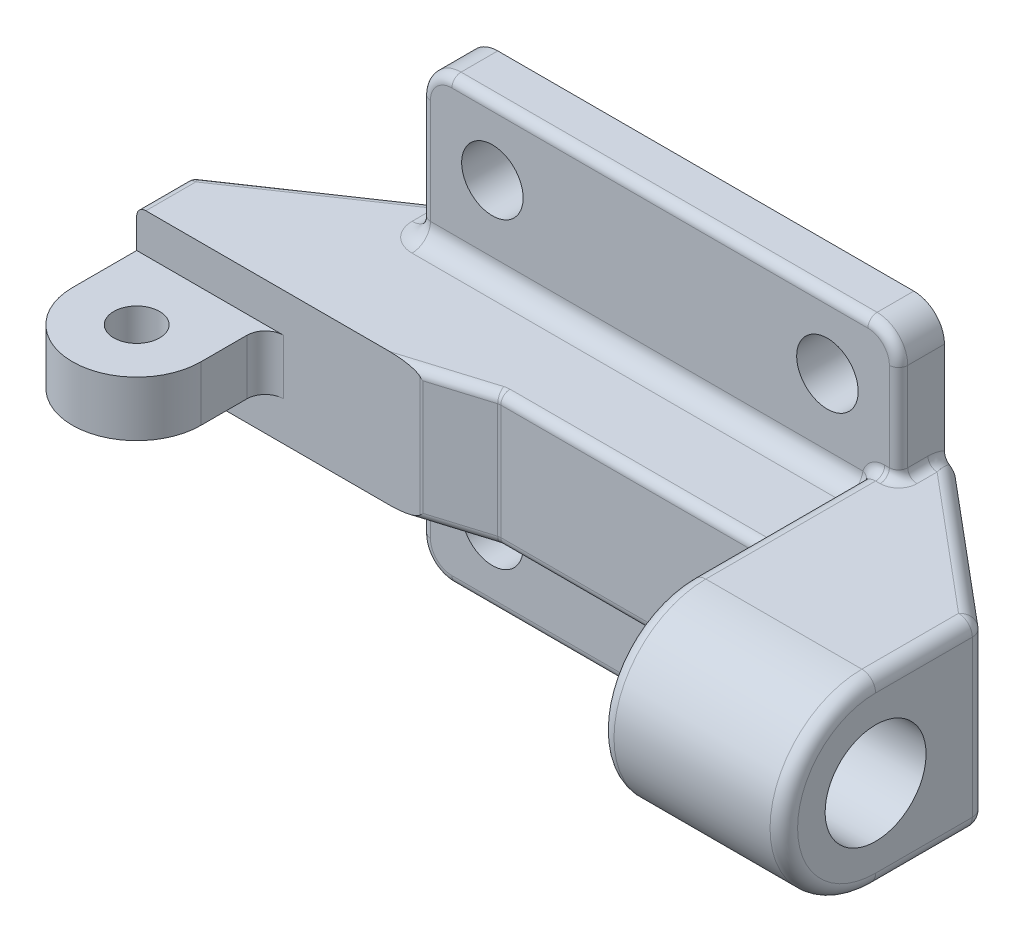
ISO-10303-21;
HEADER;
FILE_DESCRIPTION(('STEP AP214'),'2;1');
FILE_NAME('part.step','',(''),(''),'','','');
FILE_SCHEMA(('AUTOMOTIVE_DESIGN { 1 0 10303 214 1 1 1 1 }'));
ENDSEC;
DATA;
#1=APPLICATION_CONTEXT('core data for automotive mechanical design processes');
#2=APPLICATION_PROTOCOL_DEFINITION('international standard','automotive_design',2000,#1);
#3=PRODUCT_CONTEXT('',#1,'mechanical');
#4=PRODUCT('Part','Part','',(#3));
#5=PRODUCT_RELATED_PRODUCT_CATEGORY('part','',(#4));
#6=PRODUCT_DEFINITION_FORMATION('','',#4);
#7=PRODUCT_DEFINITION_CONTEXT('part definition',#1,'design');
#8=PRODUCT_DEFINITION('design','',#6,#7);
#9=PRODUCT_DEFINITION_SHAPE('','',#8);
#10=(LENGTH_UNIT() NAMED_UNIT(*) SI_UNIT(.MILLI.,.METRE.));
#11=(NAMED_UNIT(*) PLANE_ANGLE_UNIT() SI_UNIT($,.RADIAN.));
#12=(NAMED_UNIT(*) SI_UNIT($,.STERADIAN.) SOLID_ANGLE_UNIT());
#13=UNCERTAINTY_MEASURE_WITH_UNIT(LENGTH_MEASURE(1.E-05),#10,'distance_accuracy_value','');
#14=(GEOMETRIC_REPRESENTATION_CONTEXT(3) GLOBAL_UNCERTAINTY_ASSIGNED_CONTEXT((#13)) GLOBAL_UNIT_ASSIGNED_CONTEXT((#10,
#11,#12)) REPRESENTATION_CONTEXT('',''));
#15=CARTESIAN_POINT('',(0.,0.,0.));
#16=DIRECTION('',(0.,0.,1.));
#17=DIRECTION('',(1.,0.,0.));
#18=AXIS2_PLACEMENT_3D('',#15,#16,#17);
#19=CARTESIAN_POINT('',(-19.25,-6.55,24.5));
#20=DIRECTION('',(0.,1.,0.));
#21=DIRECTION('',(-1.,0.,0.));
#22=AXIS2_PLACEMENT_3D('',#19,#20,#21);
#23=CYLINDRICAL_SURFACE('',#22,2.5);
#24=CARTESIAN_POINT('',(-19.25,19.5,24.5));
#25=DIRECTION('',(0.,1.,0.));
#26=DIRECTION('',(-1.,0.,0.));
#27=AXIS2_PLACEMENT_3D('',#24,#25,#26);
#28=CIRCLE('',#27,2.5);
#29=CARTESIAN_POINT('',(-21.75,19.5,24.5));
#30=VERTEX_POINT('',#29);
#31=EDGE_CURVE('E449',#30,#30,#28,.T.);
#32=ORIENTED_EDGE('',*,*,#31,.T.);
#33=EDGE_LOOP('',(#32));
#34=FACE_BOUND('',#33,.T.);
#35=CARTESIAN_POINT('',(-19.25,13.5,24.5));
#36=DIRECTION('',(0.,-1.,0.));
#37=DIRECTION('',(0.,0.,-1.));
#38=AXIS2_PLACEMENT_3D('',#35,#36,#37);
#39=CIRCLE('',#38,2.5);
#40=CARTESIAN_POINT('',(-19.25,13.5,22.));
#41=VERTEX_POINT('',#40);
#42=EDGE_CURVE('E446',#41,#41,#39,.F.);
#43=ORIENTED_EDGE('',*,*,#42,.F.);
#44=EDGE_LOOP('',(#43));
#45=FACE_BOUND('',#44,.T.);
#46=ADVANCED_FACE('F16',(#34,#45),#23,.F.);
#47=CARTESIAN_POINT('',(-12.25,9.25,31.5));
#48=DIRECTION('',(1.,0.,0.));
#49=DIRECTION('',(0.,0.,-1.));
#50=AXIS2_PLACEMENT_3D('',#47,#48,#49);
#51=PLANE('',#50);
#52=DIRECTION('',(0.,1.,0.));
#53=VECTOR('',#52,1.);
#54=CARTESIAN_POINT('',(-12.25,9.25,24.5));
#55=LINE('',#54,#53);
#56=CARTESIAN_POINT('',(-12.25,13.5,24.5));
#57=VERTEX_POINT('',#56);
#58=CARTESIAN_POINT('',(-12.25,19.5,24.5));
#59=VERTEX_POINT('',#58);
#60=EDGE_CURVE('E1263',#57,#59,#55,.T.);
#61=ORIENTED_EDGE('',*,*,#60,.F.);
#62=DIRECTION('',(0.,0.,1.));
#63=VECTOR('',#62,1.);
#64=CARTESIAN_POINT('',(-12.25,13.5,19.5));
#65=LINE('',#64,#63);
#66=CARTESIAN_POINT('',(-12.25,13.5,19.5));
#67=VERTEX_POINT('',#66);
#68=EDGE_CURVE('E444',#67,#57,#65,.T.);
#69=ORIENTED_EDGE('',*,*,#68,.F.);
#70=DIRECTION('',(0.,-1.,0.));
#71=VECTOR('',#70,1.);
#72=CARTESIAN_POINT('',(-12.25,40.5,19.5));
#73=LINE('',#72,#71);
#74=CARTESIAN_POINT('',(-12.25,19.5,19.5));
#75=VERTEX_POINT('',#74);
#76=EDGE_CURVE('E1266',#67,#75,#73,.F.);
#77=ORIENTED_EDGE('',*,*,#76,.T.);
#78=DIRECTION('',(0.,0.,-1.));
#79=VECTOR('',#78,1.);
#80=CARTESIAN_POINT('',(-12.25,19.5,24.5));
#81=LINE('',#80,#79);
#82=EDGE_CURVE('E455',#59,#75,#81,.T.);
#83=ORIENTED_EDGE('',*,*,#82,.F.);
#84=EDGE_LOOP('',(#61,#69,#77,#83));
#85=FACE_BOUND('',#84,.T.);
#86=ADVANCED_FACE('F1239',(#85),#51,.T.);
#87=CARTESIAN_POINT('',(-10.25,40.5,19.5));
#88=DIRECTION('',(0.,-1.,0.));
#89=DIRECTION('',(1.,0.,0.));
#90=AXIS2_PLACEMENT_3D('',#87,#88,#89);
#91=CYLINDRICAL_SURFACE('',#90,2.);
#92=CARTESIAN_POINT('',(-10.25,13.5,19.5));
#93=DIRECTION('',(0.,1.,0.));
#94=DIRECTION('',(0.,0.,-1.));
#95=AXIS2_PLACEMENT_3D('',#92,#93,#94);
#96=CIRCLE('',#95,2.);
#97=CARTESIAN_POINT('',(-10.25,13.5,17.5));
#98=VERTEX_POINT('',#97);
#99=EDGE_CURVE('E436',#98,#67,#96,.T.);
#100=ORIENTED_EDGE('',*,*,#99,.F.);
#101=DIRECTION('',(0.,-1.,0.));
#102=VECTOR('',#101,1.);
#103=CARTESIAN_POINT('',(-10.25,40.5,17.5));
#104=LINE('',#103,#102);
#105=CARTESIAN_POINT('',(-10.25,19.5,17.5));
#106=VERTEX_POINT('',#105);
#107=EDGE_CURVE('E434',#98,#106,#104,.F.);
#108=ORIENTED_EDGE('',*,*,#107,.T.);
#109=CARTESIAN_POINT('',(-10.25,19.5,19.5));
#110=DIRECTION('',(0.,-1.,0.));
#111=DIRECTION('',(-1.,0.,0.));
#112=AXIS2_PLACEMENT_3D('',#109,#110,#111);
#113=CIRCLE('',#112,2.);
#114=EDGE_CURVE('E458',#75,#106,#113,.T.);
#115=ORIENTED_EDGE('',*,*,#114,.F.);
#116=ORIENTED_EDGE('',*,*,#76,.F.);
#117=EDGE_LOOP('',(#100,#108,#115,#116));
#118=FACE_BOUND('',#117,.T.);
#119=ADVANCED_FACE('F1801',(#118),#91,.F.);
#120=CARTESIAN_POINT('',(-19.25,9.25,24.5));
#121=DIRECTION('',(0.,1.,0.));
#122=DIRECTION('',(-1.,0.,0.));
#123=AXIS2_PLACEMENT_3D('',#120,#121,#122);
#124=CYLINDRICAL_SURFACE('',#123,7.);
#125=DIRECTION('',(0.,1.,0.));
#126=VECTOR('',#125,1.);
#127=CARTESIAN_POINT('',(-26.25,9.25,24.5));
#128=LINE('',#127,#126);
#129=CARTESIAN_POINT('',(-26.25,13.5,24.5));
#130=VERTEX_POINT('',#129);
#131=CARTESIAN_POINT('',(-26.25,19.5,24.5));
#132=VERTEX_POINT('',#131);
#133=EDGE_CURVE('E1590',#130,#132,#128,.T.);
#134=ORIENTED_EDGE('',*,*,#133,.F.);
#135=CARTESIAN_POINT('',(-19.25,13.5,24.5));
#136=DIRECTION('',(0.,-1.,0.));
#137=DIRECTION('',(0.,0.,-1.));
#138=AXIS2_PLACEMENT_3D('',#135,#136,#137);
#139=CIRCLE('',#138,7.);
#140=EDGE_CURVE('E33',#57,#130,#139,.T.);
#141=ORIENTED_EDGE('',*,*,#140,.F.);
#142=ORIENTED_EDGE('',*,*,#60,.T.);
#143=CARTESIAN_POINT('',(-19.25,19.5,24.5));
#144=DIRECTION('',(0.,1.,0.));
#145=DIRECTION('',(-1.,0.,0.));
#146=AXIS2_PLACEMENT_3D('',#143,#144,#145);
#147=CIRCLE('',#146,7.);
#148=EDGE_CURVE('E452',#132,#59,#147,.T.);
#149=ORIENTED_EDGE('',*,*,#148,.F.);
#150=EDGE_LOOP('',(#134,#141,#142,#149));
#151=FACE_BOUND('',#150,.T.);
#152=ADVANCED_FACE('F2031',(#151),#124,.T.);
#153=CARTESIAN_POINT('',(11.4190742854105,9.25,16.5));
#154=DIRECTION('',(0.,-1.,0.));
#155=DIRECTION('',(1.,0.,0.));
#156=AXIS2_PLACEMENT_3D('',#153,#154,#155);
#157=CYLINDRICAL_SURFACE('',#156,1.);
#158=DIRECTION('',(0.,1.,0.));
#159=VECTOR('',#158,1.);
#160=CARTESIAN_POINT('',(11.4190742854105,40.5,15.5));
#161=LINE('',#160,#159);
#162=CARTESIAN_POINT('',(11.4190742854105,22.75,15.5));
#163=VERTEX_POINT('',#162);
#164=CARTESIAN_POINT('',(11.4190742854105,10.25,15.5));
#165=VERTEX_POINT('',#164);
#166=EDGE_CURVE('E2701',#163,#165,#161,.F.);
#167=ORIENTED_EDGE('',*,*,#166,.F.);
#168=CARTESIAN_POINT('',(11.4190742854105,22.75,16.5));
#169=DIRECTION('',(0.,1.,0.));
#170=DIRECTION('',(-1.,0.,0.));
#171=AXIS2_PLACEMENT_3D('',#168,#169,#170);
#172=CIRCLE('',#171,1.);
#173=CARTESIAN_POINT('',(11.1257770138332,22.75,15.5439787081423));
#174=VERTEX_POINT('',#173);
#175=EDGE_CURVE('E1248',#174,#163,#172,.F.);
#176=ORIENTED_EDGE('',*,*,#175,.F.);
#177=DIRECTION('',(0.,1.,0.));
#178=VECTOR('',#177,1.);
#179=CARTESIAN_POINT('',(11.1257770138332,9.25,15.5439787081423));
#180=LINE('',#179,#178);
#181=CARTESIAN_POINT('',(11.1257770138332,10.25,15.5439787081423));
#182=VERTEX_POINT('',#181);
#183=EDGE_CURVE('E1406',#182,#174,#180,.T.);
#184=ORIENTED_EDGE('',*,*,#183,.F.);
#185=CARTESIAN_POINT('',(11.4190742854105,10.25,16.5));
#186=DIRECTION('',(0.,-1.,0.));
#187=DIRECTION('',(1.,0.,0.));
#188=AXIS2_PLACEMENT_3D('',#185,#186,#187);
#189=CIRCLE('',#188,1.);
#190=EDGE_CURVE('E463',#165,#182,#189,.F.);
#191=ORIENTED_EDGE('',*,*,#190,.F.);
#192=EDGE_LOOP('',(#167,#176,#184,#191));
#193=FACE_BOUND('',#192,.T.);
#194=ADVANCED_FACE('F18',(#193),#157,.F.);
#195=CARTESIAN_POINT('',(40.25,22.75,14.5));
#196=DIRECTION('',(-1.,0.,0.));
#197=DIRECTION('',(0.,-1.,0.));
#198=AXIS2_PLACEMENT_3D('',#195,#196,#197);
#199=TOROIDAL_SURFACE('',#198,2.,1.);
#200=CARTESIAN_POINT('',(40.25,22.75,14.5));
#201=DIRECTION('',(-1.,0.,0.));
#202=DIRECTION('',(0.,-1.,0.));
#203=AXIS2_PLACEMENT_3D('',#200,#201,#202);
#204=CIRCLE('',#203,1.);
#205=CARTESIAN_POINT('',(40.25,22.75,15.5));
#206=VERTEX_POINT('',#205);
#207=CARTESIAN_POINT('',(40.25,23.75,14.5));
#208=VERTEX_POINT('',#207);
#209=EDGE_CURVE('E1210',#206,#208,#204,.T.);
#210=ORIENTED_EDGE('',*,*,#209,.F.);
#211=CARTESIAN_POINT('',(40.25,22.75,16.5));
#212=DIRECTION('',(0.,-1.,0.));
#213=DIRECTION('',(0.,0.,1.));
#214=AXIS2_PLACEMENT_3D('',#211,#212,#213);
#215=CIRCLE('',#214,1.);
#216=CARTESIAN_POINT('',(41.25,22.75,16.5));
#217=VERTEX_POINT('',#216);
#218=EDGE_CURVE('E1823',#206,#217,#215,.T.);
#219=ORIENTED_EDGE('',*,*,#218,.T.);
#220=CARTESIAN_POINT('',(41.25,22.75,14.5));
#221=DIRECTION('',(-1.,0.,0.));
#222=DIRECTION('',(0.,0.,1.));
#223=AXIS2_PLACEMENT_3D('',#220,#221,#222);
#224=CIRCLE('',#223,2.);
#225=CARTESIAN_POINT('',(41.25,24.75,14.5));
#226=VERTEX_POINT('',#225);
#227=EDGE_CURVE('E1349',#226,#217,#224,.F.);
#228=ORIENTED_EDGE('',*,*,#227,.F.);
#229=CARTESIAN_POINT('',(40.25,24.75,14.5));
#230=DIRECTION('',(0.,0.,-1.));
#231=DIRECTION('',(0.,1.,0.));
#232=AXIS2_PLACEMENT_3D('',#229,#230,#231);
#233=CIRCLE('',#232,1.);
#234=EDGE_CURVE('E1212',#208,#226,#233,.F.);
#235=ORIENTED_EDGE('',*,*,#234,.F.);
#236=EDGE_LOOP('',(#210,#219,#228,#235));
#237=FACE_BOUND('',#236,.T.);
#238=ADVANCED_FACE('F1832',(#237),#199,.F.);
#239=CARTESIAN_POINT('',(40.25,40.5,16.5));
#240=DIRECTION('',(0.,-1.,0.));
#241=DIRECTION('',(0.,0.,1.));
#242=AXIS2_PLACEMENT_3D('',#239,#240,#241);
#243=CYLINDRICAL_SURFACE('',#242,1.);
#244=DIRECTION('',(0.,1.,0.));
#245=VECTOR('',#244,1.);
#246=CARTESIAN_POINT('',(40.25,40.5,15.5));
#247=LINE('',#246,#245);
#248=CARTESIAN_POINT('',(40.25,10.25,15.5));
#249=VERTEX_POINT('',#248);
#250=EDGE_CURVE('E1411',#249,#206,#247,.T.);
#251=ORIENTED_EDGE('',*,*,#250,.F.);
#252=CARTESIAN_POINT('',(40.25,10.25,16.5));
#253=DIRECTION('',(0.,1.,0.));
#254=DIRECTION('',(0.,0.,1.));
#255=AXIS2_PLACEMENT_3D('',#252,#253,#254);
#256=CIRCLE('',#255,1.);
#257=CARTESIAN_POINT('',(41.25,10.25,16.5));
#258=VERTEX_POINT('',#257);
#259=EDGE_CURVE('E1215',#249,#258,#256,.F.);
#260=ORIENTED_EDGE('',*,*,#259,.T.);
#261=DIRECTION('',(0.,-1.,0.));
#262=VECTOR('',#261,1.);
#263=CARTESIAN_POINT('',(41.25,16.5,16.5));
#264=LINE('',#263,#262);
#265=EDGE_CURVE('E1366',#217,#258,#264,.T.);
#266=ORIENTED_EDGE('',*,*,#265,.F.);
#267=ORIENTED_EDGE('',*,*,#218,.F.);
#268=EDGE_LOOP('',(#251,#260,#266,#267));
#269=FACE_BOUND('',#268,.T.);
#270=ADVANCED_FACE('F1808',(#269),#243,.F.);
#271=CARTESIAN_POINT('',(40.25,10.25,14.5));
#272=DIRECTION('',(-1.,0.,0.));
#273=DIRECTION('',(0.,-1.,0.));
#274=AXIS2_PLACEMENT_3D('',#271,#272,#273);
#275=TOROIDAL_SURFACE('',#274,2.,1.);
#276=CARTESIAN_POINT('',(40.25,10.25,14.5));
#277=DIRECTION('',(-1.,0.,0.));
#278=DIRECTION('',(0.,-1.,0.));
#279=AXIS2_PLACEMENT_3D('',#276,#277,#278);
#280=CIRCLE('',#279,1.);
#281=CARTESIAN_POINT('',(40.25,9.25,14.5));
#282=VERTEX_POINT('',#281);
#283=EDGE_CURVE('E1213',#282,#249,#280,.T.);
#284=ORIENTED_EDGE('',*,*,#283,.F.);
#285=CARTESIAN_POINT('',(40.25,8.25,14.5));
#286=DIRECTION('',(0.,0.,1.));
#287=DIRECTION('',(0.,-1.,0.));
#288=AXIS2_PLACEMENT_3D('',#285,#286,#287);
#289=CIRCLE('',#288,1.);
#290=CARTESIAN_POINT('',(41.25,8.25,14.5));
#291=VERTEX_POINT('',#290);
#292=EDGE_CURVE('E1216',#291,#282,#289,.T.);
#293=ORIENTED_EDGE('',*,*,#292,.F.);
#294=CARTESIAN_POINT('',(41.25,10.25,14.5));
#295=DIRECTION('',(-1.,0.,0.));
#296=DIRECTION('',(0.,-1.,0.));
#297=AXIS2_PLACEMENT_3D('',#294,#295,#296);
#298=CIRCLE('',#297,2.);
#299=EDGE_CURVE('E1361',#258,#291,#298,.F.);
#300=ORIENTED_EDGE('',*,*,#299,.F.);
#301=ORIENTED_EDGE('',*,*,#259,.F.);
#302=EDGE_LOOP('',(#284,#293,#300,#301));
#303=FACE_BOUND('',#302,.T.);
#304=ADVANCED_FACE('F1234',(#303),#275,.F.);
#305=CARTESIAN_POINT('',(11.4190742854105,22.75,16.5));
#306=DIRECTION('',(0.,1.,0.));
#307=DIRECTION('',(-1.,0.,0.));
#308=AXIS2_PLACEMENT_3D('',#305,#306,#307);
#309=TOROIDAL_SURFACE('',#308,2.,1.);
#310=CARTESIAN_POINT('',(10.8324797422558,22.75,14.5879574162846));
#311=DIRECTION('',(0.956021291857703,0.,-0.293297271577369));
#312=DIRECTION('',(-0.293297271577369,0.,-0.956021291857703));
#313=AXIS2_PLACEMENT_3D('',#310,#311,#312);
#314=CIRCLE('',#313,1.);
#315=CARTESIAN_POINT('',(10.8324797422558,23.75,14.5879574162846));
#316=VERTEX_POINT('',#315);
#317=EDGE_CURVE('E1567',#174,#316,#314,.F.);
#318=ORIENTED_EDGE('',*,*,#317,.F.);
#319=ORIENTED_EDGE('',*,*,#175,.T.);
#320=CARTESIAN_POINT('',(11.4190742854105,22.75,14.5));
#321=DIRECTION('',(1.,0.,0.));
#322=DIRECTION('',(0.,1.,0.));
#323=AXIS2_PLACEMENT_3D('',#320,#321,#322);
#324=CIRCLE('',#323,1.);
#325=CARTESIAN_POINT('',(11.4190742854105,23.75,14.5));
#326=VERTEX_POINT('',#325);
#327=EDGE_CURVE('E1257',#326,#163,#324,.T.);
#328=ORIENTED_EDGE('',*,*,#327,.F.);
#329=CARTESIAN_POINT('',(11.4190742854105,23.75,16.5));
#330=DIRECTION('',(0.,1.,0.));
#331=DIRECTION('',(0.,0.,-1.));
#332=AXIS2_PLACEMENT_3D('',#329,#330,#331);
#333=CIRCLE('',#332,2.);
#334=EDGE_CURVE('E1252',#326,#316,#333,.T.);
#335=ORIENTED_EDGE('',*,*,#334,.T.);
#336=EDGE_LOOP('',(#318,#319,#328,#335));
#337=FACE_BOUND('',#336,.T.);
#338=ADVANCED_FACE('F1222',(#337),#309,.T.);
#339=CARTESIAN_POINT('',(42.75,16.5,24.5));
#340=DIRECTION('',(-1.,0.,0.));
#341=DIRECTION('',(0.,-1.,0.));
#342=AXIS2_PLACEMENT_3D('',#339,#340,#341);
#343=TOROIDAL_SURFACE('',#342,8.5,1.5);
#344=CARTESIAN_POINT('',(42.75,8.,24.5));
#345=DIRECTION('',(0.,0.,-1.));
#346=DIRECTION('',(0.,-1.,0.));
#347=AXIS2_PLACEMENT_3D('',#344,#345,#346);
#348=CIRCLE('',#347,1.5);
#349=CARTESIAN_POINT('',(42.75,6.5,24.5));
#350=VERTEX_POINT('',#349);
#351=CARTESIAN_POINT('',(41.25,8.,24.5));
#352=VERTEX_POINT('',#351);
#353=EDGE_CURVE('E1613',#350,#352,#348,.T.);
#354=ORIENTED_EDGE('',*,*,#353,.F.);
#355=CARTESIAN_POINT('',(42.75,16.5,24.5));
#356=DIRECTION('',(1.,0.,0.));
#357=DIRECTION('',(0.,1.,0.));
#358=AXIS2_PLACEMENT_3D('',#355,#356,#357);
#359=CIRCLE('',#358,10.);
#360=CARTESIAN_POINT('',(42.75,26.5,24.5));
#361=VERTEX_POINT('',#360);
#362=EDGE_CURVE('E1624',#361,#350,#359,.T.);
#363=ORIENTED_EDGE('',*,*,#362,.F.);
#364=CARTESIAN_POINT('',(42.75,25.,24.5));
#365=DIRECTION('',(0.,0.,1.));
#366=DIRECTION('',(0.,1.,0.));
#367=AXIS2_PLACEMENT_3D('',#364,#365,#366);
#368=CIRCLE('',#367,1.5);
#369=CARTESIAN_POINT('',(41.25,25.,24.5));
#370=VERTEX_POINT('',#369);
#371=EDGE_CURVE('E1666',#370,#361,#368,.F.);
#372=ORIENTED_EDGE('',*,*,#371,.F.);
#373=CARTESIAN_POINT('',(41.25,16.5,24.5));
#374=DIRECTION('',(1.,0.,0.));
#375=DIRECTION('',(0.,1.,0.));
#376=AXIS2_PLACEMENT_3D('',#373,#374,#375);
#377=CIRCLE('',#376,8.50000000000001);
#378=EDGE_CURVE('E1324',#352,#370,#377,.F.);
#379=ORIENTED_EDGE('',*,*,#378,.F.);
#380=EDGE_LOOP('',(#354,#363,#372,#379));
#381=FACE_BOUND('',#380,.T.);
#382=ADVANCED_FACE('F1233',(#381),#343,.T.);
#383=CARTESIAN_POINT('',(41.25,5.5,6.));
#384=DIRECTION('',(-1.,0.,0.));
#385=DIRECTION('',(0.,-1.,0.));
#386=AXIS2_PLACEMENT_3D('',#383,#384,#385);
#387=CYLINDRICAL_SURFACE('',#386,1.);
#388=DIRECTION('',(-1.,0.,0.));
#389=VECTOR('',#388,1.);
#390=CARTESIAN_POINT('',(41.25,5.5,5.));
#391=LINE('',#390,#389);
#392=CARTESIAN_POINT('',(43.25,5.5,5.));
#393=VERTEX_POINT('',#392);
#394=CARTESIAN_POINT('',(42.75,5.5,5.));
#395=VERTEX_POINT('',#394);
#396=EDGE_CURVE('E1885',#393,#395,#391,.T.);
#397=ORIENTED_EDGE('',*,*,#396,.F.);
#398=CARTESIAN_POINT('',(43.25,5.5,6.));
#399=DIRECTION('',(1.,0.,0.));
#400=DIRECTION('',(0.,0.,1.));
#401=AXIS2_PLACEMENT_3D('',#398,#399,#400);
#402=CIRCLE('',#401,1.);
#403=CARTESIAN_POINT('',(43.25,6.5,6.));
#404=VERTEX_POINT('',#403);
#405=EDGE_CURVE('E1891',#393,#404,#402,.T.);
#406=ORIENTED_EDGE('',*,*,#405,.T.);
#407=DIRECTION('',(-1.,0.,0.));
#408=VECTOR('',#407,1.);
#409=CARTESIAN_POINT('',(41.25,6.5,6.));
#410=LINE('',#409,#408);
#411=CARTESIAN_POINT('',(42.75,6.5,6.));
#412=VERTEX_POINT('',#411);
#413=EDGE_CURVE('E1251',#412,#404,#410,.F.);
#414=ORIENTED_EDGE('',*,*,#413,.F.);
#415=CARTESIAN_POINT('',(42.75,5.5,6.));
#416=DIRECTION('',(-1.,0.,0.));
#417=DIRECTION('',(0.,-1.,0.));
#418=AXIS2_PLACEMENT_3D('',#415,#416,#417);
#419=CIRCLE('',#418,1.);
#420=EDGE_CURVE('E1890',#412,#395,#419,.T.);
#421=ORIENTED_EDGE('',*,*,#420,.T.);
#422=EDGE_LOOP('',(#397,#406,#414,#421));
#423=FACE_BOUND('',#422,.T.);
#424=ADVANCED_FACE('F1863',(#423),#387,.F.);
#425=CARTESIAN_POINT('',(40.25,24.75,7.));
#426=DIRECTION('',(0.,0.,1.));
#427=DIRECTION('',(0.,-1.,0.));
#428=AXIS2_PLACEMENT_3D('',#425,#426,#427);
#429=CIRCLE('',#428,1.);
#430=TRIMMED_CURVE('',#429,(PARAMETER_VALUE(-3.1415926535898)),
(PARAMETER_VALUE(3.1415926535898)),.T.,.PARAMETER.);
#431=CARTESIAN_POINT('',(40.25,25.75,7.));
#432=DIRECTION('',(-1.,0.,0.));
#433=AXIS1_PLACEMENT('',#431,#432);
#434=SURFACE_OF_REVOLUTION('',#430,#433);
#435=CARTESIAN_POINT('',(40.25,25.75,7.));
#436=DIRECTION('',(1.,0.,0.));
#437=DIRECTION('',(0.,1.,0.));
#438=AXIS2_PLACEMENT_3D('',#435,#436,#437);
#439=CIRCLE('',#438,2.);
#440=CARTESIAN_POINT('',(40.25,24.25,5.67712434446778));
#441=VERTEX_POINT('',#440);
#442=CARTESIAN_POINT('',(40.25,23.75,7.));
#443=VERTEX_POINT('',#442);
#444=EDGE_CURVE('E2721',#441,#443,#439,.F.);
#445=ORIENTED_EDGE('',*,*,#444,.T.);
#446=CARTESIAN_POINT('',(40.25,24.75,7.));
#447=DIRECTION('',(0.,0.,1.));
#448=DIRECTION('',(0.,1.,0.));
#449=AXIS2_PLACEMENT_3D('',#446,#447,#448);
#450=CIRCLE('',#449,1.);
#451=CARTESIAN_POINT('',(41.25,24.75,7.));
#452=VERTEX_POINT('',#451);
#453=EDGE_CURVE('E1256',#443,#452,#450,.T.);
#454=ORIENTED_EDGE('',*,*,#453,.T.);
#455=CARTESIAN_POINT('',(41.25,25.75,7.));
#456=DIRECTION('',(1.,0.,0.));
#457=DIRECTION('',(0.,-1.,0.));
#458=AXIS2_PLACEMENT_3D('',#455,#456,#457);
#459=CIRCLE('',#458,0.999999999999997);
#460=CARTESIAN_POINT('',(41.25,25.,6.33856217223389));
#461=VERTEX_POINT('',#460);
#462=EDGE_CURVE('E1335',#461,#452,#459,.F.);
#463=ORIENTED_EDGE('',*,*,#462,.F.);
#464=CARTESIAN_POINT('',(40.25,25.,6.33856217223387));
#465=DIRECTION('',(0.,0.661437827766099,-0.750000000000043));
#466=DIRECTION('',(0.,-0.750000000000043,-0.661437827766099));
#467=AXIS2_PLACEMENT_3D('',#464,#465,#466);
#468=CIRCLE('',#467,1.);
#469=EDGE_CURVE('E1877',#461,#441,#468,.T.);
#470=ORIENTED_EDGE('',*,*,#469,.T.);
#471=EDGE_LOOP('',(#445,#454,#463,#470));
#472=FACE_BOUND('',#471,.T.);
#473=ADVANCED_FACE('F1853',(#472),#434,.T.);
#474=CARTESIAN_POINT('',(41.3190911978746,25.45,6.));
#475=CARTESIAN_POINT('',(41.3190911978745,25.45,4.99999999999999));
#476=CARTESIAN_POINT('',(40.3651519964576,25.75,5.));
#477=CARTESIAN_POINT('',(41.3060990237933,25.4086875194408,6.00000000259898));
#478=CARTESIAN_POINT('',(41.28673086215,25.3471006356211,5.02044357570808));
#479=CARTESIAN_POINT('',(40.3434982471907,25.6122908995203,5.));
#480=CARTESIAN_POINT('',(41.2951229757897,25.367544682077,6.00704155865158));
#481=CARTESIAN_POINT('',(41.2618988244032,25.2433857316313,5.04818940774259));
#482=CARTESIAN_POINT('',(40.3252049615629,25.4751489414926,5.01408312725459));
#483=CARTESIAN_POINT('',(41.2768712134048,25.2857408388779,6.03568428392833));
#484=CARTESIAN_POINT('',(41.2266035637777,25.0359099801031,5.12081487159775));
#485=CARTESIAN_POINT('',(40.2947853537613,25.2024694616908,5.07136855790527));
#486=CARTESIAN_POINT('',(41.2695742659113,25.2446864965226,6.05771056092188));
#487=CARTESIAN_POINT('',(41.215908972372,24.929947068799,5.1666499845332));
#488=CARTESIAN_POINT('',(40.2826237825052,25.0656216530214,5.11542112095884));
#489=CARTESIAN_POINT('',(41.2534555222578,25.1283821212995,6.14403076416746));
#490=CARTESIAN_POINT('',(41.2035941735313,24.62330757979,5.3308115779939));
#491=CARTESIAN_POINT('',(40.2557591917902,24.6779404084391,5.28806153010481));
#492=CARTESIAN_POINT('',(41.25,25.0573297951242,6.23021906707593));
#493=CARTESIAN_POINT('',(41.2217197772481,24.4220376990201,5.48205208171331));
#494=CARTESIAN_POINT('',(40.2499999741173,24.4409929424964,5.4605587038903));
#495=CARTESIAN_POINT('',(41.25,25.,6.33856217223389));
#496=CARTESIAN_POINT('',(41.25,24.2499999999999,5.67712434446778));
#497=CARTESIAN_POINT('',(40.25,24.25,5.67712434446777));
#498=(BOUNDED_SURFACE() B_SPLINE_SURFACE(3,2,((#474,#475,#476),(#477,#478,#479),(#480,#481,
#482),(#483,#484,#485),(#486,#487,#488),(#489,#490,#491),(#492,#493,#494),(#495,#496,#497)),
.UNSPECIFIED.,.F.,.F.,.F.) B_SPLINE_SURFACE_WITH_KNOTS((4,2,2,4),(3,3),(0.,0.00021358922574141,
0.000427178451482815,0.000854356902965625),(0.,1.),
.UNSPECIFIED.) GEOMETRIC_REPRESENTATION_ITEM() RATIONAL_B_SPLINE_SURFACE(((1.,0.707106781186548,
1.),(1.,0.714406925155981,1.),(1.,0.71956675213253,1.),(1.,0.725957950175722,1.),(1.,
0.727148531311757,1.),(1.,0.725451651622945,1.),(1.,0.717323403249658,1.),(1.,0.707106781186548,1.))) REPRESENTATION_ITEM('') SURFACE());
#499=CARTESIAN_POINT('',(40.3651519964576,25.75,5.));
#500=CARTESIAN_POINT('',(40.3434982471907,25.6122908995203,5.));
#501=CARTESIAN_POINT('',(40.3252049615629,25.4751489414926,5.01408312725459));
#502=CARTESIAN_POINT('',(40.2947853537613,25.2024694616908,5.07136855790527));
#503=CARTESIAN_POINT('',(40.2826237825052,25.0656216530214,5.11542112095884));
#504=CARTESIAN_POINT('',(40.2557591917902,24.6779404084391,5.28806153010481));
#505=CARTESIAN_POINT('',(40.2499999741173,24.4409929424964,5.4605587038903));
#506=CARTESIAN_POINT('',(40.25,24.25,5.67712434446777));
#507=(BOUNDED_CURVE() B_SPLINE_CURVE(3,(#499,#500,#501,#502,#503,#504,#505,#506),.UNSPECIFIED.,
.F.,.F.) B_SPLINE_CURVE_WITH_KNOTS((4,2,2,4),(0.,0.00021358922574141,0.000427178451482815,
0.000854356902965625),
.UNSPECIFIED.) CURVE() GEOMETRIC_REPRESENTATION_ITEM() RATIONAL_B_SPLINE_CURVE((1.,1.,1.,1.,1.,
1.,1.,1.)) REPRESENTATION_ITEM(''));
#508=CARTESIAN_POINT('',(40.3651519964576,25.75,5.));
#509=VERTEX_POINT('',#508);
#510=EDGE_CURVE('E1488',#509,#441,#507,.T.);
#511=CARTESIAN_POINT('',(41.25,25.,6.33856217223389));
#512=CARTESIAN_POINT('',(41.2500007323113,25.0070701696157,6.32520324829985));
#513=CARTESIAN_POINT('',(41.2500525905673,25.0144419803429,6.3120008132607));
#514=CARTESIAN_POINT('',(41.2502831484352,25.0296034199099,6.28632446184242));
#515=CARTESIAN_POINT('',(41.250458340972,25.0373761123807,6.27384049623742));
#516=CARTESIAN_POINT('',(41.2509502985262,25.0533109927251,6.24962540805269));
#517=CARTESIAN_POINT('',(41.2512629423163,25.0614560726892,6.23788298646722));
#518=CARTESIAN_POINT('',(41.2520456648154,25.0781075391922,6.21517846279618));
#519=CARTESIAN_POINT('',(41.2525109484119,25.0865967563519,6.2042036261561));
#520=CARTESIAN_POINT('',(41.2536146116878,25.1039092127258,6.18305984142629));
#521=CARTESIAN_POINT('',(41.2542475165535,25.1127153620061,6.17287669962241));
#522=CARTESIAN_POINT('',(41.2553465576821,25.1262523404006,6.15811930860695));
#523=CARTESIAN_POINT('',(41.2557326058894,25.1307657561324,6.15333836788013));
#524=CARTESIAN_POINT('',(41.2565531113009,25.1398631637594,6.14398627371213));
#525=CARTESIAN_POINT('',(41.2569867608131,25.1444450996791,6.13941305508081));
#526=CARTESIAN_POINT('',(41.2579043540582,25.1536758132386,6.13047983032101));
#527=CARTESIAN_POINT('',(41.2583874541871,25.1583225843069,6.12611766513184));
#528=CARTESIAN_POINT('',(41.2594058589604,25.167679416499,6.11760974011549));
#529=CARTESIAN_POINT('',(41.2599402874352,25.1723875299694,6.11346173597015));
#530=CARTESIAN_POINT('',(41.2610632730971,25.1818634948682,6.10538547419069));
#531=CARTESIAN_POINT('',(41.2616509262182,25.1866294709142,6.10145489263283));
#532=CARTESIAN_POINT('',(41.2628821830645,25.1962173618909,6.09381642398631));
#533=CARTESIAN_POINT('',(41.2635248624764,25.2010374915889,6.09010615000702));
#534=CARTESIAN_POINT('',(41.2648696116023,25.2107398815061,6.08290583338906));
#535=CARTESIAN_POINT('',(41.2655708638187,25.2156206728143,6.07941366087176));
#536=CARTESIAN_POINT('',(41.2670338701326,25.2254455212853,6.07264593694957));
#537=CARTESIAN_POINT('',(41.2677949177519,25.2303883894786,6.06936850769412));
#538=CARTESIAN_POINT('',(41.2693771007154,25.2403276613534,6.06303383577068));
#539=CARTESIAN_POINT('',(41.2701974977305,25.245322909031,6.05997459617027));
#540=CARTESIAN_POINT('',(41.2718980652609,25.2553574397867,6.05408024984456));
#541=CARTESIAN_POINT('',(41.2727774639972,25.2603956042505,6.05124301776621));
#542=CARTESIAN_POINT('',(41.2745956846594,25.2705063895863,6.04579650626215));
#543=CARTESIAN_POINT('',(41.2755337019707,25.2755779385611,6.04318497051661));
#544=CARTESIAN_POINT('',(41.2774688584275,25.2857459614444,6.0381938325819));
#545=CARTESIAN_POINT('',(41.2784651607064,25.2908414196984,6.03581183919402));
#546=CARTESIAN_POINT('',(41.2805164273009,25.3010475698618,6.03128327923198));
#547=CARTESIAN_POINT('',(41.2815705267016,25.3061573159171,6.02913419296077));
#548=CARTESIAN_POINT('',(41.2837374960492,25.3163828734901,6.02507671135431));
#549=CARTESIAN_POINT('',(41.2848494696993,25.3214978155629,6.02316564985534));
#550=CARTESIAN_POINT('',(41.2871321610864,25.3317314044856,6.01957991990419));
#551=CARTESIAN_POINT('',(41.2883021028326,25.3368493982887,6.01790289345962));
#552=CARTESIAN_POINT('',(41.2907007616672,25.3470928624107,6.01477630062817));
#553=CARTESIAN_POINT('',(41.2919289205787,25.3522179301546,6.01332498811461));
#554=CARTESIAN_POINT('',(41.2944449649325,25.3624754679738,6.01064993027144));
#555=CARTESIAN_POINT('',(41.2957324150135,25.3676076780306,6.0094247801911));
#556=CARTESIAN_POINT('',(41.2983674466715,25.3778789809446,6.00720038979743));
#557=CARTESIAN_POINT('',(41.2997147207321,25.3830179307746,6.00620012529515));
#558=CARTESIAN_POINT('',(41.3024699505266,25.3933023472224,6.00442429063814));
#559=CARTESIAN_POINT('',(41.3038777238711,25.398447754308,6.00364809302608));
#560=CARTESIAN_POINT('',(41.3067544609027,25.4087447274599,6.002319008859));
#561=CARTESIAN_POINT('',(41.3082233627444,25.4138962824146,6.0017659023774));
#562=CARTESIAN_POINT('',(41.3112229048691,25.4242052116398,6.00088175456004));
#563=CARTESIAN_POINT('',(41.3127535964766,25.4293625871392,6.00055090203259));
#564=CARTESIAN_POINT('',(41.3158771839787,25.4396829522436,6.00010958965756));
#565=CARTESIAN_POINT('',(41.317470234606,25.4448459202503,5.99999971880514));
#566=CARTESIAN_POINT('',(41.3190911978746,25.45,6.));
#567=B_SPLINE_CURVE_WITH_KNOTS('',3,(#511,#512,#513,#514,#515,#516,#517,#518,#519,#520,#521,
#522,#523,#524,#525,#526,#527,#528,#529,#530,#531,#532,#533,#534,#535,#536,#537,#538,#539,#540,
#541,#542,#543,#544,#545,#546,#547,#548,#549,#550,#551,#552,#553,#554,#555,#556,#557,#558,#559,
#560,#561,#562,#563,#564,#565,#566),.UNSPECIFIED.,.F.,.F.,(4,2,2,2,2,2,2,2,2,2,2,2,2,2,2,2,2,2,
2,2,2,2,2,2,2,2,2,4),(0.,0.0453436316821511,0.089447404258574,0.132310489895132,
0.173938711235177,0.214346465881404,0.234102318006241,0.253563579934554,0.272735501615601,
0.291624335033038,0.310237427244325,0.32858331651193,0.346706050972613,0.364639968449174,
0.382380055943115,0.39992158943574,0.417260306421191,0.434392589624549,0.451315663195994,
0.468027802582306,0.484557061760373,0.500951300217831,0.517240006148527,0.533452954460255,
0.549620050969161,0.565771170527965,0.581935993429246,0.598143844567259),.UNSPECIFIED.);
#568=CARTESIAN_POINT('',(41.3190911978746,25.45,6.));
#569=VERTEX_POINT('',#568);
#570=EDGE_CURVE('E1566',#569,#461,#567,.F.);
#571=CARTESIAN_POINT('',(40.3651519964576,25.75,6.));
#572=DIRECTION('',(0.300000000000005,0.953939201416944,0.));
#573=DIRECTION('',(-0.953939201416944,0.300000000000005,0.));
#574=AXIS2_PLACEMENT_3D('',#571,#572,#573);
#575=CIRCLE('',#574,1.);
#576=EDGE_CURVE('E1474',#569,#509,#575,.T.);
#577=ORIENTED_EDGE('',*,*,#510,.T.);
#578=ORIENTED_EDGE('',*,*,#469,.F.);
#579=ORIENTED_EDGE('',*,*,#570,.F.);
#580=ORIENTED_EDGE('',*,*,#576,.T.);
#581=EDGE_LOOP('',(#577,#578,#579,#580));
#582=FACE_BOUND('',#581,.T.);
#583=ADVANCED_FACE('F1862',(#582),#498,.F.);
#584=CARTESIAN_POINT('',(41.25,27.5,6.));
#585=DIRECTION('',(1.,0.,0.));
#586=DIRECTION('',(0.,1.,0.));
#587=AXIS2_PLACEMENT_3D('',#584,#585,#586);
#588=CYLINDRICAL_SURFACE('',#587,1.);
#589=DIRECTION('',(1.,0.,0.));
#590=VECTOR('',#589,1.);
#591=CARTESIAN_POINT('',(41.25,27.5,5.));
#592=LINE('',#591,#590);
#593=CARTESIAN_POINT('',(42.75,27.5,5.));
#594=VERTEX_POINT('',#593);
#595=CARTESIAN_POINT('',(43.25,27.5,5.));
#596=VERTEX_POINT('',#595);
#597=EDGE_CURVE('E2796',#594,#596,#592,.T.);
#598=ORIENTED_EDGE('',*,*,#597,.F.);
#599=CARTESIAN_POINT('',(42.75,27.5,6.));
#600=DIRECTION('',(1.,0.,0.));
#601=DIRECTION('',(0.,1.,0.));
#602=AXIS2_PLACEMENT_3D('',#599,#600,#601);
#603=CIRCLE('',#602,1.);
#604=CARTESIAN_POINT('',(42.75,26.5,6.));
#605=VERTEX_POINT('',#604);
#606=EDGE_CURVE('E1476',#594,#605,#603,.F.);
#607=ORIENTED_EDGE('',*,*,#606,.T.);
#608=DIRECTION('',(1.,0.,0.));
#609=VECTOR('',#608,1.);
#610=CARTESIAN_POINT('',(41.25,26.5,6.));
#611=LINE('',#610,#609);
#612=CARTESIAN_POINT('',(43.25,26.5,6.));
#613=VERTEX_POINT('',#612);
#614=EDGE_CURVE('E1884',#613,#605,#611,.F.);
#615=ORIENTED_EDGE('',*,*,#614,.F.);
#616=CARTESIAN_POINT('',(43.25,27.5,6.));
#617=DIRECTION('',(-1.,0.,0.));
#618=DIRECTION('',(0.,0.,1.));
#619=AXIS2_PLACEMENT_3D('',#616,#617,#618);
#620=CIRCLE('',#619,1.);
#621=EDGE_CURVE('E1663',#613,#596,#620,.F.);
#622=ORIENTED_EDGE('',*,*,#621,.T.);
#623=EDGE_LOOP('',(#598,#607,#615,#622));
#624=FACE_BOUND('',#623,.T.);
#625=ADVANCED_FACE('F2089',(#624),#588,.F.);
#626=CARTESIAN_POINT('',(4.60005415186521,40.5,16.5));
#627=DIRECTION('',(0.,-1.,0.));
#628=DIRECTION('',(1.,0.,0.));
#629=AXIS2_PLACEMENT_3D('',#626,#627,#628);
#630=CYLINDRICAL_SURFACE('',#629,1.);
#631=CARTESIAN_POINT('',(4.6000541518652,22.75,16.5));
#632=DIRECTION('',(0.676009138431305,0.707106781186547,-0.20739248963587));
#633=DIRECTION('',(0.676009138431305,-0.707106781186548,-0.20739248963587));
#634=AXIS2_PLACEMENT_3D('',#631,#632,#633);
#635=ELLIPSE('',#634,1.41421356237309,1.);
#636=CARTESIAN_POINT('',(4.60005415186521,23.0432972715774,17.5));
#637=VERTEX_POINT('',#636);
#638=CARTESIAN_POINT('',(4.89335142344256,22.75,17.4560212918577));
#639=VERTEX_POINT('',#638);
#640=EDGE_CURVE('E1568',#637,#639,#635,.T.);
#641=ORIENTED_EDGE('',*,*,#640,.F.);
#642=DIRECTION('',(0.,-1.,0.));
#643=VECTOR('',#642,1.);
#644=CARTESIAN_POINT('',(4.6000541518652,40.5,17.5));
#645=LINE('',#644,#643);
#646=CARTESIAN_POINT('',(4.60005415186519,9.95670272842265,17.5));
#647=VERTEX_POINT('',#646);
#648=EDGE_CURVE('E1424',#637,#647,#645,.T.);
#649=ORIENTED_EDGE('',*,*,#648,.T.);
#650=CARTESIAN_POINT('',(4.60005415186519,10.25,16.5));
#651=DIRECTION('',(0.676009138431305,-0.707106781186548,-0.20739248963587));
#652=DIRECTION('',(-0.676009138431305,-0.707106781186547,0.20739248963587));
#653=AXIS2_PLACEMENT_3D('',#650,#651,#652);
#654=ELLIPSE('',#653,1.4142135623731,1.);
#655=CARTESIAN_POINT('',(4.89335142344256,10.25,17.4560212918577));
#656=VERTEX_POINT('',#655);
#657=EDGE_CURVE('E20',#647,#656,#654,.F.);
#658=ORIENTED_EDGE('',*,*,#657,.T.);
#659=DIRECTION('',(0.,1.,0.));
#660=VECTOR('',#659,1.);
#661=CARTESIAN_POINT('',(4.89335142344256,9.25,17.4560212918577));
#662=LINE('',#661,#660);
#663=EDGE_CURVE('E1268',#639,#656,#662,.F.);
#664=ORIENTED_EDGE('',*,*,#663,.F.);
#665=EDGE_LOOP('',(#641,#649,#658,#664));
#666=FACE_BOUND('',#665,.T.);
#667=ADVANCED_FACE('F2084',(#666),#630,.T.);
#668=CARTESIAN_POINT('',(4.75,9.25,17.5));
#669=DIRECTION('',(0.293297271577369,0.,0.956021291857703));
#670=DIRECTION('',(0.956021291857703,0.,-0.293297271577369));
#671=AXIS2_PLACEMENT_3D('',#668,#669,#670);
#672=PLANE('',#671);
#673=ORIENTED_EDGE('',*,*,#183,.T.);
#674=DIRECTION('',(0.956021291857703,0.,-0.293297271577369));
#675=VECTOR('',#674,1.);
#676=CARTESIAN_POINT('',(41.4128769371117,22.75,6.25221518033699));
#677=LINE('',#676,#675);
#678=EDGE_CURVE('E1570',#639,#174,#677,.T.);
#679=ORIENTED_EDGE('',*,*,#678,.F.);
#680=ORIENTED_EDGE('',*,*,#663,.T.);
#681=DIRECTION('',(-0.956021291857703,0.,0.293297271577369));
#682=VECTOR('',#681,1.);
#683=CARTESIAN_POINT('',(4.75,10.25,17.5));
#684=LINE('',#683,#682);
#685=EDGE_CURVE('E1415',#182,#656,#684,.T.);
#686=ORIENTED_EDGE('',*,*,#685,.F.);
#687=EDGE_LOOP('',(#673,#679,#680,#686));
#688=FACE_BOUND('',#687,.T.);
#689=ADVANCED_FACE('F1416',(#688),#672,.T.);
#690=CARTESIAN_POINT('',(44.25,40.5,15.5));
#691=DIRECTION('',(0.,0.,1.));
#692=DIRECTION('',(0.,1.,0.));
#693=AXIS2_PLACEMENT_3D('',#690,#691,#692);
#694=PLANE('',#693);
#695=DIRECTION('',(1.,0.,0.));
#696=VECTOR('',#695,1.);
#697=CARTESIAN_POINT('',(44.25,22.75,15.5));
#698=LINE('',#697,#696);
#699=EDGE_CURVE('E1260',#163,#206,#698,.T.);
#700=ORIENTED_EDGE('',*,*,#699,.F.);
#701=ORIENTED_EDGE('',*,*,#166,.T.);
#702=DIRECTION('',(-1.,0.,0.));
#703=VECTOR('',#702,1.);
#704=CARTESIAN_POINT('',(44.25,10.25,15.5));
#705=LINE('',#704,#703);
#706=EDGE_CURVE('E1377',#249,#165,#705,.T.);
#707=ORIENTED_EDGE('',*,*,#706,.F.);
#708=ORIENTED_EDGE('',*,*,#250,.T.);
#709=EDGE_LOOP('',(#700,#701,#707,#708));
#710=FACE_BOUND('',#709,.T.);
#711=ADVANCED_FACE('F1383',(#710),#694,.T.);
#712=CARTESIAN_POINT('',(11.4190742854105,10.25,16.5));
#713=DIRECTION('',(0.,1.,0.));
#714=DIRECTION('',(-1.,0.,0.));
#715=AXIS2_PLACEMENT_3D('',#712,#713,#714);
#716=TOROIDAL_SURFACE('',#715,2.,1.);
#717=CARTESIAN_POINT('',(10.8324797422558,10.25,14.5879574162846));
#718=DIRECTION('',(-0.956021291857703,0.,0.293297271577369));
#719=DIRECTION('',(0.293297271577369,0.,0.956021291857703));
#720=AXIS2_PLACEMENT_3D('',#717,#718,#719);
#721=CIRCLE('',#720,1.);
#722=CARTESIAN_POINT('',(10.8324797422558,9.25,14.5879574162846));
#723=VERTEX_POINT('',#722);
#724=EDGE_CURVE('E1400',#723,#182,#721,.T.);
#725=ORIENTED_EDGE('',*,*,#724,.F.);
#726=CARTESIAN_POINT('',(11.4190742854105,9.25,16.5));
#727=DIRECTION('',(0.,-1.,0.));
#728=DIRECTION('',(-0.293297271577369,0.,-0.956021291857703));
#729=AXIS2_PLACEMENT_3D('',#726,#727,#728);
#730=CIRCLE('',#729,2.);
#731=CARTESIAN_POINT('',(11.4190742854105,9.25,14.5));
#732=VERTEX_POINT('',#731);
#733=EDGE_CURVE('E2801',#723,#732,#730,.T.);
#734=ORIENTED_EDGE('',*,*,#733,.T.);
#735=CARTESIAN_POINT('',(11.4190742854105,10.25,14.5));
#736=DIRECTION('',(-1.,0.,0.));
#737=DIRECTION('',(0.,-1.,0.));
#738=AXIS2_PLACEMENT_3D('',#735,#736,#737);
#739=CIRCLE('',#738,1.);
#740=EDGE_CURVE('E1308',#165,#732,#739,.F.);
#741=ORIENTED_EDGE('',*,*,#740,.F.);
#742=ORIENTED_EDGE('',*,*,#190,.T.);
#743=EDGE_LOOP('',(#725,#734,#741,#742));
#744=FACE_BOUND('',#743,.T.);
#745=ADVANCED_FACE('F1379',(#744),#716,.T.);
#746=CARTESIAN_POINT('',(41.25,16.5,24.5));
#747=DIRECTION('',(-1.,0.,0.));
#748=DIRECTION('',(0.,-1.,0.));
#749=AXIS2_PLACEMENT_3D('',#746,#747,#748);
#750=PLANE('',#749);
#751=ORIENTED_EDGE('',*,*,#265,.T.);
#752=ORIENTED_EDGE('',*,*,#299,.T.);
#753=DIRECTION('',(0.,0.,-1.));
#754=VECTOR('',#753,1.);
#755=CARTESIAN_POINT('',(41.25,8.25,24.5));
#756=LINE('',#755,#754);
#757=CARTESIAN_POINT('',(41.25,8.25,7.));
#758=VERTEX_POINT('',#757);
#759=EDGE_CURVE('E1305',#291,#758,#756,.T.);
#760=ORIENTED_EDGE('',*,*,#759,.T.);
#761=CARTESIAN_POINT('',(41.25,7.25,7.));
#762=DIRECTION('',(1.,0.,0.));
#763=DIRECTION('',(0.,0.749999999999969,-0.661437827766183));
#764=AXIS2_PLACEMENT_3D('',#761,#762,#763);
#765=CIRCLE('',#764,1.);
#766=CARTESIAN_POINT('',(41.25,8.,6.33856217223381));
#767=VERTEX_POINT('',#766);
#768=EDGE_CURVE('E1273',#758,#767,#765,.F.);
#769=ORIENTED_EDGE('',*,*,#768,.T.);
#770=DIRECTION('',(0.,0.,-1.));
#771=VECTOR('',#770,1.);
#772=CARTESIAN_POINT('',(41.25,8.,24.5));
#773=LINE('',#772,#771);
#774=EDGE_CURVE('E1618',#352,#767,#773,.T.);
#775=ORIENTED_EDGE('',*,*,#774,.F.);
#776=ORIENTED_EDGE('',*,*,#378,.T.);
#777=DIRECTION('',(0.,0.,1.));
#778=VECTOR('',#777,1.);
#779=CARTESIAN_POINT('',(41.25,25.,24.5));
#780=LINE('',#779,#778);
#781=EDGE_CURVE('E1677',#461,#370,#780,.T.);
#782=ORIENTED_EDGE('',*,*,#781,.F.);
#783=ORIENTED_EDGE('',*,*,#462,.T.);
#784=DIRECTION('',(0.,0.,1.));
#785=VECTOR('',#784,1.);
#786=CARTESIAN_POINT('',(41.25,24.75,15.5));
#787=LINE('',#786,#785);
#788=EDGE_CURVE('E1253',#452,#226,#787,.T.);
#789=ORIENTED_EDGE('',*,*,#788,.T.);
#790=ORIENTED_EDGE('',*,*,#227,.T.);
#791=EDGE_LOOP('',(#751,#752,#760,#769,#775,#776,#782,#783,#789,#790));
#792=FACE_BOUND('',#791,.T.);
#793=CARTESIAN_POINT('',(41.25,16.5,24.5));
#794=DIRECTION('',(1.,0.,0.));
#795=DIRECTION('',(0.,1.,0.));
#796=AXIS2_PLACEMENT_3D('',#793,#794,#795);
#797=CIRCLE('',#796,5.5);
#798=CARTESIAN_POINT('',(41.25,22.,24.5));
#799=VERTEX_POINT('',#798);
#800=EDGE_CURVE('E1564',#799,#799,#797,.T.);
#801=ORIENTED_EDGE('',*,*,#800,.T.);
#802=EDGE_LOOP('',(#801));
#803=FACE_BOUND('',#802,.T.);
#804=ADVANCED_FACE('F1293',(#792,#803),#750,.T.);
#805=CARTESIAN_POINT('',(40.25,6.25,7.));
#806=DIRECTION('',(0.,0.,1.));
#807=DIRECTION('',(0.,-1.,0.));
#808=AXIS2_PLACEMENT_3D('',#805,#806,#807);
#809=CIRCLE('',#808,1.);
#810=TRIMMED_CURVE('',#809,(PARAMETER_VALUE(-3.1415926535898)),
(PARAMETER_VALUE(3.1415926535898)),.T.,.PARAMETER.);
#811=CARTESIAN_POINT('',(40.25,7.25,7.));
#812=DIRECTION('',(-1.,0.,0.));
#813=AXIS1_PLACEMENT('',#811,#812);
#814=SURFACE_OF_REVOLUTION('',#810,#813);
#815=CARTESIAN_POINT('',(40.25,7.25,7.));
#816=DIRECTION('',(-1.,0.,0.));
#817=DIRECTION('',(0.,-1.,0.));
#818=AXIS2_PLACEMENT_3D('',#815,#816,#817);
#819=CIRCLE('',#818,2.);
#820=CARTESIAN_POINT('',(40.25,9.25,7.));
#821=VERTEX_POINT('',#820);
#822=CARTESIAN_POINT('',(40.25,8.75,5.67712434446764));
#823=VERTEX_POINT('',#822);
#824=EDGE_CURVE('E1534',#821,#823,#819,.T.);
#825=ORIENTED_EDGE('',*,*,#824,.T.);
#826=CARTESIAN_POINT('',(40.25,8.,6.33856217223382));
#827=DIRECTION('',(0.,-0.661437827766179,-0.749999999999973));
#828=DIRECTION('',(0.,-0.749999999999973,0.661437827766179));
#829=AXIS2_PLACEMENT_3D('',#826,#827,#828);
#830=CIRCLE('',#829,1.);
#831=EDGE_CURVE('E1265',#823,#767,#830,.T.);
#832=ORIENTED_EDGE('',*,*,#831,.T.);
#833=ORIENTED_EDGE('',*,*,#768,.F.);
#834=CARTESIAN_POINT('',(40.25,8.25,7.));
#835=DIRECTION('',(0.,0.,-1.));
#836=DIRECTION('',(0.,-1.,0.));
#837=AXIS2_PLACEMENT_3D('',#834,#835,#836);
#838=CIRCLE('',#837,1.);
#839=EDGE_CURVE('E1307',#758,#821,#838,.F.);
#840=ORIENTED_EDGE('',*,*,#839,.T.);
#841=EDGE_LOOP('',(#825,#832,#833,#840));
#842=FACE_BOUND('',#841,.T.);
#843=ADVANCED_FACE('F1281',(#842),#814,.T.);
#844=CARTESIAN_POINT('',(41.25,8.,6.33856217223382));
#845=CARTESIAN_POINT('',(41.25,8.74999999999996,5.67712434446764));
#846=CARTESIAN_POINT('',(40.25,8.75,5.67712434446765));
#847=CARTESIAN_POINT('',(41.25,7.97135641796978,6.28443090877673));
#848=CARTESIAN_POINT('',(41.2357757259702,8.66346914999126,5.57900767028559));
#849=CARTESIAN_POINT('',(40.2499999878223,8.65450248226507,5.56884033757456));
#850=CARTESIAN_POINT('',(41.2508139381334,7.93974086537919,6.23636927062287));
#851=CARTESIAN_POINT('',(41.2240784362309,8.57099197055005,5.49315447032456));
#852=CARTESIAN_POINT('',(40.251356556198,8.54913621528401,5.47273854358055));
#853=CARTESIAN_POINT('',(41.2551690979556,7.87088537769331,6.15203184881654));
#854=CARTESIAN_POINT('',(41.2100465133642,8.37771217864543,5.34244531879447));
#855=CARTESIAN_POINT('',(40.2586151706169,8.319617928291,5.30406369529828));
#856=CARTESIAN_POINT('',(41.2587907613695,7.83318922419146,6.11555912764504));
#857=CARTESIAN_POINT('',(41.2077063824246,8.27523164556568,5.27655823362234));
#858=CARTESIAN_POINT('',(40.2646512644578,8.19396408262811,5.23111824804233));
#859=CARTESIAN_POINT('',(41.2748767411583,7.71691929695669,6.02911572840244));
#860=CARTESIAN_POINT('',(41.2198883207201,7.9691167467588,5.1124854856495));
#861=CARTESIAN_POINT('',(40.2914612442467,7.80639765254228,5.05823147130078));
#862=CARTESIAN_POINT('',(41.2931009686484,7.63264366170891,5.99999999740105));
#863=CARTESIAN_POINT('',(41.2550937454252,7.75349901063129,5.0404302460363));
#864=CARTESIAN_POINT('',(40.3218508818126,7.52537757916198,5.));
#865=CARTESIAN_POINT('',(41.3190911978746,7.55,6.));
#866=CARTESIAN_POINT('',(41.3190911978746,7.55,4.99999999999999));
#867=CARTESIAN_POINT('',(40.3651519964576,7.25,5.));
#868=(BOUNDED_SURFACE() B_SPLINE_SURFACE(3,2,((#844,#845,#846),(#847,#848,#849),(#850,#851,
#852),(#853,#854,#855),(#856,#857,#858),(#859,#860,#861),(#862,#863,#864),(#865,#866,#867)),
.UNSPECIFIED.,.F.,.F.,.F.) B_SPLINE_SURFACE_WITH_KNOTS((4,2,2,4),(3,3),(0.,0.000213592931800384,
0.000427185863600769,0.000854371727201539),(0.,1.),
.UNSPECIFIED.) GEOMETRIC_REPRESENTATION_ITEM() RATIONAL_B_SPLINE_SURFACE(((1.,0.707106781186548,
1.),(1.,0.71217198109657,1.),(1.,0.71674119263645,1.),(1.,0.723662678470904,1.),(1.,
0.72600187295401,1.),(1.,0.727729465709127,1.),(1.,0.721845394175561,1.),(1.,0.707106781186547,1.))) REPRESENTATION_ITEM('') SURFACE());
#869=CARTESIAN_POINT('',(40.25,8.75,5.67712434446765));
#870=CARTESIAN_POINT('',(40.2499999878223,8.65450248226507,5.56884033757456));
#871=CARTESIAN_POINT('',(40.251356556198,8.54913621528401,5.47273854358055));
#872=CARTESIAN_POINT('',(40.2586151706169,8.319617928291,5.30406369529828));
#873=CARTESIAN_POINT('',(40.2646512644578,8.19396408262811,5.23111824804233));
#874=CARTESIAN_POINT('',(40.2914612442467,7.80639765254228,5.05823147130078));
#875=CARTESIAN_POINT('',(40.3218508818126,7.52537757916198,5.));
#876=CARTESIAN_POINT('',(40.3651519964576,7.25,5.));
#877=(BOUNDED_CURVE() B_SPLINE_CURVE(3,(#869,#870,#871,#872,#873,#874,#875,#876),.UNSPECIFIED.,
.F.,.F.) B_SPLINE_CURVE_WITH_KNOTS((4,2,2,4),(0.,0.000213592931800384,0.000427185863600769,
0.000854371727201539),
.UNSPECIFIED.) CURVE() GEOMETRIC_REPRESENTATION_ITEM() RATIONAL_B_SPLINE_CURVE((1.,1.,1.,1.,1.,
1.,1.,1.)) REPRESENTATION_ITEM(''));
#878=CARTESIAN_POINT('',(40.3651519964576,7.25,5.));
#879=VERTEX_POINT('',#878);
#880=EDGE_CURVE('E1541',#823,#879,#877,.T.);
#881=CARTESIAN_POINT('',(40.3651519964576,7.25,6.));
#882=DIRECTION('',(-0.299999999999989,0.953939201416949,0.));
#883=DIRECTION('',(-0.953939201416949,-0.299999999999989,0.));
#884=AXIS2_PLACEMENT_3D('',#881,#882,#883);
#885=CIRCLE('',#884,1.);
#886=CARTESIAN_POINT('',(41.3190911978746,7.55,6.));
#887=VERTEX_POINT('',#886);
#888=EDGE_CURVE('E1609',#879,#887,#885,.F.);
#889=CARTESIAN_POINT('',(41.3190911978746,7.55,6.));
#890=CARTESIAN_POINT('',(41.317467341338,7.55516336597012,5.99999980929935));
#891=CARTESIAN_POINT('',(41.3158729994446,7.56033597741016,6.00011364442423));
#892=CARTESIAN_POINT('',(41.3127448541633,7.57068985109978,6.00056847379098));
#893=CARTESIAN_POINT('',(41.3112110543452,7.57587111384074,6.00090948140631));
#894=CARTESIAN_POINT('',(41.3082038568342,7.58623817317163,6.00181831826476));
#895=CARTESIAN_POINT('',(41.3067305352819,7.5914239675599,6.0023864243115));
#896=CARTESIAN_POINT('',(41.3038440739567,7.60179600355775,6.00374884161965));
#897=CARTESIAN_POINT('',(41.3024310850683,7.60698221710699,6.0045436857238));
#898=CARTESIAN_POINT('',(41.2996650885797,7.61735102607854,6.00635904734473));
#899=CARTESIAN_POINT('',(41.2983123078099,7.62253354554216,6.00738034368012));
#900=CARTESIAN_POINT('',(41.2956665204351,7.63289092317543,6.00964806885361));
#901=CARTESIAN_POINT('',(41.2943738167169,7.63806563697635,6.01089550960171));
#902=CARTESIAN_POINT('',(41.2918479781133,7.64840338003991,6.01361500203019));
#903=CARTESIAN_POINT('',(41.2906152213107,7.65356617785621,6.01508828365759));
#904=CARTESIAN_POINT('',(41.2882090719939,7.66387608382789,6.01825895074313));
#905=CARTESIAN_POINT('',(41.2870361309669,7.66902285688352,6.01995776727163));
#906=CARTESIAN_POINT('',(41.2847494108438,7.67929672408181,6.0235790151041));
#907=CARTESIAN_POINT('',(41.2836361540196,7.68442336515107,6.02550306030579));
#908=CARTESIAN_POINT('',(41.2814686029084,7.69465299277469,6.02957429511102));
#909=CARTESIAN_POINT('',(41.2804148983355,7.69975539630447,6.0317232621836));
#910=CARTESIAN_POINT('',(41.2783662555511,7.70993258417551,6.03624389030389));
#911=CARTESIAN_POINT('',(41.2773719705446,7.7150066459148,6.03861747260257));
#912=CARTESIAN_POINT('',(41.2754419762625,7.72512319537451,6.04358689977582));
#913=CARTESIAN_POINT('',(41.2745069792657,7.73016481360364,6.04618478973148));
#914=CARTESIAN_POINT('',(41.2726953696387,7.74021252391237,6.0516024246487));
#915=CARTESIAN_POINT('',(41.2718195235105,7.74521759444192,6.05442431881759));
#916=CARTESIAN_POINT('',(41.2701260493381,7.75518827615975,6.06028955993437));
#917=CARTESIAN_POINT('',(41.269309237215,7.7601527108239,6.06333514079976));
#918=CARTESIAN_POINT('',(41.2677335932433,7.77003813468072,6.06964742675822));
#919=CARTESIAN_POINT('',(41.2669756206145,7.77495779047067,6.0729164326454));
#920=CARTESIAN_POINT('',(41.2655177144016,7.78474988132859,6.07967505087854));
#921=CARTESIAN_POINT('',(41.2648186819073,7.7896208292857,6.08316701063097));
#922=CARTESIAN_POINT('',(41.2634763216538,7.79932024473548,6.09037875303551));
#923=CARTESIAN_POINT('',(41.2628340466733,7.80414682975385,6.09410126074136));
#924=CARTESIAN_POINT('',(41.2616013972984,7.81376019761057,6.10177500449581));
#925=CARTESIAN_POINT('',(41.2610121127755,7.81854484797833,6.10572908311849));
#926=CARTESIAN_POINT('',(41.2598846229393,7.82806586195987,6.11385843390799));
#927=CARTESIAN_POINT('',(41.2593474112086,7.83280015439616,6.11803626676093));
#928=CARTESIAN_POINT('',(41.258322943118,7.84221172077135,6.12660578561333));
#929=CARTESIAN_POINT('',(41.257836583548,7.84688699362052,6.13099977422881));
#930=CARTESIAN_POINT('',(41.2569127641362,7.85617186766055,6.13999416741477));
#931=CARTESIAN_POINT('',(41.2564761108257,7.86077954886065,6.1445966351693));
#932=CARTESIAN_POINT('',(41.2556506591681,7.86992044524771,6.15400061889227));
#933=CARTESIAN_POINT('',(41.2552625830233,7.87445182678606,6.15880397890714));
#934=CARTESIAN_POINT('',(41.2545330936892,7.88343176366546,6.16860207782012));
#935=CARTESIAN_POINT('',(41.2541923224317,7.88787858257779,6.17359845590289));
#936=CARTESIAN_POINT('',(41.2535568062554,7.89667936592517,6.18377596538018));
#937=CARTESIAN_POINT('',(41.2532626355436,7.90103167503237,6.18895856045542));
#938=CARTESIAN_POINT('',(41.2524392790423,7.91403399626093,6.20487798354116));
#939=CARTESIAN_POINT('',(41.2519826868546,7.92246086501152,6.21580187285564));
#940=CARTESIAN_POINT('',(41.2512176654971,7.93897410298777,6.23837757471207));
#941=CARTESIAN_POINT('',(41.2509137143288,7.9470444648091,6.25004118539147));
#942=CARTESIAN_POINT('',(41.250437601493,7.96283957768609,6.27410429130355));
#943=CARTESIAN_POINT('',(41.2502696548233,7.9705467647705,6.28651536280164));
#944=CARTESIAN_POINT('',(41.2500493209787,7.9856128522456,6.31208056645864));
#945=CARTESIAN_POINT('',(41.2500007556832,7.99295303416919,6.32524578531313));
#946=CARTESIAN_POINT('',(41.25,8.,6.33856217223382));
#947=B_SPLINE_CURVE_WITH_KNOTS('',3,(#889,#890,#891,#892,#893,#894,#895,#896,#897,#898,#899,
#900,#901,#902,#903,#904,#905,#906,#907,#908,#909,#910,#911,#912,#913,#914,#915,#916,#917,#918,
#919,#920,#921,#922,#923,#924,#925,#926,#927,#928,#929,#930,#931,#932,#933,#934,#935,#936,#937,
#938,#939,#940,#941,#942,#943,#944,#945,#946),.UNSPECIFIED.,.F.,.F.,(4,2,2,2,2,2,2,2,2,2,2,2,2,
2,2,2,2,2,2,2,2,2,2,2,2,2,2,2,4),(0.,0.0162367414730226,0.0324744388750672,0.0487319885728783,
0.0650280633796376,0.0813810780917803,0.0978091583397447,0.114330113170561,0.130961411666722,
0.147720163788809,0.164623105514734,0.18168658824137,0.19892657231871,0.216358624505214,
0.23399791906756,0.251859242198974,0.269956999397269,0.288340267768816,0.307041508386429,
0.326048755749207,0.345348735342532,0.364927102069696,0.384768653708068,0.404857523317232,
0.425177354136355,0.466566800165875,0.509108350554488,0.552922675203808,0.598122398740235),.UNSPECIFIED.);
#948=EDGE_CURVE('E1605',#767,#887,#947,.F.);
#949=ORIENTED_EDGE('',*,*,#880,.T.);
#950=ORIENTED_EDGE('',*,*,#888,.T.);
#951=ORIENTED_EDGE('',*,*,#948,.F.);
#952=ORIENTED_EDGE('',*,*,#831,.F.);
#953=EDGE_LOOP('',(#949,#950,#951,#952));
#954=FACE_BOUND('',#953,.T.);
#955=ADVANCED_FACE('F1292',(#954),#868,.F.);
#956=CARTESIAN_POINT('',(44.25,22.75,14.5));
#957=DIRECTION('',(1.,0.,0.));
#958=DIRECTION('',(0.,1.,0.));
#959=AXIS2_PLACEMENT_3D('',#956,#957,#958);
#960=CYLINDRICAL_SURFACE('',#959,1.);
#961=DIRECTION('',(-1.,0.,0.));
#962=VECTOR('',#961,1.);
#963=CARTESIAN_POINT('',(44.25,23.75,14.5));
#964=LINE('',#963,#962);
#965=EDGE_CURVE('E1761',#326,#208,#964,.F.);
#966=ORIENTED_EDGE('',*,*,#965,.F.);
#967=ORIENTED_EDGE('',*,*,#327,.T.);
#968=ORIENTED_EDGE('',*,*,#699,.T.);
#969=ORIENTED_EDGE('',*,*,#209,.T.);
#970=EDGE_LOOP('',(#966,#967,#968,#969));
#971=FACE_BOUND('',#970,.T.);
#972=ADVANCED_FACE('F2167',(#971),#960,.T.);
#973=CARTESIAN_POINT('',(40.25,24.75,15.5));
#974=DIRECTION('',(0.,0.,1.));
#975=DIRECTION('',(0.,1.,0.));
#976=AXIS2_PLACEMENT_3D('',#973,#974,#975);
#977=CYLINDRICAL_SURFACE('',#976,1.);
#978=DIRECTION('',(0.,0.,1.));
#979=VECTOR('',#978,1.);
#980=CARTESIAN_POINT('',(40.25,23.75,15.5));
#981=LINE('',#980,#979);
#982=EDGE_CURVE('E1580',#208,#443,#981,.F.);
#983=ORIENTED_EDGE('',*,*,#982,.F.);
#984=ORIENTED_EDGE('',*,*,#234,.T.);
#985=ORIENTED_EDGE('',*,*,#788,.F.);
#986=ORIENTED_EDGE('',*,*,#453,.F.);
#987=EDGE_LOOP('',(#983,#984,#985,#986));
#988=FACE_BOUND('',#987,.T.);
#989=ADVANCED_FACE('F2158',(#988),#977,.F.);
#990=CARTESIAN_POINT('',(-25.25,22.75,15.5000000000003));
#991=DIRECTION('',(0.,0.,1.));
#992=DIRECTION('',(1.,0.,0.));
#993=AXIS2_PLACEMENT_3D('',#990,#991,#992);
#994=CYLINDRICAL_SURFACE('',#993,1.);
#995=CARTESIAN_POINT('',(-25.25,22.75,12.0604823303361));
#996=DIRECTION('',(0.,4.90648747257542E-11,-1.));
#997=DIRECTION('',(-1.,0.,0.));
#998=AXIS2_PLACEMENT_3D('',#995,#996,#997);
#999=CIRCLE('',#998,1.);
#1000=CARTESIAN_POINT('',(-26.25,22.75,12.0604823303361));
#1001=VERTEX_POINT('',#1000);
#1002=CARTESIAN_POINT('',(-25.2500000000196,23.75,12.0604823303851));
#1003=VERTEX_POINT('',#1002);
#1004=EDGE_CURVE('E427',#1001,#1003,#999,.T.);
#1005=ORIENTED_EDGE('',*,*,#1004,.F.);
#1006=DIRECTION('',(0.,0.,1.));
#1007=VECTOR('',#1006,1.);
#1008=CARTESIAN_POINT('',(-26.25,22.75,15.5));
#1009=LINE('',#1008,#1007);
#1010=CARTESIAN_POINT('',(-26.25,22.75,17.5));
#1011=VERTEX_POINT('',#1010);
#1012=EDGE_CURVE('E428',#1011,#1001,#1009,.F.);
#1013=ORIENTED_EDGE('',*,*,#1012,.F.);
#1014=CARTESIAN_POINT('',(-25.25,22.75,17.5));
#1015=DIRECTION('',(0.,0.,1.));
#1016=DIRECTION('',(1.,0.,0.));
#1017=AXIS2_PLACEMENT_3D('',#1014,#1015,#1016);
#1018=CIRCLE('',#1017,1.);
#1019=CARTESIAN_POINT('',(-25.25,23.75,17.5));
#1020=VERTEX_POINT('',#1019);
#1021=EDGE_CURVE('E1562',#1011,#1020,#1018,.F.);
#1022=ORIENTED_EDGE('',*,*,#1021,.T.);
#1023=DIRECTION('',(0.,0.,1.));
#1024=VECTOR('',#1023,1.);
#1025=CARTESIAN_POINT('',(-25.25,23.75,15.5));
#1026=LINE('',#1025,#1024);
#1027=EDGE_CURVE('E1759',#1003,#1020,#1026,.T.);
#1028=ORIENTED_EDGE('',*,*,#1027,.F.);
#1029=EDGE_LOOP('',(#1005,#1013,#1022,#1028));
#1030=FACE_BOUND('',#1029,.T.);
#1031=ADVANCED_FACE('F1782',(#1030),#994,.T.);
#1032=CARTESIAN_POINT('',(41.1195796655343,22.75,5.29619388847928));
#1033=DIRECTION('',(0.956021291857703,0.,-0.293297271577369));
#1034=DIRECTION('',(-0.293297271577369,0.,-0.956021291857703));
#1035=AXIS2_PLACEMENT_3D('',#1032,#1033,#1034);
#1036=CYLINDRICAL_SURFACE('',#1035,1.);
#1037=ORIENTED_EDGE('',*,*,#678,.T.);
#1038=ORIENTED_EDGE('',*,*,#317,.T.);
#1039=DIRECTION('',(0.956021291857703,0.,-0.293297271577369));
#1040=VECTOR('',#1039,1.);
#1041=CARTESIAN_POINT('',(1.34048993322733,23.75,17.5));
#1042=LINE('',#1041,#1040);
#1043=CARTESIAN_POINT('',(1.34048993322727,23.75,17.5));
#1044=VERTEX_POINT('',#1043);
#1045=EDGE_CURVE('E1499',#1044,#316,#1042,.T.);
#1046=ORIENTED_EDGE('',*,*,#1045,.F.);
#1047=CARTESIAN_POINT('',(1.34048993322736,22.75,17.5));
#1048=DIRECTION('',(0.,0.,-1.));
#1049=DIRECTION('',(1.,0.,0.));
#1050=AXIS2_PLACEMENT_3D('',#1047,#1048,#1049);
#1051=ELLIPSE('',#1050,3.40951006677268,1.);
#1052=EDGE_CURVE('E1431',#1044,#637,#1051,.T.);
#1053=ORIENTED_EDGE('',*,*,#1052,.T.);
#1054=ORIENTED_EDGE('',*,*,#640,.T.);
#1055=EDGE_LOOP('',(#1037,#1038,#1046,#1053,#1054));
#1056=FACE_BOUND('',#1055,.T.);
#1057=ADVANCED_FACE('F2141',(#1056),#1036,.T.);
#1058=CARTESIAN_POINT('',(35.25,16.5,24.5));
#1059=DIRECTION('',(1.,0.,0.));
#1060=DIRECTION('',(0.,1.,0.));
#1061=AXIS2_PLACEMENT_3D('',#1058,#1059,#1060);
#1062=CYLINDRICAL_SURFACE('',#1061,5.5);
#1063=ORIENTED_EDGE('',*,*,#800,.F.);
#1064=EDGE_LOOP('',(#1063));
#1065=FACE_BOUND('',#1064,.T.);
#1066=CARTESIAN_POINT('',(61.25,16.5,24.5));
#1067=DIRECTION('',(1.,0.,0.));
#1068=DIRECTION('',(0.,1.,0.));
#1069=AXIS2_PLACEMENT_3D('',#1066,#1067,#1068);
#1070=CIRCLE('',#1069,5.5);
#1071=CARTESIAN_POINT('',(61.25,22.,24.5));
#1072=VERTEX_POINT('',#1071);
#1073=EDGE_CURVE('E1558',#1072,#1072,#1070,.T.);
#1074=ORIENTED_EDGE('',*,*,#1073,.T.);
#1075=EDGE_LOOP('',(#1074));
#1076=FACE_BOUND('',#1075,.T.);
#1077=ADVANCED_FACE('F1702',(#1065,#1076),#1062,.F.);
#1078=CARTESIAN_POINT('',(59.75,16.5,24.5));
#1079=DIRECTION('',(-1.,0.,0.));
#1080=DIRECTION('',(0.,-1.,0.));
#1081=AXIS2_PLACEMENT_3D('',#1078,#1079,#1080);
#1082=TOROIDAL_SURFACE('',#1081,8.5,1.5);
#1083=CARTESIAN_POINT('',(59.75,8.,24.5));
#1084=DIRECTION('',(0.,0.,1.));
#1085=DIRECTION('',(0.,1.,0.));
#1086=AXIS2_PLACEMENT_3D('',#1083,#1084,#1085);
#1087=CIRCLE('',#1086,1.5);
#1088=CARTESIAN_POINT('',(61.25,8.,24.5));
#1089=VERTEX_POINT('',#1088);
#1090=CARTESIAN_POINT('',(59.75,6.5,24.5));
#1091=VERTEX_POINT('',#1090);
#1092=EDGE_CURVE('E2749',#1089,#1091,#1087,.F.);
#1093=ORIENTED_EDGE('',*,*,#1092,.F.);
#1094=CARTESIAN_POINT('',(61.25,16.5,24.5));
#1095=DIRECTION('',(-1.,0.,0.));
#1096=DIRECTION('',(0.,-1.,0.));
#1097=AXIS2_PLACEMENT_3D('',#1094,#1095,#1096);
#1098=CIRCLE('',#1097,8.5);
#1099=CARTESIAN_POINT('',(61.25,25.,24.5));
#1100=VERTEX_POINT('',#1099);
#1101=EDGE_CURVE('E1961',#1089,#1100,#1098,.T.);
#1102=ORIENTED_EDGE('',*,*,#1101,.T.);
#1103=CARTESIAN_POINT('',(59.75,25.,24.5));
#1104=DIRECTION('',(0.,0.,-1.));
#1105=DIRECTION('',(0.,-1.,0.));
#1106=AXIS2_PLACEMENT_3D('',#1103,#1104,#1105);
#1107=CIRCLE('',#1106,1.5);
#1108=CARTESIAN_POINT('',(59.75,26.5,24.5));
#1109=VERTEX_POINT('',#1108);
#1110=EDGE_CURVE('E1614',#1109,#1100,#1107,.T.);
#1111=ORIENTED_EDGE('',*,*,#1110,.F.);
#1112=CARTESIAN_POINT('',(59.75,16.5,24.5));
#1113=DIRECTION('',(1.,0.,0.));
#1114=DIRECTION('',(0.,1.,0.));
#1115=AXIS2_PLACEMENT_3D('',#1112,#1113,#1114);
#1116=CIRCLE('',#1115,10.);
#1117=EDGE_CURVE('E1621',#1091,#1109,#1116,.F.);
#1118=ORIENTED_EDGE('',*,*,#1117,.F.);
#1119=EDGE_LOOP('',(#1093,#1102,#1111,#1118));
#1120=FACE_BOUND('',#1119,.T.);
#1121=ADVANCED_FACE('F1698',(#1120),#1082,.T.);
#1122=CARTESIAN_POINT('',(42.75,25.,24.5));
#1123=DIRECTION('',(0.,0.,1.));
#1124=DIRECTION('',(0.,1.,0.));
#1125=AXIS2_PLACEMENT_3D('',#1122,#1123,#1124);
#1126=CYLINDRICAL_SURFACE('',#1125,1.5);
#1127=ORIENTED_EDGE('',*,*,#781,.T.);
#1128=ORIENTED_EDGE('',*,*,#371,.T.);
#1129=DIRECTION('',(0.,0.,1.));
#1130=VECTOR('',#1129,1.);
#1131=CARTESIAN_POINT('',(42.75,26.5,24.5));
#1132=LINE('',#1131,#1130);
#1133=EDGE_CURVE('E1692',#361,#605,#1132,.F.);
#1134=ORIENTED_EDGE('',*,*,#1133,.T.);
#1135=CARTESIAN_POINT('',(42.75,25.,6.));
#1136=DIRECTION('',(0.,0.,-1.));
#1137=DIRECTION('',(0.,-1.,0.));
#1138=AXIS2_PLACEMENT_3D('',#1135,#1136,#1137);
#1139=CIRCLE('',#1138,1.5);
#1140=EDGE_CURVE('E2787',#605,#569,#1139,.F.);
#1141=ORIENTED_EDGE('',*,*,#1140,.T.);
#1142=ORIENTED_EDGE('',*,*,#570,.T.);
#1143=EDGE_LOOP('',(#1127,#1128,#1134,#1141,#1142));
#1144=FACE_BOUND('',#1143,.T.);
#1145=ADVANCED_FACE('F1647',(#1144),#1126,.T.);
#1146=CARTESIAN_POINT('',(43.25,27.5,4.));
#1147=DIRECTION('',(0.,-1.,0.));
#1148=DIRECTION('',(0.,0.,1.));
#1149=AXIS2_PLACEMENT_3D('',#1146,#1147,#1148);
#1150=TOROIDAL_SURFACE('',#1149,2.,1.);
#1151=CARTESIAN_POINT('',(43.25,27.5,4.));
#1152=DIRECTION('',(0.,-1.,0.));
#1153=DIRECTION('',(0.,0.,1.));
#1154=AXIS2_PLACEMENT_3D('',#1151,#1152,#1153);
#1155=CIRCLE('',#1154,1.);
#1156=CARTESIAN_POINT('',(44.25,27.5,4.));
#1157=VERTEX_POINT('',#1156);
#1158=EDGE_CURVE('E1200',#596,#1157,#1155,.F.);
#1159=ORIENTED_EDGE('',*,*,#1158,.F.);
#1160=ORIENTED_EDGE('',*,*,#621,.F.);
#1161=CARTESIAN_POINT('',(43.25,26.5,4.));
#1162=DIRECTION('',(0.,1.,0.));
#1163=DIRECTION('',(0.,0.,1.));
#1164=AXIS2_PLACEMENT_3D('',#1161,#1162,#1163);
#1165=CIRCLE('',#1164,2.);
#1166=CARTESIAN_POINT('',(45.25,26.5,4.));
#1167=VERTEX_POINT('',#1166);
#1168=EDGE_CURVE('E1915',#613,#1167,#1165,.T.);
#1169=ORIENTED_EDGE('',*,*,#1168,.T.);
#1170=CARTESIAN_POINT('',(45.25,27.5,4.));
#1171=DIRECTION('',(0.,0.,1.));
#1172=DIRECTION('',(1.,0.,0.));
#1173=AXIS2_PLACEMENT_3D('',#1170,#1171,#1172);
#1174=CIRCLE('',#1173,1.);
#1175=EDGE_CURVE('E1654',#1157,#1167,#1174,.T.);
#1176=ORIENTED_EDGE('',*,*,#1175,.F.);
#1177=EDGE_LOOP('',(#1159,#1160,#1169,#1176));
#1178=FACE_BOUND('',#1177,.T.);
#1179=ADVANCED_FACE('F1641',(#1178),#1150,.F.);
#1180=CARTESIAN_POINT('',(59.75,25.,24.5));
#1181=DIRECTION('',(0.,0.,-1.));
#1182=DIRECTION('',(0.,-1.,0.));
#1183=AXIS2_PLACEMENT_3D('',#1180,#1181,#1182);
#1184=CYLINDRICAL_SURFACE('',#1183,1.5);
#1185=ORIENTED_EDGE('',*,*,#1110,.T.);
#1186=DIRECTION('',(0.,0.,1.));
#1187=VECTOR('',#1186,1.);
#1188=CARTESIAN_POINT('',(61.25,25.,24.5));
#1189=LINE('',#1188,#1187);
#1190=CARTESIAN_POINT('',(61.25,25.,13.9641552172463));
#1191=VERTEX_POINT('',#1190);
#1192=EDGE_CURVE('E1962',#1100,#1191,#1189,.F.);
#1193=ORIENTED_EDGE('',*,*,#1192,.T.);
#1194=CARTESIAN_POINT('',(59.75,25.,13.9641552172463));
#1195=DIRECTION('',(0.,0.,-1.));
#1196=DIRECTION('',(-1.,0.,0.));
#1197=AXIS2_PLACEMENT_3D('',#1194,#1195,#1196);
#1198=CIRCLE('',#1197,1.5);
#1199=CARTESIAN_POINT('',(59.75,26.5,13.9641552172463));
#1200=VERTEX_POINT('',#1199);
#1201=EDGE_CURVE('E1916',#1200,#1191,#1198,.T.);
#1202=ORIENTED_EDGE('',*,*,#1201,.F.);
#1203=DIRECTION('',(0.,0.,1.));
#1204=VECTOR('',#1203,1.);
#1205=CARTESIAN_POINT('',(59.75,26.5,24.5));
#1206=LINE('',#1205,#1204);
#1207=EDGE_CURVE('E1693',#1200,#1109,#1206,.T.);
#1208=ORIENTED_EDGE('',*,*,#1207,.T.);
#1209=EDGE_LOOP('',(#1185,#1193,#1202,#1208));
#1210=FACE_BOUND('',#1209,.T.);
#1211=ADVANCED_FACE('F1646',(#1210),#1184,.T.);
#1212=CARTESIAN_POINT('',(42.75,8.,24.5));
#1213=DIRECTION('',(0.,0.,-1.));
#1214=DIRECTION('',(0.,-1.,0.));
#1215=AXIS2_PLACEMENT_3D('',#1212,#1213,#1214);
#1216=CYLINDRICAL_SURFACE('',#1215,1.5);
#1217=ORIENTED_EDGE('',*,*,#353,.T.);
#1218=ORIENTED_EDGE('',*,*,#774,.T.);
#1219=ORIENTED_EDGE('',*,*,#948,.T.);
#1220=CARTESIAN_POINT('',(42.75,8.,6.));
#1221=DIRECTION('',(0.,0.,-1.));
#1222=DIRECTION('',(0.,-1.,0.));
#1223=AXIS2_PLACEMENT_3D('',#1220,#1221,#1222);
#1224=CIRCLE('',#1223,1.5);
#1225=EDGE_CURVE('E1888',#887,#412,#1224,.F.);
#1226=ORIENTED_EDGE('',*,*,#1225,.T.);
#1227=DIRECTION('',(0.,0.,-1.));
#1228=VECTOR('',#1227,1.);
#1229=CARTESIAN_POINT('',(42.75,6.5,24.5));
#1230=LINE('',#1229,#1228);
#1231=EDGE_CURVE('E1920',#412,#350,#1230,.F.);
#1232=ORIENTED_EDGE('',*,*,#1231,.T.);
#1233=EDGE_LOOP('',(#1217,#1218,#1219,#1226,#1232));
#1234=FACE_BOUND('',#1233,.T.);
#1235=ADVANCED_FACE('F1619',(#1234),#1216,.T.);
#1236=CARTESIAN_POINT('',(41.25,16.5,24.5));
#1237=DIRECTION('',(1.,0.,0.));
#1238=DIRECTION('',(0.,1.,0.));
#1239=AXIS2_PLACEMENT_3D('',#1236,#1237,#1238);
#1240=CYLINDRICAL_SURFACE('',#1239,10.);
#1241=DIRECTION('',(-1.,0.,0.));
#1242=VECTOR('',#1241,1.);
#1243=CARTESIAN_POINT('',(41.25,26.5,24.5));
#1244=LINE('',#1243,#1242);
#1245=EDGE_CURVE('E1689',#1109,#361,#1244,.T.);
#1246=ORIENTED_EDGE('',*,*,#1245,.T.);
#1247=ORIENTED_EDGE('',*,*,#362,.T.);
#1248=DIRECTION('',(-1.,0.,0.));
#1249=VECTOR('',#1248,1.);
#1250=CARTESIAN_POINT('',(41.25,6.5,24.5));
#1251=LINE('',#1250,#1249);
#1252=EDGE_CURVE('E1925',#350,#1091,#1251,.F.);
#1253=ORIENTED_EDGE('',*,*,#1252,.T.);
#1254=ORIENTED_EDGE('',*,*,#1117,.T.);
#1255=EDGE_LOOP('',(#1246,#1247,#1253,#1254));
#1256=FACE_BOUND('',#1255,.T.);
#1257=ADVANCED_FACE('F2374',(#1256),#1240,.T.);
#1258=CARTESIAN_POINT('',(59.75,8.,24.5));
#1259=DIRECTION('',(0.,0.,1.));
#1260=DIRECTION('',(0.,1.,0.));
#1261=AXIS2_PLACEMENT_3D('',#1258,#1259,#1260);
#1262=CYLINDRICAL_SURFACE('',#1261,1.5);
#1263=ORIENTED_EDGE('',*,*,#1092,.T.);
#1264=DIRECTION('',(0.,0.,-1.));
#1265=VECTOR('',#1264,1.);
#1266=CARTESIAN_POINT('',(59.75,6.5,24.5));
#1267=LINE('',#1266,#1265);
#1268=CARTESIAN_POINT('',(59.75,6.5,13.9641552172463));
#1269=VERTEX_POINT('',#1268);
#1270=EDGE_CURVE('E1973',#1091,#1269,#1267,.T.);
#1271=ORIENTED_EDGE('',*,*,#1270,.T.);
#1272=CARTESIAN_POINT('',(59.75,8.,13.9641552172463));
#1273=DIRECTION('',(0.,0.,1.));
#1274=DIRECTION('',(-1.,0.,0.));
#1275=AXIS2_PLACEMENT_3D('',#1272,#1273,#1274);
#1276=CIRCLE('',#1275,1.5);
#1277=CARTESIAN_POINT('',(61.25,8.,13.9641552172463));
#1278=VERTEX_POINT('',#1277);
#1279=EDGE_CURVE('E1497',#1278,#1269,#1276,.F.);
#1280=ORIENTED_EDGE('',*,*,#1279,.F.);
#1281=DIRECTION('',(0.,0.,1.));
#1282=VECTOR('',#1281,1.);
#1283=CARTESIAN_POINT('',(61.25,8.,24.5));
#1284=LINE('',#1283,#1282);
#1285=EDGE_CURVE('E1953',#1278,#1089,#1284,.T.);
#1286=ORIENTED_EDGE('',*,*,#1285,.T.);
#1287=EDGE_LOOP('',(#1263,#1271,#1280,#1286));
#1288=FACE_BOUND('',#1287,.T.);
#1289=ADVANCED_FACE('F2379',(#1288),#1262,.T.);
#1290=CARTESIAN_POINT('',(43.25,5.5,4.));
#1291=DIRECTION('',(0.,1.,0.));
#1292=DIRECTION('',(0.,0.,-1.));
#1293=AXIS2_PLACEMENT_3D('',#1290,#1291,#1292);
#1294=TOROIDAL_SURFACE('',#1293,2.,1.);
#1295=CARTESIAN_POINT('',(43.25,5.5,4.));
#1296=DIRECTION('',(0.,1.,0.));
#1297=DIRECTION('',(0.,0.,-1.));
#1298=AXIS2_PLACEMENT_3D('',#1295,#1296,#1297);
#1299=CIRCLE('',#1298,1.);
#1300=CARTESIAN_POINT('',(44.25,5.5,4.));
#1301=VERTEX_POINT('',#1300);
#1302=EDGE_CURVE('E1900',#1301,#393,#1299,.F.);
#1303=ORIENTED_EDGE('',*,*,#1302,.F.);
#1304=CARTESIAN_POINT('',(45.25,5.5,4.));
#1305=DIRECTION('',(0.,0.,-1.));
#1306=DIRECTION('',(1.,0.,0.));
#1307=AXIS2_PLACEMENT_3D('',#1304,#1305,#1306);
#1308=CIRCLE('',#1307,1.);
#1309=CARTESIAN_POINT('',(45.25,6.5,4.));
#1310=VERTEX_POINT('',#1309);
#1311=EDGE_CURVE('E1901',#1310,#1301,#1308,.F.);
#1312=ORIENTED_EDGE('',*,*,#1311,.F.);
#1313=CARTESIAN_POINT('',(43.25,6.5,4.));
#1314=DIRECTION('',(0.,-1.,0.));
#1315=DIRECTION('',(1.,0.,0.));
#1316=AXIS2_PLACEMENT_3D('',#1313,#1314,#1315);
#1317=CIRCLE('',#1316,2.);
#1318=EDGE_CURVE('E896',#1310,#404,#1317,.T.);
#1319=ORIENTED_EDGE('',*,*,#1318,.T.);
#1320=ORIENTED_EDGE('',*,*,#405,.F.);
#1321=EDGE_LOOP('',(#1303,#1312,#1319,#1320));
#1322=FACE_BOUND('',#1321,.T.);
#1323=ADVANCED_FACE('F2118',(#1322),#1294,.F.);
#1324=CARTESIAN_POINT('',(42.75,8.,6.));
#1325=DIRECTION('',(0.,0.,-1.));
#1326=DIRECTION('',(0.,-1.,0.));
#1327=AXIS2_PLACEMENT_3D('',#1324,#1325,#1326);
#1328=TOROIDAL_SURFACE('',#1327,2.5,1.);
#1329=CARTESIAN_POINT('',(42.75,8.,5.));
#1330=DIRECTION('',(0.,0.,1.));
#1331=DIRECTION('',(-0.953939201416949,-0.29999999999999,0.));
#1332=AXIS2_PLACEMENT_3D('',#1329,#1330,#1331);
#1333=CIRCLE('',#1332,2.5);
#1334=EDGE_CURVE('E848',#879,#395,#1333,.T.);
#1335=ORIENTED_EDGE('',*,*,#1334,.T.);
#1336=ORIENTED_EDGE('',*,*,#420,.F.);
#1337=ORIENTED_EDGE('',*,*,#1225,.F.);
#1338=ORIENTED_EDGE('',*,*,#888,.F.);
#1339=EDGE_LOOP('',(#1335,#1336,#1337,#1338));
#1340=FACE_BOUND('',#1339,.T.);
#1341=ADVANCED_FACE('F2113',(#1340),#1328,.F.);
#1342=CARTESIAN_POINT('',(40.9125714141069,25.75,7.));
#1343=DIRECTION('',(1.,0.,0.));
#1344=DIRECTION('',(0.,1.,0.));
#1345=AXIS2_PLACEMENT_3D('',#1342,#1343,#1344);
#1346=CYLINDRICAL_SURFACE('',#1345,2.);
#1347=ORIENTED_EDGE('',*,*,#510,.F.);
#1348=DIRECTION('',(-1.,0.,0.));
#1349=VECTOR('',#1348,1.);
#1350=CARTESIAN_POINT('',(40.9125714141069,25.75,5.));
#1351=LINE('',#1350,#1349);
#1352=CARTESIAN_POINT('',(-6.75,25.75,5.));
#1353=VERTEX_POINT('',#1352);
#1354=EDGE_CURVE('E841',#509,#1353,#1351,.T.);
#1355=ORIENTED_EDGE('',*,*,#1354,.T.);
#1356=CARTESIAN_POINT('',(-6.75,25.75,7.));
#1357=DIRECTION('',(1.,0.,0.));
#1358=DIRECTION('',(0.,0.,1.));
#1359=AXIS2_PLACEMENT_3D('',#1356,#1357,#1358);
#1360=CIRCLE('',#1359,2.);
#1361=CARTESIAN_POINT('',(-6.75,23.75,7.));
#1362=VERTEX_POINT('',#1361);
#1363=EDGE_CURVE('E1484',#1353,#1362,#1360,.F.);
#1364=ORIENTED_EDGE('',*,*,#1363,.T.);
#1365=DIRECTION('',(-1.,0.,0.));
#1366=VECTOR('',#1365,1.);
#1367=CARTESIAN_POINT('',(44.25,23.75,7.));
#1368=LINE('',#1367,#1366);
#1369=EDGE_CURVE('E1757',#443,#1362,#1368,.T.);
#1370=ORIENTED_EDGE('',*,*,#1369,.F.);
#1371=ORIENTED_EDGE('',*,*,#444,.F.);
#1372=EDGE_LOOP('',(#1347,#1355,#1364,#1370,#1371));
#1373=FACE_BOUND('',#1372,.T.);
#1374=ADVANCED_FACE('F1482',(#1373),#1346,.F.);
#1375=CARTESIAN_POINT('',(42.75,25.,6.));
#1376=DIRECTION('',(0.,0.,-1.));
#1377=DIRECTION('',(0.,-1.,0.));
#1378=AXIS2_PLACEMENT_3D('',#1375,#1376,#1377);
#1379=TOROIDAL_SURFACE('',#1378,2.5,1.);
#1380=CARTESIAN_POINT('',(42.75,25.,5.));
#1381=DIRECTION('',(0.,0.,1.));
#1382=DIRECTION('',(0.,1.,0.));
#1383=AXIS2_PLACEMENT_3D('',#1380,#1381,#1382);
#1384=CIRCLE('',#1383,2.5);
#1385=EDGE_CURVE('E837',#594,#509,#1384,.T.);
#1386=ORIENTED_EDGE('',*,*,#1385,.T.);
#1387=ORIENTED_EDGE('',*,*,#576,.F.);
#1388=ORIENTED_EDGE('',*,*,#1140,.F.);
#1389=ORIENTED_EDGE('',*,*,#606,.F.);
#1390=EDGE_LOOP('',(#1386,#1387,#1388,#1389));
#1391=FACE_BOUND('',#1390,.T.);
#1392=ADVANCED_FACE('F1472',(#1391),#1379,.F.);
#1393=CARTESIAN_POINT('',(44.25,40.5,17.5));
#1394=DIRECTION('',(0.,0.,-1.));
#1395=DIRECTION('',(0.,-1.,0.));
#1396=AXIS2_PLACEMENT_3D('',#1393,#1394,#1395);
#1397=PLANE('',#1396);
#1398=ORIENTED_EDGE('',*,*,#107,.F.);
#1399=DIRECTION('',(1.,0.,0.));
#1400=VECTOR('',#1399,1.);
#1401=CARTESIAN_POINT('',(-26.25,13.5,17.5));
#1402=LINE('',#1401,#1400);
#1403=CARTESIAN_POINT('',(-26.25,13.5,17.5));
#1404=VERTEX_POINT('',#1403);
#1405=EDGE_CURVE('E431',#1404,#98,#1402,.T.);
#1406=ORIENTED_EDGE('',*,*,#1405,.F.);
#1407=DIRECTION('',(0.,1.,0.));
#1408=VECTOR('',#1407,1.);
#1409=CARTESIAN_POINT('',(-26.25,9.25,17.5));
#1410=LINE('',#1409,#1408);
#1411=CARTESIAN_POINT('',(-26.25,9.25,17.5));
#1412=VERTEX_POINT('',#1411);
#1413=EDGE_CURVE('E418',#1412,#1404,#1410,.T.);
#1414=ORIENTED_EDGE('',*,*,#1413,.F.);
#1415=DIRECTION('',(-1.,0.,0.));
#1416=VECTOR('',#1415,1.);
#1417=CARTESIAN_POINT('',(44.25,9.25,17.5));
#1418=LINE('',#1417,#1416);
#1419=CARTESIAN_POINT('',(1.34048993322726,9.25,17.5));
#1420=VERTEX_POINT('',#1419);
#1421=EDGE_CURVE('E709',#1412,#1420,#1418,.F.);
#1422=ORIENTED_EDGE('',*,*,#1421,.T.);
#1423=CARTESIAN_POINT('',(1.34048993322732,10.25,17.5));
#1424=DIRECTION('',(0.,0.,-1.));
#1425=DIRECTION('',(-1.,0.,0.));
#1426=AXIS2_PLACEMENT_3D('',#1423,#1424,#1425);
#1427=ELLIPSE('',#1426,3.40951006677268,1.);
#1428=EDGE_CURVE('E1418',#647,#1420,#1427,.T.);
#1429=ORIENTED_EDGE('',*,*,#1428,.F.);
#1430=ORIENTED_EDGE('',*,*,#648,.F.);
#1431=ORIENTED_EDGE('',*,*,#1052,.F.);
#1432=DIRECTION('',(-1.,0.,0.));
#1433=VECTOR('',#1432,1.);
#1434=CARTESIAN_POINT('',(44.25,23.75,17.5));
#1435=LINE('',#1434,#1433);
#1436=EDGE_CURVE('E1754',#1020,#1044,#1435,.F.);
#1437=ORIENTED_EDGE('',*,*,#1436,.F.);
#1438=ORIENTED_EDGE('',*,*,#1021,.F.);
#1439=DIRECTION('',(0.,1.,0.));
#1440=VECTOR('',#1439,1.);
#1441=CARTESIAN_POINT('',(-26.25,9.25,17.5));
#1442=LINE('',#1441,#1440);
#1443=CARTESIAN_POINT('',(-26.25,19.5,17.5));
#1444=VERTEX_POINT('',#1443);
#1445=EDGE_CURVE('E1588',#1444,#1011,#1442,.T.);
#1446=ORIENTED_EDGE('',*,*,#1445,.F.);
#1447=DIRECTION('',(-1.,0.,0.));
#1448=VECTOR('',#1447,1.);
#1449=CARTESIAN_POINT('',(-10.25,19.5,17.5));
#1450=LINE('',#1449,#1448);
#1451=EDGE_CURVE('E461',#106,#1444,#1450,.T.);
#1452=ORIENTED_EDGE('',*,*,#1451,.F.);
#1453=EDGE_LOOP('',(#1398,#1406,#1414,#1422,#1429,#1430,#1431,#1437,#1438,#1446,#1452));
#1454=FACE_BOUND('',#1453,.T.);
#1455=ADVANCED_FACE('F432',(#1454),#1397,.F.);
#1456=CARTESIAN_POINT('',(4.45670272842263,10.25,16.5439787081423));
#1457=DIRECTION('',(-0.956021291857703,0.,0.293297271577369));
#1458=DIRECTION('',(0.293297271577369,0.,0.956021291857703));
#1459=AXIS2_PLACEMENT_3D('',#1456,#1457,#1458);
#1460=CYLINDRICAL_SURFACE('',#1459,1.);
#1461=ORIENTED_EDGE('',*,*,#1428,.T.);
#1462=DIRECTION('',(0.956021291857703,0.,-0.293297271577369));
#1463=VECTOR('',#1462,1.);
#1464=CARTESIAN_POINT('',(1.34048993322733,9.25,17.5));
#1465=LINE('',#1464,#1463);
#1466=EDGE_CURVE('E704',#1420,#723,#1465,.T.);
#1467=ORIENTED_EDGE('',*,*,#1466,.T.);
#1468=ORIENTED_EDGE('',*,*,#724,.T.);
#1469=ORIENTED_EDGE('',*,*,#685,.T.);
#1470=ORIENTED_EDGE('',*,*,#657,.F.);
#1471=EDGE_LOOP('',(#1461,#1467,#1468,#1469,#1470));
#1472=FACE_BOUND('',#1471,.T.);
#1473=ADVANCED_FACE('F1421',(#1472),#1460,.T.);
#1474=CARTESIAN_POINT('',(44.25,10.25,14.5));
#1475=DIRECTION('',(-1.,0.,0.));
#1476=DIRECTION('',(0.,-1.,0.));
#1477=AXIS2_PLACEMENT_3D('',#1474,#1475,#1476);
#1478=CYLINDRICAL_SURFACE('',#1477,1.);
#1479=ORIENTED_EDGE('',*,*,#706,.T.);
#1480=ORIENTED_EDGE('',*,*,#740,.T.);
#1481=DIRECTION('',(-1.,0.,0.));
#1482=VECTOR('',#1481,1.);
#1483=CARTESIAN_POINT('',(44.25,9.25,14.5));
#1484=LINE('',#1483,#1482);
#1485=EDGE_CURVE('E701',#732,#282,#1484,.F.);
#1486=ORIENTED_EDGE('',*,*,#1485,.T.);
#1487=ORIENTED_EDGE('',*,*,#283,.T.);
#1488=EDGE_LOOP('',(#1479,#1480,#1486,#1487));
#1489=FACE_BOUND('',#1488,.T.);
#1490=ADVANCED_FACE('F2487',(#1489),#1478,.T.);
#1491=CARTESIAN_POINT('',(40.25,8.25,24.5));
#1492=DIRECTION('',(0.,0.,-1.));
#1493=DIRECTION('',(0.,-1.,0.));
#1494=AXIS2_PLACEMENT_3D('',#1491,#1492,#1493);
#1495=CYLINDRICAL_SURFACE('',#1494,1.);
#1496=DIRECTION('',(0.,0.,1.));
#1497=VECTOR('',#1496,1.);
#1498=CARTESIAN_POINT('',(40.25,9.25,15.5));
#1499=LINE('',#1498,#1497);
#1500=EDGE_CURVE('E698',#282,#821,#1499,.F.);
#1501=ORIENTED_EDGE('',*,*,#1500,.T.);
#1502=ORIENTED_EDGE('',*,*,#839,.F.);
#1503=ORIENTED_EDGE('',*,*,#759,.F.);
#1504=ORIENTED_EDGE('',*,*,#292,.T.);
#1505=EDGE_LOOP('',(#1501,#1502,#1503,#1504));
#1506=FACE_BOUND('',#1505,.T.);
#1507=ADVANCED_FACE('F1524',(#1506),#1495,.F.);
#1508=CARTESIAN_POINT('',(44.25,7.25,7.));
#1509=DIRECTION('',(-1.,0.,0.));
#1510=DIRECTION('',(0.,-1.,0.));
#1511=AXIS2_PLACEMENT_3D('',#1508,#1509,#1510);
#1512=CYLINDRICAL_SURFACE('',#1511,2.);
#1513=ORIENTED_EDGE('',*,*,#880,.F.);
#1514=ORIENTED_EDGE('',*,*,#824,.F.);
#1515=DIRECTION('',(-1.,0.,0.));
#1516=VECTOR('',#1515,1.);
#1517=CARTESIAN_POINT('',(44.25,9.25,7.));
#1518=LINE('',#1517,#1516);
#1519=CARTESIAN_POINT('',(-6.75,9.25,7.));
#1520=VERTEX_POINT('',#1519);
#1521=EDGE_CURVE('E689',#821,#1520,#1518,.T.);
#1522=ORIENTED_EDGE('',*,*,#1521,.T.);
#1523=CARTESIAN_POINT('',(-6.75,7.25,7.));
#1524=DIRECTION('',(1.,0.,0.));
#1525=DIRECTION('',(0.,0.,1.));
#1526=AXIS2_PLACEMENT_3D('',#1523,#1524,#1525);
#1527=CIRCLE('',#1526,2.);
#1528=CARTESIAN_POINT('',(-6.75,7.25,5.));
#1529=VERTEX_POINT('',#1528);
#1530=EDGE_CURVE('E736',#1520,#1529,#1527,.F.);
#1531=ORIENTED_EDGE('',*,*,#1530,.T.);
#1532=DIRECTION('',(-1.,0.,0.));
#1533=VECTOR('',#1532,1.);
#1534=CARTESIAN_POINT('',(40.9125714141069,7.25,5.));
#1535=LINE('',#1534,#1533);
#1536=EDGE_CURVE('E888',#1529,#879,#1535,.F.);
#1537=ORIENTED_EDGE('',*,*,#1536,.T.);
#1538=EDGE_LOOP('',(#1513,#1514,#1522,#1531,#1537));
#1539=FACE_BOUND('',#1538,.T.);
#1540=ADVANCED_FACE('F1520',(#1539),#1512,.F.);
#1541=CARTESIAN_POINT('',(-26.25,9.25,15.5));
#1542=DIRECTION('',(-1.,0.,0.));
#1543=DIRECTION('',(0.,0.,1.));
#1544=AXIS2_PLACEMENT_3D('',#1541,#1542,#1543);
#1545=PLANE('',#1544);
#1546=ORIENTED_EDGE('',*,*,#1413,.T.);
#1547=DIRECTION('',(0.,0.,-1.));
#1548=VECTOR('',#1547,1.);
#1549=CARTESIAN_POINT('',(-26.25,13.5,24.5));
#1550=LINE('',#1549,#1548);
#1551=EDGE_CURVE('E421',#130,#1404,#1550,.T.);
#1552=ORIENTED_EDGE('',*,*,#1551,.F.);
#1553=ORIENTED_EDGE('',*,*,#133,.T.);
#1554=DIRECTION('',(0.,0.,1.));
#1555=VECTOR('',#1554,1.);
#1556=CARTESIAN_POINT('',(-26.25,19.5,17.5));
#1557=LINE('',#1556,#1555);
#1558=EDGE_CURVE('E41',#1444,#132,#1557,.T.);
#1559=ORIENTED_EDGE('',*,*,#1558,.F.);
#1560=ORIENTED_EDGE('',*,*,#1445,.T.);
#1561=ORIENTED_EDGE('',*,*,#1012,.T.);
#1562=DIRECTION('',(0.,1.,0.));
#1563=VECTOR('',#1562,1.);
#1564=CARTESIAN_POINT('',(-26.25,9.25,12.0604823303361));
#1565=LINE('',#1564,#1563);
#1566=CARTESIAN_POINT('',(-26.25,9.25,12.0604823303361));
#1567=VERTEX_POINT('',#1566);
#1568=EDGE_CURVE('E719',#1567,#1001,#1565,.T.);
#1569=ORIENTED_EDGE('',*,*,#1568,.F.);
#1570=DIRECTION('',(0.,0.,1.));
#1571=VECTOR('',#1570,1.);
#1572=CARTESIAN_POINT('',(-26.25,9.25,15.5));
#1573=LINE('',#1572,#1571);
#1574=EDGE_CURVE('E424',#1567,#1412,#1573,.T.);
#1575=ORIENTED_EDGE('',*,*,#1574,.T.);
#1576=EDGE_LOOP('',(#1546,#1552,#1553,#1559,#1560,#1561,#1569,#1575));
#1577=FACE_BOUND('',#1576,.T.);
#1578=ADVANCED_FACE('F420',(#1577),#1545,.T.);
#1579=CARTESIAN_POINT('',(-25.25,22.75,12.0604823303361));
#1580=DIRECTION('',(-1.,0.,0.));
#1581=DIRECTION('',(0.,-1.,0.));
#1582=AXIS2_PLACEMENT_3D('',#1579,#1580,#1581);
#1583=SPHERICAL_SURFACE('',#1582,1.);
#1584=CARTESIAN_POINT('',(-25.25,22.75,12.0604823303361));
#1585=DIRECTION('',(-0.82796561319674,0.,0.56077887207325));
#1586=DIRECTION('',(0.56077887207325,0.,0.82796561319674));
#1587=AXIS2_PLACEMENT_3D('',#1584,#1585,#1586);
#1588=CIRCLE('',#1587,1.);
#1589=CARTESIAN_POINT('',(-25.8107788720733,22.75,11.2325167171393));
#1590=VERTEX_POINT('',#1589);
#1591=EDGE_CURVE('E641',#1590,#1003,#1588,.F.);
#1592=ORIENTED_EDGE('',*,*,#1591,.F.);
#1593=CARTESIAN_POINT('',(-25.25,22.75,12.0604823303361));
#1594=DIRECTION('',(0.,1.,0.));
#1595=DIRECTION('',(-1.,0.,0.));
#1596=AXIS2_PLACEMENT_3D('',#1593,#1594,#1595);
#1597=CIRCLE('',#1596,1.);
#1598=EDGE_CURVE('E717',#1001,#1590,#1597,.F.);
#1599=ORIENTED_EDGE('',*,*,#1598,.F.);
#1600=ORIENTED_EDGE('',*,*,#1004,.T.);
#1601=EDGE_LOOP('',(#1592,#1599,#1600));
#1602=FACE_BOUND('',#1601,.T.);
#1603=ADVANCED_FACE('F1510',(#1602),#1583,.T.);
#1604=CARTESIAN_POINT('',(44.25,23.75,15.5));
#1605=DIRECTION('',(0.,1.,0.));
#1606=DIRECTION('',(-1.,0.,0.));
#1607=AXIS2_PLACEMENT_3D('',#1604,#1605,#1606);
#1608=PLANE('',#1607);
#1609=ORIENTED_EDGE('',*,*,#1045,.T.);
#1610=ORIENTED_EDGE('',*,*,#334,.F.);
#1611=ORIENTED_EDGE('',*,*,#965,.T.);
#1612=ORIENTED_EDGE('',*,*,#982,.T.);
#1613=ORIENTED_EDGE('',*,*,#1369,.T.);
#1614=CARTESIAN_POINT('',(-6.75,23.75,4.));
#1615=DIRECTION('',(0.,1.,0.));
#1616=DIRECTION('',(-1.,0.,0.));
#1617=AXIS2_PLACEMENT_3D('',#1614,#1615,#1616);
#1618=CIRCLE('',#1617,3.);
#1619=CARTESIAN_POINT('',(-9.75,23.75,4.));
#1620=VERTEX_POINT('',#1619);
#1621=EDGE_CURVE('E1492',#1362,#1620,#1618,.F.);
#1622=ORIENTED_EDGE('',*,*,#1621,.T.);
#1623=DIRECTION('',(0.,0.,-1.));
#1624=VECTOR('',#1623,1.);
#1625=CARTESIAN_POINT('',(-9.75,23.75,15.5));
#1626=LINE('',#1625,#1624);
#1627=CARTESIAN_POINT('',(-9.74999999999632,23.75,1.562374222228));
#1628=VERTEX_POINT('',#1627);
#1629=EDGE_CURVE('E634',#1620,#1628,#1626,.T.);
#1630=ORIENTED_EDGE('',*,*,#1629,.T.);
#1631=DIRECTION('',(-0.82796561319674,0.,0.56077887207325));
#1632=VECTOR('',#1631,1.);
#1633=CARTESIAN_POINT('',(20.797143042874,23.75,-19.1271232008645));
#1634=LINE('',#1633,#1632);
#1635=EDGE_CURVE('E652',#1003,#1628,#1634,.F.);
#1636=ORIENTED_EDGE('',*,*,#1635,.F.);
#1637=ORIENTED_EDGE('',*,*,#1027,.T.);
#1638=ORIENTED_EDGE('',*,*,#1436,.T.);
#1639=EDGE_LOOP('',(#1609,#1610,#1611,#1612,#1613,#1622,#1630,#1636,#1637,#1638));
#1640=FACE_BOUND('',#1639,.T.);
#1641=ADVANCED_FACE('F1514',(#1640),#1608,.T.);
#1642=CARTESIAN_POINT('',(-6.75,25.75,4.));
#1643=DIRECTION('',(0.,1.,0.));
#1644=DIRECTION('',(-1.,0.,0.));
#1645=AXIS2_PLACEMENT_3D('',#1642,#1643,#1644);
#1646=TOROIDAL_SURFACE('',#1645,3.,2.);
#1647=CARTESIAN_POINT('',(-6.75,25.75,4.));
#1648=DIRECTION('',(0.,-1.,0.));
#1649=DIRECTION('',(1.,0.,0.));
#1650=AXIS2_PLACEMENT_3D('',#1647,#1648,#1649);
#1651=CIRCLE('',#1650,1.);
#1652=CARTESIAN_POINT('',(-7.75,25.75,4.));
#1653=VERTEX_POINT('',#1652);
#1654=EDGE_CURVE('E637',#1653,#1353,#1651,.F.);
#1655=ORIENTED_EDGE('',*,*,#1654,.F.);
#1656=CARTESIAN_POINT('',(-9.75,25.75,4.));
#1657=DIRECTION('',(0.,0.,-1.));
#1658=DIRECTION('',(0.,-1.,0.));
#1659=AXIS2_PLACEMENT_3D('',#1656,#1657,#1658);
#1660=CIRCLE('',#1659,2.);
#1661=EDGE_CURVE('E630',#1653,#1620,#1660,.T.);
#1662=ORIENTED_EDGE('',*,*,#1661,.T.);
#1663=ORIENTED_EDGE('',*,*,#1621,.F.);
#1664=ORIENTED_EDGE('',*,*,#1363,.F.);
#1665=EDGE_LOOP('',(#1655,#1662,#1663,#1664));
#1666=FACE_BOUND('',#1665,.T.);
#1667=ADVANCED_FACE('F1491',(#1666),#1646,.F.);
#1668=CARTESIAN_POINT('',(59.75,8.,13.9641552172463));
#1669=DIRECTION('',(-1.,0.,0.));
#1670=DIRECTION('',(0.,-1.,0.));
#1671=AXIS2_PLACEMENT_3D('',#1668,#1669,#1670);
#1672=SPHERICAL_SURFACE('',#1671,1.5);
#1673=CARTESIAN_POINT('',(59.75,8.,13.9641552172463));
#1674=DIRECTION('',(0.,-1.,0.));
#1675=DIRECTION('',(-1.,0.,0.));
#1676=AXIS2_PLACEMENT_3D('',#1673,#1674,#1675);
#1677=CIRCLE('',#1676,1.5);
#1678=CARTESIAN_POINT('',(60.7141814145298,8.,12.8150885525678));
#1679=VERTEX_POINT('',#1678);
#1680=EDGE_CURVE('E1494',#1679,#1278,#1677,.T.);
#1681=ORIENTED_EDGE('',*,*,#1680,.T.);
#1682=ORIENTED_EDGE('',*,*,#1279,.T.);
#1683=CARTESIAN_POINT('',(59.75,8.,13.9641552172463));
#1684=DIRECTION('',(0.766044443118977,0.,0.642787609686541));
#1685=DIRECTION('',(0.642787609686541,0.,-0.766044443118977));
#1686=AXIS2_PLACEMENT_3D('',#1683,#1684,#1685);
#1687=CIRCLE('',#1686,1.5);
#1688=EDGE_CURVE('E962',#1679,#1269,#1687,.F.);
#1689=ORIENTED_EDGE('',*,*,#1688,.F.);
#1690=EDGE_LOOP('',(#1681,#1682,#1689));
#1691=FACE_BOUND('',#1690,.T.);
#1692=ADVANCED_FACE('F1725',(#1691),#1672,.T.);
#1693=CARTESIAN_POINT('',(61.25,16.5,24.5));
#1694=DIRECTION('',(-1.,0.,0.));
#1695=DIRECTION('',(0.,-1.,0.));
#1696=AXIS2_PLACEMENT_3D('',#1693,#1694,#1695);
#1697=PLANE('',#1696);
#1698=ORIENTED_EDGE('',*,*,#1285,.F.);
#1699=DIRECTION('',(0.,1.,0.));
#1700=VECTOR('',#1699,1.);
#1701=CARTESIAN_POINT('',(61.25,16.5,13.9641552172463));
#1702=LINE('',#1701,#1700);
#1703=EDGE_CURVE('E959',#1191,#1278,#1702,.F.);
#1704=ORIENTED_EDGE('',*,*,#1703,.F.);
#1705=ORIENTED_EDGE('',*,*,#1192,.F.);
#1706=ORIENTED_EDGE('',*,*,#1101,.F.);
#1707=EDGE_LOOP('',(#1698,#1704,#1705,#1706));
#1708=FACE_BOUND('',#1707,.T.);
#1709=ORIENTED_EDGE('',*,*,#1073,.F.);
#1710=EDGE_LOOP('',(#1709));
#1711=FACE_BOUND('',#1710,.T.);
#1712=ADVANCED_FACE('F1944',(#1708,#1711),#1697,.F.);
#1713=CARTESIAN_POINT('',(41.25,26.5,24.5));
#1714=DIRECTION('',(0.,-1.,0.));
#1715=DIRECTION('',(0.,0.,1.));
#1716=AXIS2_PLACEMENT_3D('',#1713,#1714,#1715);
#1717=PLANE('',#1716);
#1718=DIRECTION('',(0.,0.,-1.));
#1719=VECTOR('',#1718,1.);
#1720=CARTESIAN_POINT('',(45.25,26.5,24.5));
#1721=LINE('',#1720,#1719);
#1722=CARTESIAN_POINT('',(45.2499999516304,26.5,1.79721056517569));
#1723=VERTEX_POINT('',#1722);
#1724=EDGE_CURVE('E973',#1723,#1167,#1721,.F.);
#1725=ORIENTED_EDGE('',*,*,#1724,.T.);
#1726=ORIENTED_EDGE('',*,*,#1168,.F.);
#1727=ORIENTED_EDGE('',*,*,#614,.T.);
#1728=ORIENTED_EDGE('',*,*,#1133,.F.);
#1729=ORIENTED_EDGE('',*,*,#1245,.F.);
#1730=ORIENTED_EDGE('',*,*,#1207,.F.);
#1731=DIRECTION('',(-0.766044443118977,0.,-0.642787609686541));
#1732=VECTOR('',#1731,1.);
#1733=CARTESIAN_POINT('',(54.0816451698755,26.5,9.20784076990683));
#1734=LINE('',#1733,#1732);
#1735=EDGE_CURVE('E954',#1723,#1200,#1734,.F.);
#1736=ORIENTED_EDGE('',*,*,#1735,.F.);
#1737=EDGE_LOOP('',(#1725,#1726,#1727,#1728,#1729,#1730,#1736));
#1738=FACE_BOUND('',#1737,.T.);
#1739=ADVANCED_FACE('F1912',(#1738),#1717,.F.);
#1740=CARTESIAN_POINT('',(59.75,25.,13.9641552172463));
#1741=DIRECTION('',(-1.,0.,0.));
#1742=DIRECTION('',(0.,-1.,0.));
#1743=AXIS2_PLACEMENT_3D('',#1740,#1741,#1742);
#1744=SPHERICAL_SURFACE('',#1743,1.5);
#1745=CARTESIAN_POINT('',(59.75,25.,13.9641552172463));
#1746=DIRECTION('',(0.,1.,0.));
#1747=DIRECTION('',(0.,0.,-1.));
#1748=AXIS2_PLACEMENT_3D('',#1745,#1746,#1747);
#1749=CIRCLE('',#1748,1.5);
#1750=CARTESIAN_POINT('',(60.7141814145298,25.,12.8150885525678));
#1751=VERTEX_POINT('',#1750);
#1752=EDGE_CURVE('E965',#1751,#1191,#1749,.F.);
#1753=ORIENTED_EDGE('',*,*,#1752,.F.);
#1754=CARTESIAN_POINT('',(59.75,25.,13.9641552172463));
#1755=DIRECTION('',(-0.766044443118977,0.,-0.642787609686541));
#1756=DIRECTION('',(-0.642787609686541,0.,0.766044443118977));
#1757=AXIS2_PLACEMENT_3D('',#1754,#1755,#1756);
#1758=CIRCLE('',#1757,1.5);
#1759=EDGE_CURVE('E950',#1200,#1751,#1758,.T.);
#1760=ORIENTED_EDGE('',*,*,#1759,.F.);
#1761=ORIENTED_EDGE('',*,*,#1201,.T.);
#1762=EDGE_LOOP('',(#1753,#1760,#1761));
#1763=FACE_BOUND('',#1762,.T.);
#1764=ADVANCED_FACE('F1943',(#1763),#1744,.T.);
#1765=CARTESIAN_POINT('',(41.25,6.5,24.5));
#1766=DIRECTION('',(0.,1.,0.));
#1767=DIRECTION('',(0.,0.,-1.));
#1768=AXIS2_PLACEMENT_3D('',#1765,#1766,#1767);
#1769=PLANE('',#1768);
#1770=DIRECTION('',(0.,0.,1.));
#1771=VECTOR('',#1770,1.);
#1772=CARTESIAN_POINT('',(45.25,6.5,24.5));
#1773=LINE('',#1772,#1771);
#1774=CARTESIAN_POINT('',(45.2499999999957,6.5,1.79721056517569));
#1775=VERTEX_POINT('',#1774);
#1776=EDGE_CURVE('E910',#1310,#1775,#1773,.F.);
#1777=ORIENTED_EDGE('',*,*,#1776,.T.);
#1778=DIRECTION('',(0.766044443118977,0.,0.642787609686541));
#1779=VECTOR('',#1778,1.);
#1780=CARTESIAN_POINT('',(54.0816451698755,6.5,9.20784076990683));
#1781=LINE('',#1780,#1779);
#1782=EDGE_CURVE('E968',#1269,#1775,#1781,.F.);
#1783=ORIENTED_EDGE('',*,*,#1782,.F.);
#1784=ORIENTED_EDGE('',*,*,#1270,.F.);
#1785=ORIENTED_EDGE('',*,*,#1252,.F.);
#1786=ORIENTED_EDGE('',*,*,#1231,.F.);
#1787=ORIENTED_EDGE('',*,*,#413,.T.);
#1788=ORIENTED_EDGE('',*,*,#1318,.F.);
#1789=EDGE_LOOP('',(#1777,#1783,#1784,#1785,#1786,#1787,#1788));
#1790=FACE_BOUND('',#1789,.T.);
#1791=ADVANCED_FACE('F868',(#1790),#1769,.F.);
#1792=CARTESIAN_POINT('',(40.9125714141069,37.1625714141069,5.));
#1793=DIRECTION('',(0.,0.,-1.));
#1794=DIRECTION('',(0.,-1.,0.));
#1795=AXIS2_PLACEMENT_3D('',#1792,#1793,#1794);
#1796=PLANE('',#1795);
#1797=CARTESIAN_POINT('',(0.,0.,5.));
#1798=DIRECTION('',(0.,0.,1.));
#1799=DIRECTION('',(0.,1.,0.));
#1800=AXIS2_PLACEMENT_3D('',#1797,#1798,#1799);
#1801=CIRCLE('',#1800,3.35);
#1802=CARTESIAN_POINT('',(0.,3.35,5.));
#1803=VERTEX_POINT('',#1802);
#1804=EDGE_CURVE('E1127',#1803,#1803,#1801,.F.);
#1805=ORIENTED_EDGE('',*,*,#1804,.T.);
#1806=EDGE_LOOP('',(#1805));
#1807=FACE_BOUND('',#1806,.T.);
#1808=CARTESIAN_POINT('',(36.5,0.,5.));
#1809=DIRECTION('',(0.,0.,1.));
#1810=DIRECTION('',(0.,1.,0.));
#1811=AXIS2_PLACEMENT_3D('',#1808,#1809,#1810);
#1812=CIRCLE('',#1811,3.35);
#1813=CARTESIAN_POINT('',(36.5,3.34999999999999,5.));
#1814=VERTEX_POINT('',#1813);
#1815=EDGE_CURVE('E1122',#1814,#1814,#1812,.F.);
#1816=ORIENTED_EDGE('',*,*,#1815,.T.);
#1817=EDGE_LOOP('',(#1816));
#1818=FACE_BOUND('',#1817,.T.);
#1819=ORIENTED_EDGE('',*,*,#396,.T.);
#1820=ORIENTED_EDGE('',*,*,#1334,.F.);
#1821=ORIENTED_EDGE('',*,*,#1536,.F.);
#1822=DIRECTION('',(0.,-1.,0.));
#1823=VECTOR('',#1822,1.);
#1824=CARTESIAN_POINT('',(-6.75,37.1625714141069,5.));
#1825=LINE('',#1824,#1823);
#1826=CARTESIAN_POINT('',(-6.75,-4.16257141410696,5.));
#1827=VERTEX_POINT('',#1826);
#1828=EDGE_CURVE('E740',#1827,#1529,#1825,.F.);
#1829=ORIENTED_EDGE('',*,*,#1828,.F.);
#1830=CARTESIAN_POINT('',(-4.41257141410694,-4.16257141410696,5.));
#1831=DIRECTION('',(0.,0.,-1.));
#1832=DIRECTION('',(0.,-1.,0.));
#1833=AXIS2_PLACEMENT_3D('',#1830,#1831,#1832);
#1834=CIRCLE('',#1833,2.33742858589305);
#1835=CARTESIAN_POINT('',(-4.41257141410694,-6.5,5.));
#1836=VERTEX_POINT('',#1835);
#1837=EDGE_CURVE('E1450',#1836,#1827,#1834,.T.);
#1838=ORIENTED_EDGE('',*,*,#1837,.F.);
#1839=DIRECTION('',(1.,0.,0.));
#1840=VECTOR('',#1839,1.);
#1841=CARTESIAN_POINT('',(40.9125714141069,-6.5,5.));
#1842=LINE('',#1841,#1840);
#1843=CARTESIAN_POINT('',(40.9125714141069,-6.5,5.));
#1844=VERTEX_POINT('',#1843);
#1845=EDGE_CURVE('E767',#1844,#1836,#1842,.F.);
#1846=ORIENTED_EDGE('',*,*,#1845,.F.);
#1847=CARTESIAN_POINT('',(40.9125714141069,-4.16257141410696,5.));
#1848=DIRECTION('',(0.,0.,-1.));
#1849=DIRECTION('',(1.,0.,0.));
#1850=AXIS2_PLACEMENT_3D('',#1847,#1848,#1849);
#1851=CIRCLE('',#1850,2.33742858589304);
#1852=CARTESIAN_POINT('',(43.25,-4.16257141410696,5.));
#1853=VERTEX_POINT('',#1852);
#1854=EDGE_CURVE('E780',#1853,#1844,#1851,.T.);
#1855=ORIENTED_EDGE('',*,*,#1854,.F.);
#1856=DIRECTION('',(0.,1.,0.));
#1857=VECTOR('',#1856,1.);
#1858=CARTESIAN_POINT('',(43.25,37.1625714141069,5.));
#1859=LINE('',#1858,#1857);
#1860=EDGE_CURVE('E953',#393,#1853,#1859,.F.);
#1861=ORIENTED_EDGE('',*,*,#1860,.F.);
#1862=EDGE_LOOP('',(#1819,#1820,#1821,#1829,#1838,#1846,#1855,#1861));
#1863=FACE_BOUND('',#1862,.T.);
#1864=ADVANCED_FACE('F859',(#1807,#1818,#1863),#1796,.F.);
#1865=CARTESIAN_POINT('',(40.9125714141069,37.1625714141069,5.));
#1866=DIRECTION('',(0.,0.,-1.));
#1867=DIRECTION('',(0.,-1.,0.));
#1868=AXIS2_PLACEMENT_3D('',#1865,#1866,#1867);
#1869=PLANE('',#1868);
#1870=CARTESIAN_POINT('',(36.5,33.,5.));
#1871=DIRECTION('',(0.,0.,1.));
#1872=DIRECTION('',(0.,1.,0.));
#1873=AXIS2_PLACEMENT_3D('',#1870,#1871,#1872);
#1874=CIRCLE('',#1873,3.35);
#1875=CARTESIAN_POINT('',(36.5,36.35,5.));
#1876=VERTEX_POINT('',#1875);
#1877=EDGE_CURVE('E1125',#1876,#1876,#1874,.F.);
#1878=ORIENTED_EDGE('',*,*,#1877,.T.);
#1879=EDGE_LOOP('',(#1878));
#1880=FACE_BOUND('',#1879,.T.);
#1881=CARTESIAN_POINT('',(0.,33.,5.));
#1882=DIRECTION('',(0.,0.,1.));
#1883=DIRECTION('',(0.,1.,0.));
#1884=AXIS2_PLACEMENT_3D('',#1881,#1882,#1883);
#1885=CIRCLE('',#1884,3.35);
#1886=CARTESIAN_POINT('',(0.,36.35,5.));
#1887=VERTEX_POINT('',#1886);
#1888=EDGE_CURVE('E1118',#1887,#1887,#1885,.F.);
#1889=ORIENTED_EDGE('',*,*,#1888,.T.);
#1890=EDGE_LOOP('',(#1889));
#1891=FACE_BOUND('',#1890,.T.);
#1892=ORIENTED_EDGE('',*,*,#597,.T.);
#1893=DIRECTION('',(0.,1.,0.));
#1894=VECTOR('',#1893,1.);
#1895=CARTESIAN_POINT('',(43.25,37.1625714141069,5.));
#1896=LINE('',#1895,#1894);
#1897=CARTESIAN_POINT('',(43.25,37.1625714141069,5.));
#1898=VERTEX_POINT('',#1897);
#1899=EDGE_CURVE('E1022',#1898,#596,#1896,.F.);
#1900=ORIENTED_EDGE('',*,*,#1899,.F.);
#1901=CARTESIAN_POINT('',(40.9125714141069,37.1625714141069,5.));
#1902=DIRECTION('',(0.,0.,-1.));
#1903=DIRECTION('',(0.,1.,0.));
#1904=AXIS2_PLACEMENT_3D('',#1901,#1902,#1903);
#1905=CIRCLE('',#1904,2.33742858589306);
#1906=CARTESIAN_POINT('',(40.9125714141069,39.5,5.));
#1907=VERTEX_POINT('',#1906);
#1908=EDGE_CURVE('E823',#1907,#1898,#1905,.T.);
#1909=ORIENTED_EDGE('',*,*,#1908,.F.);
#1910=DIRECTION('',(-1.,0.,0.));
#1911=VECTOR('',#1910,1.);
#1912=CARTESIAN_POINT('',(40.9125714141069,39.5,5.));
#1913=LINE('',#1912,#1911);
#1914=CARTESIAN_POINT('',(-4.41257141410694,39.5,5.));
#1915=VERTEX_POINT('',#1914);
#1916=EDGE_CURVE('E1042',#1915,#1907,#1913,.F.);
#1917=ORIENTED_EDGE('',*,*,#1916,.F.);
#1918=CARTESIAN_POINT('',(-4.41257141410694,37.1625714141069,5.));
#1919=DIRECTION('',(0.,0.,-1.));
#1920=DIRECTION('',(-1.,0.,0.));
#1921=AXIS2_PLACEMENT_3D('',#1918,#1919,#1920);
#1922=CIRCLE('',#1921,2.33742858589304);
#1923=CARTESIAN_POINT('',(-6.75,37.1625714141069,5.));
#1924=VERTEX_POINT('',#1923);
#1925=EDGE_CURVE('E810',#1924,#1915,#1922,.T.);
#1926=ORIENTED_EDGE('',*,*,#1925,.F.);
#1927=DIRECTION('',(0.,-1.,0.));
#1928=VECTOR('',#1927,1.);
#1929=CARTESIAN_POINT('',(-6.75,37.1625714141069,5.));
#1930=LINE('',#1929,#1928);
#1931=EDGE_CURVE('E640',#1353,#1924,#1930,.F.);
#1932=ORIENTED_EDGE('',*,*,#1931,.F.);
#1933=ORIENTED_EDGE('',*,*,#1354,.F.);
#1934=ORIENTED_EDGE('',*,*,#1385,.F.);
#1935=EDGE_LOOP('',(#1892,#1900,#1909,#1917,#1926,#1932,#1933,#1934));
#1936=FACE_BOUND('',#1935,.T.);
#1937=ADVANCED_FACE('F797',(#1880,#1891,#1936),#1869,.F.);
#1938=CARTESIAN_POINT('',(40.9125714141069,-4.16257141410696,4.));
#1939=DIRECTION('',(0.,0.,-1.));
#1940=DIRECTION('',(0.,-1.,0.));
#1941=AXIS2_PLACEMENT_3D('',#1938,#1939,#1940);
#1942=TOROIDAL_SURFACE('',#1941,2.33742858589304,1.);
#1943=CARTESIAN_POINT('',(40.9125714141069,-6.5,4.));
#1944=DIRECTION('',(1.,0.,0.));
#1945=DIRECTION('',(0.,1.,0.));
#1946=AXIS2_PLACEMENT_3D('',#1943,#1944,#1945);
#1947=CIRCLE('',#1946,1.);
#1948=CARTESIAN_POINT('',(40.9125714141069,-7.5,4.));
#1949=VERTEX_POINT('',#1948);
#1950=EDGE_CURVE('E774',#1949,#1844,#1947,.F.);
#1951=ORIENTED_EDGE('',*,*,#1950,.F.);
#1952=CARTESIAN_POINT('',(40.9125714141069,-4.16257141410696,4.));
#1953=DIRECTION('',(0.,0.,-1.));
#1954=DIRECTION('',(0.,-1.,0.));
#1955=AXIS2_PLACEMENT_3D('',#1952,#1953,#1954);
#1956=CIRCLE('',#1955,3.33742858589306);
#1957=CARTESIAN_POINT('',(44.25,-4.16257141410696,4.));
#1958=VERTEX_POINT('',#1957);
#1959=EDGE_CURVE('E1121',#1958,#1949,#1956,.T.);
#1960=ORIENTED_EDGE('',*,*,#1959,.F.);
#1961=CARTESIAN_POINT('',(43.25,-4.16257141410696,4.));
#1962=DIRECTION('',(0.,1.,0.));
#1963=DIRECTION('',(-1.,0.,0.));
#1964=AXIS2_PLACEMENT_3D('',#1961,#1962,#1963);
#1965=CIRCLE('',#1964,1.);
#1966=EDGE_CURVE('E1137',#1853,#1958,#1965,.T.);
#1967=ORIENTED_EDGE('',*,*,#1966,.F.);
#1968=ORIENTED_EDGE('',*,*,#1854,.T.);
#1969=EDGE_LOOP('',(#1951,#1960,#1967,#1968));
#1970=FACE_BOUND('',#1969,.T.);
#1971=ADVANCED_FACE('F787',(#1970),#1942,.T.);
#1972=CARTESIAN_POINT('',(40.9125714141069,-6.5,4.));
#1973=DIRECTION('',(1.,0.,0.));
#1974=DIRECTION('',(0.,1.,0.));
#1975=AXIS2_PLACEMENT_3D('',#1972,#1973,#1974);
#1976=CYLINDRICAL_SURFACE('',#1975,1.);
#1977=CARTESIAN_POINT('',(-4.41257141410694,-6.5,4.));
#1978=DIRECTION('',(-1.,0.,0.));
#1979=DIRECTION('',(0.,-1.,0.));
#1980=AXIS2_PLACEMENT_3D('',#1977,#1978,#1979);
#1981=CIRCLE('',#1980,1.);
#1982=CARTESIAN_POINT('',(-4.41257141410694,-7.5,4.));
#1983=VERTEX_POINT('',#1982);
#1984=EDGE_CURVE('E749',#1983,#1836,#1981,.T.);
#1985=ORIENTED_EDGE('',*,*,#1984,.F.);
#1986=DIRECTION('',(-1.,0.,0.));
#1987=VECTOR('',#1986,1.);
#1988=CARTESIAN_POINT('',(40.9125714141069,-7.5,4.));
#1989=LINE('',#1988,#1987);
#1990=EDGE_CURVE('E1151',#1983,#1949,#1989,.F.);
#1991=ORIENTED_EDGE('',*,*,#1990,.T.);
#1992=ORIENTED_EDGE('',*,*,#1950,.T.);
#1993=ORIENTED_EDGE('',*,*,#1845,.T.);
#1994=EDGE_LOOP('',(#1985,#1991,#1992,#1993));
#1995=FACE_BOUND('',#1994,.T.);
#1996=ADVANCED_FACE('F757',(#1995),#1976,.T.);
#1997=CARTESIAN_POINT('',(-4.41257141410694,-4.16257141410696,4.));
#1998=DIRECTION('',(0.,0.,-1.));
#1999=DIRECTION('',(0.,-1.,0.));
#2000=AXIS2_PLACEMENT_3D('',#1997,#1998,#1999);
#2001=TOROIDAL_SURFACE('',#2000,2.33742858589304,1.);
#2002=CARTESIAN_POINT('',(-6.75,-4.16257141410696,4.));
#2003=DIRECTION('',(0.,-1.,0.));
#2004=DIRECTION('',(1.,0.,0.));
#2005=AXIS2_PLACEMENT_3D('',#2002,#2003,#2004);
#2006=CIRCLE('',#2005,1.);
#2007=CARTESIAN_POINT('',(-7.75,-4.16257141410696,4.));
#2008=VERTEX_POINT('',#2007);
#2009=EDGE_CURVE('E737',#2008,#1827,#2006,.F.);
#2010=ORIENTED_EDGE('',*,*,#2009,.F.);
#2011=CARTESIAN_POINT('',(-4.41257141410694,-4.16257141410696,4.));
#2012=DIRECTION('',(0.,0.,-1.));
#2013=DIRECTION('',(0.,-1.,0.));
#2014=AXIS2_PLACEMENT_3D('',#2011,#2012,#2013);
#2015=CIRCLE('',#2014,3.33742858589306);
#2016=EDGE_CURVE('E743',#1983,#2008,#2015,.T.);
#2017=ORIENTED_EDGE('',*,*,#2016,.F.);
#2018=ORIENTED_EDGE('',*,*,#1984,.T.);
#2019=ORIENTED_EDGE('',*,*,#1837,.T.);
#2020=EDGE_LOOP('',(#2010,#2017,#2018,#2019));
#2021=FACE_BOUND('',#2020,.T.);
#2022=ADVANCED_FACE('F752',(#2021),#2001,.T.);
#2023=CARTESIAN_POINT('',(-6.75,37.1625714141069,4.));
#2024=DIRECTION('',(0.,-1.,0.));
#2025=DIRECTION('',(1.,0.,0.));
#2026=AXIS2_PLACEMENT_3D('',#2023,#2024,#2025);
#2027=CYLINDRICAL_SURFACE('',#2026,1.);
#2028=DIRECTION('',(0.,1.,0.));
#2029=VECTOR('',#2028,1.);
#2030=CARTESIAN_POINT('',(-7.75,37.1625714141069,4.));
#2031=LINE('',#2030,#2029);
#2032=CARTESIAN_POINT('',(-7.75,7.25,4.));
#2033=VERTEX_POINT('',#2032);
#2034=EDGE_CURVE('E729',#2033,#2008,#2031,.F.);
#2035=ORIENTED_EDGE('',*,*,#2034,.T.);
#2036=ORIENTED_EDGE('',*,*,#2009,.T.);
#2037=ORIENTED_EDGE('',*,*,#1828,.T.);
#2038=CARTESIAN_POINT('',(-6.75,7.25,4.));
#2039=DIRECTION('',(0.,1.,0.));
#2040=DIRECTION('',(-1.,0.,0.));
#2041=AXIS2_PLACEMENT_3D('',#2038,#2039,#2040);
#2042=CIRCLE('',#2041,1.);
#2043=EDGE_CURVE('E734',#1529,#2033,#2042,.F.);
#2044=ORIENTED_EDGE('',*,*,#2043,.T.);
#2045=EDGE_LOOP('',(#2035,#2036,#2037,#2044));
#2046=FACE_BOUND('',#2045,.T.);
#2047=ADVANCED_FACE('F756',(#2046),#2027,.T.);
#2048=CARTESIAN_POINT('',(-6.75,7.25,4.));
#2049=DIRECTION('',(0.,1.,0.));
#2050=DIRECTION('',(-1.,0.,0.));
#2051=AXIS2_PLACEMENT_3D('',#2048,#2049,#2050);
#2052=TOROIDAL_SURFACE('',#2051,3.,2.);
#2053=CARTESIAN_POINT('',(-6.75,9.25,4.));
#2054=DIRECTION('',(0.,-1.,0.));
#2055=DIRECTION('',(0.,0.,1.));
#2056=AXIS2_PLACEMENT_3D('',#2053,#2054,#2055);
#2057=CIRCLE('',#2056,3.00000000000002);
#2058=CARTESIAN_POINT('',(-9.75,9.25,4.));
#2059=VERTEX_POINT('',#2058);
#2060=EDGE_CURVE('E713',#1520,#2059,#2057,.T.);
#2061=ORIENTED_EDGE('',*,*,#2060,.T.);
#2062=CARTESIAN_POINT('',(-9.75,7.25,4.));
#2063=DIRECTION('',(0.,0.,1.));
#2064=DIRECTION('',(0.,1.,0.));
#2065=AXIS2_PLACEMENT_3D('',#2062,#2063,#2064);
#2066=CIRCLE('',#2065,2.);
#2067=EDGE_CURVE('E722',#2059,#2033,#2066,.F.);
#2068=ORIENTED_EDGE('',*,*,#2067,.T.);
#2069=ORIENTED_EDGE('',*,*,#2043,.F.);
#2070=ORIENTED_EDGE('',*,*,#1530,.F.);
#2071=EDGE_LOOP('',(#2061,#2068,#2069,#2070));
#2072=FACE_BOUND('',#2071,.T.);
#2073=ADVANCED_FACE('F674',(#2072),#2052,.F.);
#2074=CARTESIAN_POINT('',(44.25,9.25,15.5));
#2075=DIRECTION('',(0.,1.,0.));
#2076=DIRECTION('',(-1.,0.,0.));
#2077=AXIS2_PLACEMENT_3D('',#2074,#2075,#2076);
#2078=PLANE('',#2077);
#2079=ORIENTED_EDGE('',*,*,#1500,.F.);
#2080=ORIENTED_EDGE('',*,*,#1485,.F.);
#2081=ORIENTED_EDGE('',*,*,#733,.F.);
#2082=ORIENTED_EDGE('',*,*,#1466,.F.);
#2083=ORIENTED_EDGE('',*,*,#1421,.F.);
#2084=ORIENTED_EDGE('',*,*,#1574,.F.);
#2085=CARTESIAN_POINT('',(-25.25,9.25,12.0604823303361));
#2086=DIRECTION('',(0.,1.,0.));
#2087=DIRECTION('',(-1.,0.,0.));
#2088=AXIS2_PLACEMENT_3D('',#2085,#2086,#2087);
#2089=CIRCLE('',#2088,1.);
#2090=CARTESIAN_POINT('',(-25.8107788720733,9.25,11.2325167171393));
#2091=VERTEX_POINT('',#2090);
#2092=EDGE_CURVE('E697',#2091,#1567,#2089,.T.);
#2093=ORIENTED_EDGE('',*,*,#2092,.F.);
#2094=DIRECTION('',(-0.82796561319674,0.,0.56077887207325));
#2095=VECTOR('',#2094,1.);
#2096=CARTESIAN_POINT('',(-26.25,9.25,11.53));
#2097=LINE('',#2096,#2095);
#2098=CARTESIAN_POINT('',(-9.75,9.25,0.354594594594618));
#2099=VERTEX_POINT('',#2098);
#2100=EDGE_CURVE('E716',#2099,#2091,#2097,.T.);
#2101=ORIENTED_EDGE('',*,*,#2100,.F.);
#2102=DIRECTION('',(0.,0.,1.));
#2103=VECTOR('',#2102,1.);
#2104=CARTESIAN_POINT('',(-9.75,9.25,5.));
#2105=LINE('',#2104,#2103);
#2106=EDGE_CURVE('E726',#2099,#2059,#2105,.T.);
#2107=ORIENTED_EDGE('',*,*,#2106,.T.);
#2108=ORIENTED_EDGE('',*,*,#2060,.F.);
#2109=ORIENTED_EDGE('',*,*,#1521,.F.);
#2110=EDGE_LOOP('',(#2079,#2080,#2081,#2082,#2083,#2084,#2093,#2101,#2107,#2108,#2109));
#2111=FACE_BOUND('',#2110,.T.);
#2112=ADVANCED_FACE('F669',(#2111),#2078,.F.);
#2113=CARTESIAN_POINT('',(-25.25,9.25,12.0604823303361));
#2114=DIRECTION('',(0.,1.,0.));
#2115=DIRECTION('',(-1.,0.,0.));
#2116=AXIS2_PLACEMENT_3D('',#2113,#2114,#2115);
#2117=CYLINDRICAL_SURFACE('',#2116,1.);
#2118=ORIENTED_EDGE('',*,*,#1598,.T.);
#2119=DIRECTION('',(0.,1.,0.));
#2120=VECTOR('',#2119,1.);
#2121=CARTESIAN_POINT('',(-25.8107788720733,9.25,11.2325167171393));
#2122=LINE('',#2121,#2120);
#2123=EDGE_CURVE('E627',#2091,#1590,#2122,.T.);
#2124=ORIENTED_EDGE('',*,*,#2123,.F.);
#2125=ORIENTED_EDGE('',*,*,#2092,.T.);
#2126=ORIENTED_EDGE('',*,*,#1568,.T.);
#2127=EDGE_LOOP('',(#2118,#2124,#2125,#2126));
#2128=FACE_BOUND('',#2127,.T.);
#2129=ADVANCED_FACE('F665',(#2128),#2117,.T.);
#2130=CARTESIAN_POINT('',(20.797143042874,22.75,-19.1271232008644));
#2131=DIRECTION('',(-0.82796561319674,0.,0.56077887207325));
#2132=DIRECTION('',(0.56077887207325,0.,0.82796561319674));
#2133=AXIS2_PLACEMENT_3D('',#2130,#2131,#2132);
#2134=CYLINDRICAL_SURFACE('',#2133,1.);
#2135=DIRECTION('',(-0.82796561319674,0.,0.56077887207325));
#2136=VECTOR('',#2135,1.);
#2137=CARTESIAN_POINT('',(-26.25,22.75,11.53));
#2138=LINE('',#2137,#2136);
#2139=CARTESIAN_POINT('',(-9.22645650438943,22.75,0.));
#2140=VERTEX_POINT('',#2139);
#2141=EDGE_CURVE('E725',#1590,#2140,#2138,.F.);
#2142=ORIENTED_EDGE('',*,*,#2141,.F.);
#2143=ORIENTED_EDGE('',*,*,#1591,.T.);
#2144=ORIENTED_EDGE('',*,*,#1635,.T.);
#2145=CARTESIAN_POINT('',(-8.85560005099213,23.3533688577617,-0.00655909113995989));
#2146=CARTESIAN_POINT('',(-8.95962207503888,23.4759520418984,0.175913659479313));
#2147=CARTESIAN_POINT('',(-9.09604725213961,23.5768565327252,0.415227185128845));
#2148=CARTESIAN_POINT('',(-9.40503428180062,23.7138801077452,0.957244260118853));
#2149=CARTESIAN_POINT('',(-9.57739339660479,23.75,1.25959217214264));
#2150=CARTESIAN_POINT('',(-9.75,23.75,1.562374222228));
#2151=(BOUNDED_CURVE() B_SPLINE_CURVE(3,(#2145,#2146,#2147,#2148,#2149,#2150),.UNSPECIFIED.,.F.,
.F.) B_SPLINE_CURVE_WITH_KNOTS((4,2,4),(3.78931151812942,4.25085024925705,4.71238898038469),
.UNSPECIFIED.) CURVE() GEOMETRIC_REPRESENTATION_ITEM() RATIONAL_B_SPLINE_CURVE((1.,1.,1.,1.,1.,1.)) REPRESENTATION_ITEM(''));
#2152=CARTESIAN_POINT('',(-8.85933917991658,23.357749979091,6.01217981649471E-08));
#2153=VERTEX_POINT('',#2152);
#2154=EDGE_CURVE('E626',#1628,#2153,#2151,.F.);
#2155=ORIENTED_EDGE('',*,*,#2154,.T.);
#2156=CARTESIAN_POINT('',(-7.44322241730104,22.75,0.));
#2157=DIRECTION('',(0.,0.,-1.));
#2158=DIRECTION('',(-1.,0.,0.));
#2159=AXIS2_PLACEMENT_3D('',#2156,#2157,#2158);
#2160=ELLIPSE('',#2159,1.78323408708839,1.);
#2161=EDGE_CURVE('E1087',#2153,#2140,#2160,.F.);
#2162=ORIENTED_EDGE('',*,*,#2161,.T.);
#2163=EDGE_LOOP('',(#2142,#2143,#2144,#2155,#2162));
#2164=FACE_BOUND('',#2163,.T.);
#2165=ADVANCED_FACE('F654',(#2164),#2134,.T.);
#2166=CARTESIAN_POINT('',(-6.75,37.1625714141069,4.));
#2167=DIRECTION('',(0.,-1.,0.));
#2168=DIRECTION('',(1.,0.,0.));
#2169=AXIS2_PLACEMENT_3D('',#2166,#2167,#2168);
#2170=CYLINDRICAL_SURFACE('',#2169,1.);
#2171=ORIENTED_EDGE('',*,*,#1931,.T.);
#2172=CARTESIAN_POINT('',(-6.75,37.1625714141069,4.));
#2173=DIRECTION('',(0.,1.,0.));
#2174=DIRECTION('',(-1.,0.,0.));
#2175=AXIS2_PLACEMENT_3D('',#2172,#2173,#2174);
#2176=CIRCLE('',#2175,1.);
#2177=CARTESIAN_POINT('',(-7.75,37.1625714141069,4.));
#2178=VERTEX_POINT('',#2177);
#2179=EDGE_CURVE('E633',#2178,#1924,#2176,.T.);
#2180=ORIENTED_EDGE('',*,*,#2179,.F.);
#2181=DIRECTION('',(0.,1.,0.));
#2182=VECTOR('',#2181,1.);
#2183=CARTESIAN_POINT('',(-7.75,37.1625714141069,4.));
#2184=LINE('',#2183,#2182);
#2185=EDGE_CURVE('E1075',#2178,#1653,#2184,.F.);
#2186=ORIENTED_EDGE('',*,*,#2185,.T.);
#2187=ORIENTED_EDGE('',*,*,#1654,.T.);
#2188=EDGE_LOOP('',(#2171,#2180,#2186,#2187));
#2189=FACE_BOUND('',#2188,.T.);
#2190=ADVANCED_FACE('F664',(#2189),#2170,.T.);
#2191=CARTESIAN_POINT('',(-9.75,25.75,15.5));
#2192=DIRECTION('',(0.,0.,-1.));
#2193=DIRECTION('',(0.,-1.,0.));
#2194=AXIS2_PLACEMENT_3D('',#2191,#2192,#2193);
#2195=CYLINDRICAL_SURFACE('',#2194,2.);
#2196=DIRECTION('',(0.,0.,1.));
#2197=VECTOR('',#2196,1.);
#2198=CARTESIAN_POINT('',(-7.75,25.75,5.));
#2199=LINE('',#2198,#2197);
#2200=CARTESIAN_POINT('',(-7.75,25.75,1.56237422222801));
#2201=VERTEX_POINT('',#2200);
#2202=EDGE_CURVE('E577',#1653,#2201,#2199,.F.);
#2203=ORIENTED_EDGE('',*,*,#2202,.T.);
#2204=CARTESIAN_POINT('',(-9.75,25.75,1.562374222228));
#2205=DIRECTION('',(0.,0.,-1.));
#2206=DIRECTION('',(-1.,0.,0.));
#2207=AXIS2_PLACEMENT_3D('',#2204,#2205,#2206);
#2208=CIRCLE('',#2207,2.);
#2209=EDGE_CURVE('E618',#2201,#1628,#2208,.T.);
#2210=ORIENTED_EDGE('',*,*,#2209,.T.);
#2211=ORIENTED_EDGE('',*,*,#1629,.F.);
#2212=ORIENTED_EDGE('',*,*,#1661,.F.);
#2213=EDGE_LOOP('',(#2203,#2210,#2211,#2212));
#2214=FACE_BOUND('',#2213,.T.);
#2215=ADVANCED_FACE('F1067',(#2214),#2195,.F.);
#2216=CARTESIAN_POINT('',(-4.41257141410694,37.1625714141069,4.));
#2217=DIRECTION('',(0.,0.,-1.));
#2218=DIRECTION('',(0.,-1.,0.));
#2219=AXIS2_PLACEMENT_3D('',#2216,#2217,#2218);
#2220=TOROIDAL_SURFACE('',#2219,2.33742858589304,1.);
#2221=CARTESIAN_POINT('',(-4.41257141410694,39.5,4.));
#2222=DIRECTION('',(-1.,0.,0.));
#2223=DIRECTION('',(0.,-1.,0.));
#2224=AXIS2_PLACEMENT_3D('',#2221,#2222,#2223);
#2225=CIRCLE('',#2224,1.);
#2226=CARTESIAN_POINT('',(-4.41257141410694,40.5,4.));
#2227=VERTEX_POINT('',#2226);
#2228=EDGE_CURVE('E1049',#2227,#1915,#2225,.F.);
#2229=ORIENTED_EDGE('',*,*,#2228,.F.);
#2230=CARTESIAN_POINT('',(-4.41257141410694,37.1625714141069,4.));
#2231=DIRECTION('',(0.,0.,-1.));
#2232=DIRECTION('',(0.,-1.,0.));
#2233=AXIS2_PLACEMENT_3D('',#2230,#2231,#2232);
#2234=CIRCLE('',#2233,3.33742858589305);
#2235=EDGE_CURVE('E566',#2178,#2227,#2234,.T.);
#2236=ORIENTED_EDGE('',*,*,#2235,.F.);
#2237=ORIENTED_EDGE('',*,*,#2179,.T.);
#2238=ORIENTED_EDGE('',*,*,#1925,.T.);
#2239=EDGE_LOOP('',(#2229,#2236,#2237,#2238));
#2240=FACE_BOUND('',#2239,.T.);
#2241=ADVANCED_FACE('F1058',(#2240),#2220,.T.);
#2242=CARTESIAN_POINT('',(40.9125714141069,39.5,4.));
#2243=DIRECTION('',(-1.,0.,0.));
#2244=DIRECTION('',(0.,-1.,0.));
#2245=AXIS2_PLACEMENT_3D('',#2242,#2243,#2244);
#2246=CYLINDRICAL_SURFACE('',#2245,1.);
#2247=CARTESIAN_POINT('',(40.9125714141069,39.5,4.));
#2248=DIRECTION('',(1.,0.,0.));
#2249=DIRECTION('',(0.,1.,0.));
#2250=AXIS2_PLACEMENT_3D('',#2247,#2248,#2249);
#2251=CIRCLE('',#2250,1.);
#2252=CARTESIAN_POINT('',(40.9125714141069,40.5,4.));
#2253=VERTEX_POINT('',#2252);
#2254=EDGE_CURVE('E1027',#2253,#1907,#2251,.T.);
#2255=ORIENTED_EDGE('',*,*,#2254,.F.);
#2256=DIRECTION('',(1.,0.,0.));
#2257=VECTOR('',#2256,1.);
#2258=CARTESIAN_POINT('',(40.9125714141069,40.5,4.));
#2259=LINE('',#2258,#2257);
#2260=EDGE_CURVE('E562',#2253,#2227,#2259,.F.);
#2261=ORIENTED_EDGE('',*,*,#2260,.T.);
#2262=ORIENTED_EDGE('',*,*,#2228,.T.);
#2263=ORIENTED_EDGE('',*,*,#1916,.T.);
#2264=EDGE_LOOP('',(#2255,#2261,#2262,#2263));
#2265=FACE_BOUND('',#2264,.T.);
#2266=ADVANCED_FACE('F1033',(#2265),#2246,.T.);
#2267=CARTESIAN_POINT('',(40.9125714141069,37.1625714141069,4.));
#2268=DIRECTION('',(0.,0.,-1.));
#2269=DIRECTION('',(0.,-1.,0.));
#2270=AXIS2_PLACEMENT_3D('',#2267,#2268,#2269);
#2271=TOROIDAL_SURFACE('',#2270,2.33742858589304,1.);
#2272=CARTESIAN_POINT('',(43.25,37.1625714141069,4.));
#2273=DIRECTION('',(0.,1.,0.));
#2274=DIRECTION('',(-1.,0.,0.));
#2275=AXIS2_PLACEMENT_3D('',#2272,#2273,#2274);
#2276=CIRCLE('',#2275,1.);
#2277=CARTESIAN_POINT('',(44.25,37.1625714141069,4.));
#2278=VERTEX_POINT('',#2277);
#2279=EDGE_CURVE('E974',#2278,#1898,#2276,.F.);
#2280=ORIENTED_EDGE('',*,*,#2279,.F.);
#2281=CARTESIAN_POINT('',(40.9125714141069,37.1625714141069,4.));
#2282=DIRECTION('',(0.,0.,-1.));
#2283=DIRECTION('',(0.,-1.,0.));
#2284=AXIS2_PLACEMENT_3D('',#2281,#2282,#2283);
#2285=CIRCLE('',#2284,3.33742858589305);
#2286=EDGE_CURVE('E559',#2253,#2278,#2285,.T.);
#2287=ORIENTED_EDGE('',*,*,#2286,.F.);
#2288=ORIENTED_EDGE('',*,*,#2254,.T.);
#2289=ORIENTED_EDGE('',*,*,#1908,.T.);
#2290=EDGE_LOOP('',(#2280,#2287,#2288,#2289));
#2291=FACE_BOUND('',#2290,.T.);
#2292=ADVANCED_FACE('F1029',(#2291),#2271,.T.);
#2293=CARTESIAN_POINT('',(43.25,37.1625714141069,4.));
#2294=DIRECTION('',(0.,1.,0.));
#2295=DIRECTION('',(-1.,0.,0.));
#2296=AXIS2_PLACEMENT_3D('',#2293,#2294,#2295);
#2297=CYLINDRICAL_SURFACE('',#2296,1.);
#2298=DIRECTION('',(0.,-1.,0.));
#2299=VECTOR('',#2298,1.);
#2300=CARTESIAN_POINT('',(44.25,37.1625714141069,4.));
#2301=LINE('',#2300,#2299);
#2302=EDGE_CURVE('E555',#1157,#2278,#2301,.F.);
#2303=ORIENTED_EDGE('',*,*,#2302,.T.);
#2304=ORIENTED_EDGE('',*,*,#2279,.T.);
#2305=ORIENTED_EDGE('',*,*,#1899,.T.);
#2306=ORIENTED_EDGE('',*,*,#1158,.T.);
#2307=EDGE_LOOP('',(#2303,#2304,#2305,#2306));
#2308=FACE_BOUND('',#2307,.T.);
#2309=ADVANCED_FACE('F991',(#2308),#2297,.T.);
#2310=CARTESIAN_POINT('',(44.25,27.5,1.79721056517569));
#2311=CARTESIAN_POINT('',(44.25,26.5,1.79721056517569));
#2312=CARTESIAN_POINT('',(45.25,26.5,1.79721056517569));
#2313=CARTESIAN_POINT('',(44.25,27.500000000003,1.35760100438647));
#2314=CARTESIAN_POINT('',(44.25,26.5830670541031,1.47446353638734));
#2315=CARTESIAN_POINT('',(45.1634138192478,26.5,1.46079039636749));
#2316=CARTESIAN_POINT('',(44.25,27.4310726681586,0.918362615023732));
#2317=CARTESIAN_POINT('',(44.25,26.6095910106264,1.10959355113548));
#2318=CARTESIAN_POINT('',(45.0769007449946,26.4586436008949,1.12465427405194));
#2319=CARTESIAN_POINT('',(44.25,27.1663462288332,0.110098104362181));
#2320=CARTESIAN_POINT('',(44.25,26.5225863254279,0.421535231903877));
#2321=CARTESIAN_POINT('',(44.9177037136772,26.2998077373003,0.506113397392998));
#2322=CARTESIAN_POINT('',(44.25,26.9706482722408,-0.258502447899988));
#2323=CARTESIAN_POINT('',(44.25,26.4164391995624,0.0919049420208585));
#2324=CARTESIAN_POINT('',(44.8450889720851,26.1823532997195,0.223977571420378));
#2325=CARTESIAN_POINT('',(44.25,26.7272521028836,-0.562148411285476));
#2326=CARTESIAN_POINT('',(44.25,26.2555518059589,-0.184043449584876));
#2327=CARTESIAN_POINT('',(44.7852969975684,26.0363512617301,-0.00833693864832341));
#2328=(BOUNDED_SURFACE() B_SPLINE_SURFACE(3,2,((#2310,#2311,#2312),(#2313,#2314,#2315),(#2316,
#2317,#2318),(#2319,#2320,#2321),(#2322,#2323,#2324),(#2325,#2326,#2327)),.UNSPECIFIED.,.F.,.F.,
.F.) B_SPLINE_SURFACE_WITH_KNOTS((4,2,4),(3,3),(4.71238898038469,5.11641995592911,
5.52045093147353),(0.,1.),
.UNSPECIFIED.) GEOMETRIC_REPRESENTATION_ITEM() RATIONAL_B_SPLINE_SURFACE(((1.,0.707106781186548,
1.),(1.,0.737733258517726,1.),(1.,0.766277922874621,1.),(1.,0.816566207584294,1.),(1.,
0.838316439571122,1.),(1.,0.855775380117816,1.))) REPRESENTATION_ITEM('') SURFACE());
#2329=CARTESIAN_POINT('',(44.25,27.0867626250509,0.));
#2330=CARTESIAN_POINT('',(44.25,27.1035576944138,0.0332264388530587));
#2331=CARTESIAN_POINT('',(44.25,27.1198242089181,0.066719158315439));
#2332=CARTESIAN_POINT('',(44.25,27.1514238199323,0.13444853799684));
#2333=CARTESIAN_POINT('',(44.25,27.1667489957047,0.168688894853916));
#2334=CARTESIAN_POINT('',(44.25,27.1964429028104,0.237870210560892));
#2335=CARTESIAN_POINT('',(44.25,27.2108040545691,0.272814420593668));
#2336=CARTESIAN_POINT('',(44.25,27.2385466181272,0.34336071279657));
#2337=CARTESIAN_POINT('',(44.25,27.2519207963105,0.378965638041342));
#2338=CARTESIAN_POINT('',(44.25,27.2776658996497,0.450791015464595));
#2339=CARTESIAN_POINT('',(44.25,27.2900299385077,0.487013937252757));
#2340=CARTESIAN_POINT('',(44.25,27.3137308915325,0.560025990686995));
#2341=CARTESIAN_POINT('',(44.25,27.325061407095,0.596817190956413));
#2342=CARTESIAN_POINT('',(44.25,27.3575803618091,0.708235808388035));
#2343=CARTESIAN_POINT('',(44.25,27.3770992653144,0.783357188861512));
#2344=CARTESIAN_POINT('',(44.25,27.4119477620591,0.935237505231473));
#2345=CARTESIAN_POINT('',(44.25,27.4272398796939,1.01200496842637));
#2346=CARTESIAN_POINT('',(44.25,27.4535631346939,1.16678133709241));
#2347=CARTESIAN_POINT('',(44.25,27.4645658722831,1.24479507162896));
#2348=CARTESIAN_POINT('',(44.25,27.4822384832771,1.40165819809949));
#2349=CARTESIAN_POINT('',(44.25,27.4888890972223,1.48050975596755));
#2350=CARTESIAN_POINT('',(44.25,27.4977764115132,1.63864387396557));
#2351=CARTESIAN_POINT('',(44.25,27.5000028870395,1.71792700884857));
#2352=CARTESIAN_POINT('',(44.25,27.5,1.79721056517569));
#2353=B_SPLINE_CURVE_WITH_KNOTS('',3,(#2329,#2330,#2331,#2332,#2333,#2334,#2335,#2336,#2337,
#2338,#2339,#2340,#2341,#2342,#2343,#2344,#2345,#2346,#2347,#2348,#2349,#2350,#2351,#2352),
.UNSPECIFIED.,.F.,.F.,(4,2,2,2,2,2,2,2,2,2,2,4),(0.,0.111684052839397,0.224206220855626,
0.337528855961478,0.451613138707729,0.566419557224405,0.681894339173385,0.914596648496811,
1.14930039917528,1.38553274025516,1.62280353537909,1.86062206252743),.UNSPECIFIED.);
#2354=CARTESIAN_POINT('',(44.25,27.086762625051,0.));
#2355=VERTEX_POINT('',#2354);
#2356=CARTESIAN_POINT('',(44.25,27.5,1.79721056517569));
#2357=VERTEX_POINT('',#2356);
#2358=EDGE_CURVE('E550',#2355,#2357,#2353,.T.);
#2359=CARTESIAN_POINT('',(45.25,27.5,1.79721056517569));
#2360=DIRECTION('',(0.,0.,-1.));
#2361=DIRECTION('',(0.,-1.,0.));
#2362=AXIS2_PLACEMENT_3D('',#2359,#2360,#2361);
#2363=CIRCLE('',#2362,1.);
#2364=EDGE_CURVE('E1190',#2357,#1723,#2363,.F.);
#2365=CARTESIAN_POINT('',(45.2499997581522,26.5,1.79721056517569));
#2366=CARTESIAN_POINT('',(45.1634135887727,26.5000000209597,1.46079039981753));
#2367=CARTESIAN_POINT('',(45.0769005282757,26.458643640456,1.12465427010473));
#2368=CARTESIAN_POINT('',(44.9177035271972,26.2998077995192,0.506113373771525));
#2369=CARTESIAN_POINT('',(44.8450888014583,26.1823533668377,0.223977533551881));
#2370=CARTESIAN_POINT('',(44.785296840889,26.0363513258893,-0.00833699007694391));
#2371=(BOUNDED_CURVE() B_SPLINE_CURVE(3,(#2365,#2366,#2367,#2368,#2369,#2370),.UNSPECIFIED.,.F.,
.F.) B_SPLINE_CURVE_WITH_KNOTS((4,2,4),(4.71238898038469,5.11641995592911,5.52045093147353),
.UNSPECIFIED.) CURVE() GEOMETRIC_REPRESENTATION_ITEM() RATIONAL_B_SPLINE_CURVE((0.999999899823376,
0.999999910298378,0.99999992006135,0.999999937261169,0.999999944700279,0.999999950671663)) REPRESENTATION_ITEM(''));
#2372=CARTESIAN_POINT('',(44.7874426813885,26.0415654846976,4.37950439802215E-08));
#2373=VERTEX_POINT('',#2372);
#2374=EDGE_CURVE('E958',#2373,#1723,#2371,.F.);
#2375=CARTESIAN_POINT('',(44.25,27.086762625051,0.));
#2376=CARTESIAN_POINT('',(44.2499564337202,27.0013630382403,0.));
#2377=CARTESIAN_POINT('',(44.2586753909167,26.9160506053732,0.));
#2378=CARTESIAN_POINT('',(44.2925497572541,26.7484425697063,0.));
#2379=CARTESIAN_POINT('',(44.3177592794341,26.6661578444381,0.));
#2380=CARTESIAN_POINT('',(44.3787868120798,26.519413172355,0.));
#2381=CARTESIAN_POINT('',(44.4125595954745,26.4540910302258,0.));
#2382=CARTESIAN_POINT('',(44.4905879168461,26.3302732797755,0.));
#2383=CARTESIAN_POINT('',(44.534804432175,26.271753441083,0.));
#2384=CARTESIAN_POINT('',(44.6141921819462,26.1845093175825,0.));
#2385=CARTESIAN_POINT('',(44.6463071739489,26.152978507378,0.));
#2386=CARTESIAN_POINT('',(44.7141827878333,26.0940032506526,0.));
#2387=CARTESIAN_POINT('',(44.7499498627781,26.066566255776,0.));
#2388=CARTESIAN_POINT('',(44.7874425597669,26.0415653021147,0.));
#2389=B_SPLINE_CURVE_WITH_KNOTS('',3,(#2375,#2376,#2377,#2378,#2379,#2380,#2381,#2382,#2383,
#2384,#2385,#2386,#2387,#2388),.UNSPECIFIED.,.F.,.F.,(4,2,2,2,2,2,4),(0.,0.25566145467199,
0.512166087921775,0.73180786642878,0.95064159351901,1.08535855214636,1.22031780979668),.UNSPECIFIED.);
#2390=EDGE_CURVE('E971',#2355,#2373,#2389,.T.);
#2391=ORIENTED_EDGE('',*,*,#2358,.T.);
#2392=ORIENTED_EDGE('',*,*,#2364,.T.);
#2393=ORIENTED_EDGE('',*,*,#2374,.F.);
#2394=ORIENTED_EDGE('',*,*,#2390,.F.);
#2395=EDGE_LOOP('',(#2391,#2392,#2393,#2394));
#2396=FACE_BOUND('',#2395,.T.);
#2397=ADVANCED_FACE('F983',(#2396),#2328,.F.);
#2398=CARTESIAN_POINT('',(45.25,27.5,24.5));
#2399=DIRECTION('',(0.,0.,-1.));
#2400=DIRECTION('',(0.,-1.,0.));
#2401=AXIS2_PLACEMENT_3D('',#2398,#2399,#2400);
#2402=CYLINDRICAL_SURFACE('',#2401,1.);
#2403=DIRECTION('',(0.,0.,1.));
#2404=VECTOR('',#2403,1.);
#2405=CARTESIAN_POINT('',(44.25,27.5,5.));
#2406=LINE('',#2405,#2404);
#2407=EDGE_CURVE('E541',#2357,#1157,#2406,.T.);
#2408=ORIENTED_EDGE('',*,*,#2407,.T.);
#2409=ORIENTED_EDGE('',*,*,#1175,.T.);
#2410=ORIENTED_EDGE('',*,*,#1724,.F.);
#2411=ORIENTED_EDGE('',*,*,#2364,.F.);
#2412=EDGE_LOOP('',(#2408,#2409,#2410,#2411));
#2413=FACE_BOUND('',#2412,.T.);
#2414=ADVANCED_FACE('F990',(#2413),#2402,.F.);
#2415=CARTESIAN_POINT('',(54.0816451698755,8.,9.20784076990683));
#2416=DIRECTION('',(0.766044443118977,0.,0.642787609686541));
#2417=DIRECTION('',(0.642787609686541,0.,-0.766044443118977));
#2418=AXIS2_PLACEMENT_3D('',#2415,#2416,#2417);
#2419=CYLINDRICAL_SURFACE('',#2418,1.5);
#2420=DIRECTION('',(0.766044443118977,0.,0.642787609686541));
#2421=VECTOR('',#2420,1.);
#2422=CARTESIAN_POINT('',(33.2668787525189,8.,-10.2159329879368));
#2423=LINE('',#2422,#2421);
#2424=CARTESIAN_POINT('',(45.4417535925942,8.,0.));
#2425=VERTEX_POINT('',#2424);
#2426=EDGE_CURVE('E549',#2425,#1679,#2423,.T.);
#2427=ORIENTED_EDGE('',*,*,#2426,.T.);
#2428=ORIENTED_EDGE('',*,*,#1688,.T.);
#2429=ORIENTED_EDGE('',*,*,#1782,.T.);
#2430=CARTESIAN_POINT('',(44.7852969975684,6.96364873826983,-0.00833693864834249));
#2431=CARTESIAN_POINT('',(44.8450889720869,6.81764670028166,0.223977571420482));
#2432=CARTESIAN_POINT('',(44.9177037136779,6.7001922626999,0.506113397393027));
#2433=CARTESIAN_POINT('',(45.0769007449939,6.54135639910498,1.12465427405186));
#2434=CARTESIAN_POINT('',(45.163413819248,6.5,1.46079039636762));
#2435=CARTESIAN_POINT('',(45.25,6.5,1.79721056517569));
#2436=(BOUNDED_CURVE() B_SPLINE_CURVE(3,(#2430,#2431,#2432,#2433,#2434,#2435),.UNSPECIFIED.,.F.,
.F.) B_SPLINE_CURVE_WITH_KNOTS((4,2,4),(3.90432702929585,4.30835800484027,4.71238898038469),
.UNSPECIFIED.) CURVE() GEOMETRIC_REPRESENTATION_ITEM() RATIONAL_B_SPLINE_CURVE((1.,1.,1.,1.,1.,1.)) REPRESENTATION_ITEM(''));
#2437=CARTESIAN_POINT('',(44.7874427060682,6.95843452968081,4.63915763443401E-08));
#2438=VERTEX_POINT('',#2437);
#2439=EDGE_CURVE('E905',#1775,#2438,#2436,.F.);
#2440=ORIENTED_EDGE('',*,*,#2439,.T.);
#2441=CARTESIAN_POINT('',(43.1081678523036,8.,0.));
#2442=DIRECTION('',(0.,0.,-1.));
#2443=DIRECTION('',(1.,0.,0.));
#2444=AXIS2_PLACEMENT_3D('',#2441,#2442,#2443);
#2445=ELLIPSE('',#2444,2.33358574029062,1.5);
#2446=EDGE_CURVE('E966',#2438,#2425,#2445,.F.);
#2447=ORIENTED_EDGE('',*,*,#2446,.T.);
#2448=EDGE_LOOP('',(#2427,#2428,#2429,#2440,#2447));
#2449=FACE_BOUND('',#2448,.T.);
#2450=ADVANCED_FACE('F1175',(#2449),#2419,.T.);
#2451=CARTESIAN_POINT('',(59.75,16.5,13.9641552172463));
#2452=DIRECTION('',(0.,1.,0.));
#2453=DIRECTION('',(0.,0.,-1.));
#2454=AXIS2_PLACEMENT_3D('',#2451,#2452,#2453);
#2455=CYLINDRICAL_SURFACE('',#2454,1.5);
#2456=ORIENTED_EDGE('',*,*,#1680,.F.);
#2457=DIRECTION('',(0.,1.,0.));
#2458=VECTOR('',#2457,1.);
#2459=CARTESIAN_POINT('',(60.7141814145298,39.275,12.8150885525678));
#2460=LINE('',#2459,#2458);
#2461=EDGE_CURVE('E2776',#1679,#1751,#2460,.T.);
#2462=ORIENTED_EDGE('',*,*,#2461,.T.);
#2463=ORIENTED_EDGE('',*,*,#1752,.T.);
#2464=ORIENTED_EDGE('',*,*,#1703,.T.);
#2465=EDGE_LOOP('',(#2456,#2462,#2463,#2464));
#2466=FACE_BOUND('',#2465,.T.);
#2467=ADVANCED_FACE('F1173',(#2466),#2455,.T.);
#2468=CARTESIAN_POINT('',(54.0816451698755,25.,9.20784076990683));
#2469=DIRECTION('',(-0.766044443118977,0.,-0.642787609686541));
#2470=DIRECTION('',(-0.642787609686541,0.,0.766044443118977));
#2471=AXIS2_PLACEMENT_3D('',#2468,#2469,#2470);
#2472=CYLINDRICAL_SURFACE('',#2471,1.5);
#2473=ORIENTED_EDGE('',*,*,#1759,.T.);
#2474=DIRECTION('',(0.766044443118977,0.,0.642787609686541));
#2475=VECTOR('',#2474,1.);
#2476=CARTESIAN_POINT('',(33.2668787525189,25.,-10.2159329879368));
#2477=LINE('',#2476,#2475);
#2478=CARTESIAN_POINT('',(45.4417535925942,25.,0.));
#2479=VERTEX_POINT('',#2478);
#2480=EDGE_CURVE('E2772',#1751,#2479,#2477,.F.);
#2481=ORIENTED_EDGE('',*,*,#2480,.T.);
#2482=CARTESIAN_POINT('',(43.1081678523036,25.,0.));
#2483=DIRECTION('',(0.,0.,-1.));
#2484=DIRECTION('',(-1.,0.,0.));
#2485=AXIS2_PLACEMENT_3D('',#2482,#2483,#2484);
#2486=ELLIPSE('',#2485,2.33358574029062,1.5);
#2487=EDGE_CURVE('E955',#2479,#2373,#2486,.F.);
#2488=ORIENTED_EDGE('',*,*,#2487,.T.);
#2489=ORIENTED_EDGE('',*,*,#2374,.T.);
#2490=ORIENTED_EDGE('',*,*,#1735,.T.);
#2491=EDGE_LOOP('',(#2473,#2481,#2488,#2489,#2490));
#2492=FACE_BOUND('',#2491,.T.);
#2493=ADVANCED_FACE('F1163',(#2492),#2472,.T.);
#2494=CARTESIAN_POINT('',(43.25,37.1625714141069,4.));
#2495=DIRECTION('',(0.,1.,0.));
#2496=DIRECTION('',(-1.,0.,0.));
#2497=AXIS2_PLACEMENT_3D('',#2494,#2495,#2496);
#2498=CYLINDRICAL_SURFACE('',#2497,1.);
#2499=ORIENTED_EDGE('',*,*,#1860,.T.);
#2500=ORIENTED_EDGE('',*,*,#1966,.T.);
#2501=DIRECTION('',(0.,-1.,0.));
#2502=VECTOR('',#2501,1.);
#2503=CARTESIAN_POINT('',(44.25,37.1625714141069,4.));
#2504=LINE('',#2503,#2502);
#2505=EDGE_CURVE('E1141',#1958,#1301,#2504,.F.);
#2506=ORIENTED_EDGE('',*,*,#2505,.T.);
#2507=ORIENTED_EDGE('',*,*,#1302,.T.);
#2508=EDGE_LOOP('',(#2499,#2500,#2506,#2507));
#2509=FACE_BOUND('',#2508,.T.);
#2510=ADVANCED_FACE('F1172',(#2509),#2498,.T.);
#2511=CARTESIAN_POINT('',(45.25,5.5,24.5));
#2512=DIRECTION('',(0.,0.,1.));
#2513=DIRECTION('',(0.,1.,0.));
#2514=AXIS2_PLACEMENT_3D('',#2511,#2512,#2513);
#2515=CYLINDRICAL_SURFACE('',#2514,1.);
#2516=DIRECTION('',(0.,0.,1.));
#2517=VECTOR('',#2516,1.);
#2518=CARTESIAN_POINT('',(44.25,5.5,5.));
#2519=LINE('',#2518,#2517);
#2520=CARTESIAN_POINT('',(44.25,5.5,1.79721056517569));
#2521=VERTEX_POINT('',#2520);
#2522=EDGE_CURVE('E508',#1301,#2521,#2519,.F.);
#2523=ORIENTED_EDGE('',*,*,#2522,.T.);
#2524=CARTESIAN_POINT('',(45.25,5.5,1.79721056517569));
#2525=DIRECTION('',(0.,0.,-1.));
#2526=DIRECTION('',(-1.,0.,0.));
#2527=AXIS2_PLACEMENT_3D('',#2524,#2525,#2526);
#2528=CIRCLE('',#2527,1.);
#2529=EDGE_CURVE('E1130',#2521,#1775,#2528,.T.);
#2530=ORIENTED_EDGE('',*,*,#2529,.T.);
#2531=ORIENTED_EDGE('',*,*,#1776,.F.);
#2532=ORIENTED_EDGE('',*,*,#1311,.T.);
#2533=EDGE_LOOP('',(#2523,#2530,#2531,#2532));
#2534=FACE_BOUND('',#2533,.T.);
#2535=ADVANCED_FACE('F925',(#2534),#2515,.F.);
#2536=CARTESIAN_POINT('',(44.25,6.27274789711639,-0.562148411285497));
#2537=CARTESIAN_POINT('',(44.25,6.74444819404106,-0.184043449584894));
#2538=CARTESIAN_POINT('',(44.7852969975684,6.96364873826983,-0.00833693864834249));
#2539=CARTESIAN_POINT('',(44.25,6.02935172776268,-0.258502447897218));
#2540=CARTESIAN_POINT('',(44.25,6.58356080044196,0.0919049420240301));
#2541=CARTESIAN_POINT('',(44.8450889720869,6.81764670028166,0.223977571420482));
#2542=CARTESIAN_POINT('',(44.25,5.83365377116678,0.110098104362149));
#2543=CARTESIAN_POINT('',(44.2500000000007,6.47741367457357,0.421535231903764));
#2544=CARTESIAN_POINT('',(44.9177037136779,6.7001922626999,0.506113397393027));
#2545=CARTESIAN_POINT('',(44.25,5.56892733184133,0.918362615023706));
#2546=CARTESIAN_POINT('',(44.2499999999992,6.39040898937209,1.10959355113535));
#2547=CARTESIAN_POINT('',(45.0769007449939,6.54135639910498,1.12465427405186));
#2548=CARTESIAN_POINT('',(44.25,5.50000000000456,1.35760100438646));
#2549=CARTESIAN_POINT('',(44.25,6.416932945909,1.47446353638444));
#2550=CARTESIAN_POINT('',(45.163413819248,6.5,1.46079039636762));
#2551=CARTESIAN_POINT('',(44.25,5.5,1.79721056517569));
#2552=CARTESIAN_POINT('',(44.25,6.49999999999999,1.79721056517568));
#2553=CARTESIAN_POINT('',(45.25,6.5,1.79721056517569));
#2554=(BOUNDED_SURFACE() B_SPLINE_SURFACE(3,2,((#2536,#2537,#2538),(#2539,#2540,#2541),(#2542,
#2543,#2544),(#2545,#2546,#2547),(#2548,#2549,#2550),(#2551,#2552,#2553)),.UNSPECIFIED.,.F.,.F.,
.F.) B_SPLINE_SURFACE_WITH_KNOTS((4,2,4),(3,3),(3.90432702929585,4.30835800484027,
4.71238898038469),(0.,1.),
.UNSPECIFIED.) GEOMETRIC_REPRESENTATION_ITEM() RATIONAL_B_SPLINE_SURFACE(((1.,0.855775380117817,
1.),(1.,0.83831643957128,1.),(1.,0.816566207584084,1.),(1.,0.766277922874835,1.),(1.,
0.737733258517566,1.),(1.,0.707106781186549,1.))) REPRESENTATION_ITEM('') SURFACE());
#2555=CARTESIAN_POINT('',(44.25,5.5,1.79721056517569));
#2556=CARTESIAN_POINT('',(44.25,5.49999711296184,1.71792700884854));
#2557=CARTESIAN_POINT('',(44.25,5.5022235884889,1.63864387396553));
#2558=CARTESIAN_POINT('',(44.25,5.51111090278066,1.48050975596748));
#2559=CARTESIAN_POINT('',(44.25,5.51776151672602,1.40165819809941));
#2560=CARTESIAN_POINT('',(44.25,5.53543412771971,1.24479507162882));
#2561=CARTESIAN_POINT('',(44.25,5.5464368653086,1.16678133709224));
#2562=CARTESIAN_POINT('',(44.25,5.57276012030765,1.01200496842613));
#2563=CARTESIAN_POINT('',(44.25,5.58805223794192,0.935237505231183));
#2564=CARTESIAN_POINT('',(44.25,5.6229007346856,0.783357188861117));
#2565=CARTESIAN_POINT('',(44.25,5.64241963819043,0.708235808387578));
#2566=CARTESIAN_POINT('',(44.25,5.67493859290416,0.596817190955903));
#2567=CARTESIAN_POINT('',(44.25,5.68626910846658,0.56002599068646));
#2568=CARTESIAN_POINT('',(44.25,5.70997006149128,0.487013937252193));
#2569=CARTESIAN_POINT('',(44.25,5.72233410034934,0.450791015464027));
#2570=CARTESIAN_POINT('',(44.25,5.74807920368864,0.378965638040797));
#2571=CARTESIAN_POINT('',(44.25,5.76145338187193,0.343360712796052));
#2572=CARTESIAN_POINT('',(44.25,5.78919594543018,0.272814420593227));
#2573=CARTESIAN_POINT('',(44.25,5.80355709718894,0.237870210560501));
#2574=CARTESIAN_POINT('',(44.25,5.83325100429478,0.168688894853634));
#2575=CARTESIAN_POINT('',(44.25,5.84857618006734,0.134448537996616));
#2576=CARTESIAN_POINT('',(44.25,5.88017579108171,0.0667191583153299));
#2577=CARTESIAN_POINT('',(44.25,5.89644230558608,0.0332264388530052));
#2578=CARTESIAN_POINT('',(44.25,5.91323737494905,0.));
#2579=B_SPLINE_CURVE_WITH_KNOTS('',3,(#2555,#2556,#2557,#2558,#2559,#2560,#2561,#2562,#2563,
#2564,#2565,#2566,#2567,#2568,#2569,#2570,#2571,#2572,#2573,#2574,#2575,#2576,#2577,#2578),
.UNSPECIFIED.,.F.,.F.,(4,2,2,2,2,2,2,2,2,2,2,4),(0.,0.237818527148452,0.475089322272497,
0.711321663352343,0.946025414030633,1.17872772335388,1.29420250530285,1.40900892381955,
1.52309320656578,1.63641584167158,1.74893800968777,1.86062206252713),.UNSPECIFIED.);
#2580=CARTESIAN_POINT('',(44.25,5.91323737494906,0.));
#2581=VERTEX_POINT('',#2580);
#2582=EDGE_CURVE('E503',#2521,#2581,#2579,.T.);
#2583=CARTESIAN_POINT('',(44.7874425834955,6.95843471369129,0.));
#2584=CARTESIAN_POINT('',(44.7600182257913,6.94015928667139,0.));
#2585=CARTESIAN_POINT('',(44.7335132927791,6.92056492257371,0.));
#2586=CARTESIAN_POINT('',(44.682427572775,6.87905900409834,0.));
#2587=CARTESIAN_POINT('',(44.6578447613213,6.85714994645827,0.));
#2588=CARTESIAN_POINT('',(44.5872464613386,6.78858528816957,0.));
#2589=CARTESIAN_POINT('',(44.5441199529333,6.73891306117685,0.));
#2590=CARTESIAN_POINT('',(44.4663236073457,6.63374744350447,0.));
#2591=CARTESIAN_POINT('',(44.4316187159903,6.57827960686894,0.));
#2592=CARTESIAN_POINT('',(44.3707824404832,6.46271714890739,0.));
#2593=CARTESIAN_POINT('',(44.3446653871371,6.40261499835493,0.));
#2594=CARTESIAN_POINT('',(44.29916556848,6.27227830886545,0.));
#2595=CARTESIAN_POINT('',(44.2808643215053,6.2016627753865,0.));
#2596=CARTESIAN_POINT('',(44.2562745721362,6.0584621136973,0.));
#2597=CARTESIAN_POINT('',(44.2499725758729,5.98587929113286,0.));
#2598=CARTESIAN_POINT('',(44.25,5.91323737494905,0.));
#2599=B_SPLINE_CURVE_WITH_KNOTS('',3,(#2583,#2584,#2585,#2586,#2587,#2588,#2589,#2590,#2591,
#2592,#2593,#2594,#2595,#2596,#2597,#2598),.UNSPECIFIED.,.F.,.F.,(4,2,2,2,2,2,2,4),(0.,
0.0987720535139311,0.197438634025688,0.393834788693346,0.589398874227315,0.785287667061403,
1.00311080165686,1.22068883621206),.UNSPECIFIED.);
#2600=EDGE_CURVE('E948',#2438,#2581,#2599,.T.);
#2601=ORIENTED_EDGE('',*,*,#2439,.F.);
#2602=ORIENTED_EDGE('',*,*,#2529,.F.);
#2603=ORIENTED_EDGE('',*,*,#2582,.T.);
#2604=ORIENTED_EDGE('',*,*,#2600,.F.);
#2605=EDGE_LOOP('',(#2601,#2602,#2603,#2604));
#2606=FACE_BOUND('',#2605,.T.);
#2607=ADVANCED_FACE('F912',(#2606),#2554,.F.);
#2608=CARTESIAN_POINT('',(0.,0.,-10.08));
#2609=DIRECTION('',(0.,0.,1.));
#2610=DIRECTION('',(0.,1.,0.));
#2611=AXIS2_PLACEMENT_3D('',#2608,#2609,#2610);
#2612=CYLINDRICAL_SURFACE('',#2611,3.35);
#2613=CARTESIAN_POINT('',(0.,0.,0.));
#2614=DIRECTION('',(0.,0.,1.));
#2615=DIRECTION('',(0.,1.,0.));
#2616=AXIS2_PLACEMENT_3D('',#2613,#2614,#2615);
#2617=CIRCLE('',#2616,3.35);
#2618=CARTESIAN_POINT('',(0.,3.35,0.));
#2619=VERTEX_POINT('',#2618);
#2620=EDGE_CURVE('E1112',#2619,#2619,#2617,.T.);
#2621=ORIENTED_EDGE('',*,*,#2620,.F.);
#2622=EDGE_LOOP('',(#2621));
#2623=FACE_BOUND('',#2622,.T.);
#2624=ORIENTED_EDGE('',*,*,#1804,.F.);
#2625=EDGE_LOOP('',(#2624));
#2626=FACE_BOUND('',#2625,.T.);
#2627=ADVANCED_FACE('F924',(#2623,#2626),#2612,.F.);
#2628=CARTESIAN_POINT('',(36.5,33.,-10.08));
#2629=DIRECTION('',(0.,0.,1.));
#2630=DIRECTION('',(0.,1.,0.));
#2631=AXIS2_PLACEMENT_3D('',#2628,#2629,#2630);
#2632=CYLINDRICAL_SURFACE('',#2631,3.35);
#2633=CARTESIAN_POINT('',(36.5,33.,0.));
#2634=DIRECTION('',(0.,0.,1.));
#2635=DIRECTION('',(0.,1.,0.));
#2636=AXIS2_PLACEMENT_3D('',#2633,#2634,#2635);
#2637=CIRCLE('',#2636,3.35);
#2638=CARTESIAN_POINT('',(36.5,36.35,0.));
#2639=VERTEX_POINT('',#2638);
#2640=EDGE_CURVE('E1109',#2639,#2639,#2637,.T.);
#2641=ORIENTED_EDGE('',*,*,#2640,.F.);
#2642=EDGE_LOOP('',(#2641));
#2643=FACE_BOUND('',#2642,.T.);
#2644=ORIENTED_EDGE('',*,*,#1877,.F.);
#2645=EDGE_LOOP('',(#2644));
#2646=FACE_BOUND('',#2645,.T.);
#2647=ADVANCED_FACE('F2316',(#2643,#2646),#2632,.F.);
#2648=CARTESIAN_POINT('',(36.5,0.,-10.08));
#2649=DIRECTION('',(0.,0.,1.));
#2650=DIRECTION('',(0.,1.,0.));
#2651=AXIS2_PLACEMENT_3D('',#2648,#2649,#2650);
#2652=CYLINDRICAL_SURFACE('',#2651,3.35);
#2653=CARTESIAN_POINT('',(36.5,0.,0.));
#2654=DIRECTION('',(0.,0.,1.));
#2655=DIRECTION('',(0.,1.,0.));
#2656=AXIS2_PLACEMENT_3D('',#2653,#2654,#2655);
#2657=CIRCLE('',#2656,3.35);
#2658=CARTESIAN_POINT('',(36.5,3.34999999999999,0.));
#2659=VERTEX_POINT('',#2658);
#2660=EDGE_CURVE('E1106',#2659,#2659,#2657,.T.);
#2661=ORIENTED_EDGE('',*,*,#2660,.F.);
#2662=EDGE_LOOP('',(#2661));
#2663=FACE_BOUND('',#2662,.T.);
#2664=ORIENTED_EDGE('',*,*,#1815,.F.);
#2665=EDGE_LOOP('',(#2664));
#2666=FACE_BOUND('',#2665,.T.);
#2667=ADVANCED_FACE('F2325',(#2663,#2666),#2652,.F.);
#2668=CARTESIAN_POINT('',(0.,33.,-10.08));
#2669=DIRECTION('',(0.,0.,1.));
#2670=DIRECTION('',(0.,1.,0.));
#2671=AXIS2_PLACEMENT_3D('',#2668,#2669,#2670);
#2672=CYLINDRICAL_SURFACE('',#2671,3.35);
#2673=CARTESIAN_POINT('',(0.,33.,0.));
#2674=DIRECTION('',(0.,0.,1.));
#2675=DIRECTION('',(0.,1.,0.));
#2676=AXIS2_PLACEMENT_3D('',#2673,#2674,#2675);
#2677=CIRCLE('',#2676,3.35);
#2678=CARTESIAN_POINT('',(0.,36.35,0.));
#2679=VERTEX_POINT('',#2678);
#2680=EDGE_CURVE('E1103',#2679,#2679,#2677,.T.);
#2681=ORIENTED_EDGE('',*,*,#2680,.F.);
#2682=EDGE_LOOP('',(#2681));
#2683=FACE_BOUND('',#2682,.T.);
#2684=ORIENTED_EDGE('',*,*,#1888,.F.);
#2685=EDGE_LOOP('',(#2684));
#2686=FACE_BOUND('',#2685,.T.);
#2687=ADVANCED_FACE('F2334',(#2683,#2686),#2672,.F.);
#2688=CARTESIAN_POINT('',(40.9125714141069,-4.16257141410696,5.));
#2689=DIRECTION('',(0.,0.,-1.));
#2690=DIRECTION('',(0.,-1.,0.));
#2691=AXIS2_PLACEMENT_3D('',#2688,#2689,#2690);
#2692=CYLINDRICAL_SURFACE('',#2691,3.33742858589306);
#2693=ORIENTED_EDGE('',*,*,#1959,.T.);
#2694=DIRECTION('',(0.,0.,1.));
#2695=VECTOR('',#2694,1.);
#2696=CARTESIAN_POINT('',(40.9125714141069,-7.5,5.));
#2697=LINE('',#2696,#2695);
#2698=CARTESIAN_POINT('',(40.9125714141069,-7.5,0.));
#2699=VERTEX_POINT('',#2698);
#2700=EDGE_CURVE('E1465',#1949,#2699,#2697,.F.);
#2701=ORIENTED_EDGE('',*,*,#2700,.T.);
#2702=CARTESIAN_POINT('',(40.9125714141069,-4.16257141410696,0.));
#2703=DIRECTION('',(0.,0.,-1.));
#2704=DIRECTION('',(0.,-1.,0.));
#2705=AXIS2_PLACEMENT_3D('',#2702,#2703,#2704);
#2706=CIRCLE('',#2705,3.33742858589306);
#2707=CARTESIAN_POINT('',(44.25,-4.16257141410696,0.));
#2708=VERTEX_POINT('',#2707);
#2709=EDGE_CURVE('E496',#2708,#2699,#2706,.T.);
#2710=ORIENTED_EDGE('',*,*,#2709,.F.);
#2711=DIRECTION('',(0.,0.,1.));
#2712=VECTOR('',#2711,1.);
#2713=CARTESIAN_POINT('',(44.25,-4.16257141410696,5.));
#2714=LINE('',#2713,#2712);
#2715=EDGE_CURVE('E1144',#2708,#1958,#2714,.T.);
#2716=ORIENTED_EDGE('',*,*,#2715,.T.);
#2717=EDGE_LOOP('',(#2693,#2701,#2710,#2716));
#2718=FACE_BOUND('',#2717,.T.);
#2719=ADVANCED_FACE('F2262',(#2718),#2692,.T.);
#2720=CARTESIAN_POINT('',(40.9125714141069,-7.5,5.));
#2721=DIRECTION('',(0.,1.,0.));
#2722=DIRECTION('',(-1.,0.,0.));
#2723=AXIS2_PLACEMENT_3D('',#2720,#2721,#2722);
#2724=PLANE('',#2723);
#2725=ORIENTED_EDGE('',*,*,#2700,.F.);
#2726=ORIENTED_EDGE('',*,*,#1990,.F.);
#2727=DIRECTION('',(0.,0.,-1.));
#2728=VECTOR('',#2727,1.);
#2729=CARTESIAN_POINT('',(-4.41257141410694,-7.5,5.));
#2730=LINE('',#2729,#2728);
#2731=CARTESIAN_POINT('',(-4.41257141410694,-7.5,0.));
#2732=VERTEX_POINT('',#2731);
#2733=EDGE_CURVE('E746',#2732,#1983,#2730,.F.);
#2734=ORIENTED_EDGE('',*,*,#2733,.F.);
#2735=DIRECTION('',(-1.,0.,0.));
#2736=VECTOR('',#2735,1.);
#2737=CARTESIAN_POINT('',(44.25,-7.5,0.));
#2738=LINE('',#2737,#2736);
#2739=EDGE_CURVE('E493',#2699,#2732,#2738,.T.);
#2740=ORIENTED_EDGE('',*,*,#2739,.F.);
#2741=EDGE_LOOP('',(#2725,#2726,#2734,#2740));
#2742=FACE_BOUND('',#2741,.T.);
#2743=ADVANCED_FACE('F1462',(#2742),#2724,.F.);
#2744=CARTESIAN_POINT('',(-4.41257141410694,-4.16257141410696,5.));
#2745=DIRECTION('',(0.,0.,-1.));
#2746=DIRECTION('',(0.,-1.,0.));
#2747=AXIS2_PLACEMENT_3D('',#2744,#2745,#2746);
#2748=CYLINDRICAL_SURFACE('',#2747,3.33742858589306);
#2749=ORIENTED_EDGE('',*,*,#2016,.T.);
#2750=DIRECTION('',(0.,0.,1.));
#2751=VECTOR('',#2750,1.);
#2752=CARTESIAN_POINT('',(-7.75,-4.16257141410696,5.));
#2753=LINE('',#2752,#2751);
#2754=CARTESIAN_POINT('',(-7.75,-4.16257141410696,0.));
#2755=VERTEX_POINT('',#2754);
#2756=EDGE_CURVE('E733',#2008,#2755,#2753,.F.);
#2757=ORIENTED_EDGE('',*,*,#2756,.T.);
#2758=CARTESIAN_POINT('',(-4.41257141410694,-4.16257141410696,0.));
#2759=DIRECTION('',(0.,0.,-1.));
#2760=DIRECTION('',(0.,-1.,0.));
#2761=AXIS2_PLACEMENT_3D('',#2758,#2759,#2760);
#2762=CIRCLE('',#2761,3.33742858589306);
#2763=EDGE_CURVE('E492',#2732,#2755,#2762,.T.);
#2764=ORIENTED_EDGE('',*,*,#2763,.F.);
#2765=ORIENTED_EDGE('',*,*,#2733,.T.);
#2766=EDGE_LOOP('',(#2749,#2757,#2764,#2765));
#2767=FACE_BOUND('',#2766,.T.);
#2768=ADVANCED_FACE('F2243',(#2767),#2748,.T.);
#2769=CARTESIAN_POINT('',(-7.75,37.1625714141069,5.));
#2770=DIRECTION('',(1.,0.,0.));
#2771=DIRECTION('',(0.,1.,0.));
#2772=AXIS2_PLACEMENT_3D('',#2769,#2770,#2771);
#2773=PLANE('',#2772);
#2774=DIRECTION('',(0.,0.,1.));
#2775=VECTOR('',#2774,1.);
#2776=CARTESIAN_POINT('',(-7.75,7.25,5.));
#2777=LINE('',#2776,#2775);
#2778=CARTESIAN_POINT('',(-7.75,7.25,0.));
#2779=VERTEX_POINT('',#2778);
#2780=EDGE_CURVE('E732',#2033,#2779,#2777,.F.);
#2781=ORIENTED_EDGE('',*,*,#2780,.T.);
#2782=DIRECTION('',(0.,-1.,0.));
#2783=VECTOR('',#2782,1.);
#2784=CARTESIAN_POINT('',(-7.75,40.5,0.));
#2785=LINE('',#2784,#2783);
#2786=EDGE_CURVE('E489',#2755,#2779,#2785,.F.);
#2787=ORIENTED_EDGE('',*,*,#2786,.F.);
#2788=ORIENTED_EDGE('',*,*,#2756,.F.);
#2789=ORIENTED_EDGE('',*,*,#2034,.F.);
#2790=EDGE_LOOP('',(#2781,#2787,#2788,#2789));
#2791=FACE_BOUND('',#2790,.T.);
#2792=ADVANCED_FACE('F2234',(#2791),#2773,.F.);
#2793=CARTESIAN_POINT('',(-9.75,7.25,5.));
#2794=DIRECTION('',(0.,0.,1.));
#2795=DIRECTION('',(0.,1.,0.));
#2796=AXIS2_PLACEMENT_3D('',#2793,#2794,#2795);
#2797=CYLINDRICAL_SURFACE('',#2796,2.);
#2798=ORIENTED_EDGE('',*,*,#2106,.F.);
#2799=CARTESIAN_POINT('',(-9.75,7.25,0.35459459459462));
#2800=DIRECTION('',(-0.56077887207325,0.,-0.82796561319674));
#2801=DIRECTION('',(-0.82796561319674,0.,0.56077887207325));
#2802=AXIS2_PLACEMENT_3D('',#2799,#2800,#2801);
#2803=ELLIPSE('',#2802,2.41555925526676,2.);
#2804=CARTESIAN_POINT('',(-9.22645650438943,9.18025962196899,0.));
#2805=VERTEX_POINT('',#2804);
#2806=EDGE_CURVE('E1115',#2805,#2099,#2803,.F.);
#2807=ORIENTED_EDGE('',*,*,#2806,.F.);
#2808=CARTESIAN_POINT('',(-9.75,7.25,0.));
#2809=DIRECTION('',(0.,0.,1.));
#2810=DIRECTION('',(0.,1.,0.));
#2811=AXIS2_PLACEMENT_3D('',#2808,#2809,#2810);
#2812=CIRCLE('',#2811,2.);
#2813=EDGE_CURVE('E488',#2779,#2805,#2812,.T.);
#2814=ORIENTED_EDGE('',*,*,#2813,.F.);
#2815=ORIENTED_EDGE('',*,*,#2780,.F.);
#2816=ORIENTED_EDGE('',*,*,#2067,.F.);
#2817=EDGE_LOOP('',(#2798,#2807,#2814,#2815,#2816));
#2818=FACE_BOUND('',#2817,.T.);
#2819=ADVANCED_FACE('F2224',(#2818),#2797,.F.);
#2820=CARTESIAN_POINT('',(-26.25,9.25,11.53));
#2821=DIRECTION('',(-0.56077887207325,0.,-0.82796561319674));
#2822=DIRECTION('',(-0.82796561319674,0.,0.56077887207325));
#2823=AXIS2_PLACEMENT_3D('',#2820,#2821,#2822);
#2824=PLANE('',#2823);
#2825=ORIENTED_EDGE('',*,*,#2100,.T.);
#2826=ORIENTED_EDGE('',*,*,#2123,.T.);
#2827=ORIENTED_EDGE('',*,*,#2141,.T.);
#2828=DIRECTION('',(0.,-1.,0.));
#2829=VECTOR('',#2828,1.);
#2830=CARTESIAN_POINT('',(-9.22645650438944,40.5,0.));
#2831=LINE('',#2830,#2829);
#2832=EDGE_CURVE('E485',#2805,#2140,#2831,.F.);
#2833=ORIENTED_EDGE('',*,*,#2832,.F.);
#2834=ORIENTED_EDGE('',*,*,#2806,.T.);
#2835=EDGE_LOOP('',(#2825,#2826,#2827,#2833,#2834));
#2836=FACE_BOUND('',#2835,.T.);
#2837=ADVANCED_FACE('F596',(#2836),#2824,.T.);
#2838=CARTESIAN_POINT('',(-7.75,24.5601065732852,-1.32710171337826));
#2839=CARTESIAN_POINT('',(-7.75,23.7262634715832,-0.414620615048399));
#2840=CARTESIAN_POINT('',(-8.85560005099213,23.3533688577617,-0.00655909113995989));
#2841=CARTESIAN_POINT('',(-7.75,24.9281884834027,-0.990741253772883));
#2842=CARTESIAN_POINT('',(-7.74999999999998,23.8977230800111,-0.147081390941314));
#2843=CARTESIAN_POINT('',(-8.95962207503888,23.4759520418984,0.175913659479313));
#2844=CARTESIAN_POINT('',(-7.75,25.2305695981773,-0.550305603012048));
#2845=CARTESIAN_POINT('',(-7.74999999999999,23.9961011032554,0.196399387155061));
#2846=CARTESIAN_POINT('',(-9.09604725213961,23.5768565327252,0.415227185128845));
#2847=CARTESIAN_POINT('',(-7.75,25.6416403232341,0.447917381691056));
#2848=CARTESIAN_POINT('',(-7.75,24.0107634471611,0.903199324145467));
#2849=CARTESIAN_POINT('',(-9.40503428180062,23.7138801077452,0.957244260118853));
#2850=CARTESIAN_POINT('',(-7.75,25.75,1.00474602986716));
#2851=CARTESIAN_POINT('',(-7.75000000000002,23.9159363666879,1.27129292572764));
#2852=CARTESIAN_POINT('',(-9.57739339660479,23.75,1.25959217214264));
#2853=CARTESIAN_POINT('',(-7.75,25.75,1.562374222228));
#2854=CARTESIAN_POINT('',(-7.74999999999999,23.75,1.562374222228));
#2855=CARTESIAN_POINT('',(-9.75,23.75,1.562374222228));
#2856=(BOUNDED_SURFACE() B_SPLINE_SURFACE(3,2,((#2838,#2839,#2840),(#2841,#2842,#2843),(#2844,
#2845,#2846),(#2847,#2848,#2849),(#2850,#2851,#2852),(#2853,#2854,#2855)),.UNSPECIFIED.,.F.,.F.,
.F.) B_SPLINE_SURFACE_WITH_KNOTS((4,2,4),(3,3),(3.78931151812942,4.25085024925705,
4.71238898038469),(0.,1.),
.UNSPECIFIED.) GEOMETRIC_REPRESENTATION_ITEM() RATIONAL_B_SPLINE_SURFACE(((1.,0.85064680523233,
1.),(1.,0.835369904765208,1.),(1.,0.814914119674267,1.),(1.,0.766053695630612,1.),(1.,
0.737639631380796,1.),(1.,0.707106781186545,1.))) REPRESENTATION_ITEM('') SURFACE());
#2857=CARTESIAN_POINT('',(-7.75,25.75,1.562374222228));
#2858=CARTESIAN_POINT('',(-7.75,25.74999811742,1.49506481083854));
#2859=CARTESIAN_POINT('',(-7.75,25.7484211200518,1.42775636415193));
#2860=CARTESIAN_POINT('',(-7.75,25.7421433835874,1.29336341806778));
#2861=CARTESIAN_POINT('',(-7.75,25.7374462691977,1.22627874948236));
#2862=CARTESIAN_POINT('',(-7.75,25.7249673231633,1.09253418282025));
#2863=CARTESIAN_POINT('',(-7.75,25.7171917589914,1.02587369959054));
#2864=CARTESIAN_POINT('',(-7.75,25.6985919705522,0.893178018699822));
#2865=CARTESIAN_POINT('',(-7.75,25.6877767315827,0.827141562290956));
#2866=CARTESIAN_POINT('',(-7.75,25.6631343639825,0.695894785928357));
#2867=CARTESIAN_POINT('',(-7.75,25.6493189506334,0.630682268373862));
#2868=CARTESIAN_POINT('',(-7.75,25.6187126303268,0.501284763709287));
#2869=CARTESIAN_POINT('',(-7.75,25.6019361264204,0.437096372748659));
#2870=CARTESIAN_POINT('',(-7.75,25.5654446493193,0.309947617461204));
#2871=CARTESIAN_POINT('',(-7.75,25.5457466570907,0.246982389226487));
#2872=CARTESIAN_POINT('',(-7.75,25.5034472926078,0.122485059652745));
#2873=CARTESIAN_POINT('',(-7.75,25.4808653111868,0.0609463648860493));
#2874=CARTESIAN_POINT('',(-7.75,25.4567673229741,2.19697470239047E-06));
#2875=B_SPLINE_CURVE_WITH_KNOTS('',3,(#2857,#2858,#2859,#2860,#2861,#2862,#2863,#2864,#2865,
#2866,#2867,#2868,#2869,#2870,#2871,#2872,#2873,#2874),.UNSPECIFIED.,.F.,.F.,(4,2,2,2,2,2,2,2,
4),(0.,0.201908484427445,0.403582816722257,0.60484865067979,0.805525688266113,1.00543276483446,
1.20439300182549,1.40223909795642,1.59881883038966),.UNSPECIFIED.);
#2876=CARTESIAN_POINT('',(-7.75,25.4567700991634,1.09848734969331E-06));
#2877=VERTEX_POINT('',#2876);
#2878=EDGE_CURVE('E567',#2201,#2877,#2875,.T.);
#2879=CARTESIAN_POINT('',(-8.85933900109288,23.3577497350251,0.));
#2880=CARTESIAN_POINT('',(-8.79588734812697,23.4042970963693,0.));
#2881=CARTESIAN_POINT('',(-8.73444978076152,23.4535092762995,0.));
#2882=CARTESIAN_POINT('',(-8.61590691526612,23.5569186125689,0.));
#2883=CARTESIAN_POINT('',(-8.55880224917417,23.6111164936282,0.));
#2884=CARTESIAN_POINT('',(-8.39406487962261,23.7810687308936,0.));
#2885=CARTESIAN_POINT('',(-8.29348383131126,23.9038316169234,0.));
#2886=CARTESIAN_POINT('',(-8.11495559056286,24.164631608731,0.));
#2887=CARTESIAN_POINT('',(-8.03698756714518,24.3026544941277,0.));
#2888=CARTESIAN_POINT('',(-7.90731226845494,24.5901396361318,0.));
#2889=CARTESIAN_POINT('',(-7.85551135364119,24.7395588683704,0.));
#2890=CARTESIAN_POINT('',(-7.79593931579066,24.9846579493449,0.));
#2891=CARTESIAN_POINT('',(-7.77885373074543,25.0781463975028,0.));
#2892=CARTESIAN_POINT('',(-7.75586798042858,25.2666439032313,0.));
#2893=CARTESIAN_POINT('',(-7.7499871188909,25.361655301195,0.));
#2894=CARTESIAN_POINT('',(-7.75,25.4567700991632,0.));
#2895=B_SPLINE_CURVE_WITH_KNOTS('',3,(#2879,#2880,#2881,#2882,#2883,#2884,#2885,#2886,#2887,
#2888,#2889,#2890,#2891,#2892,#2893,#2894),.UNSPECIFIED.,.F.,.F.,(4,2,2,2,2,2,2,4),(0.,
0.235919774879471,0.471873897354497,0.945530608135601,1.41874959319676,1.89026294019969,
2.17475913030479,2.45974501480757),.UNSPECIFIED.);
#2896=EDGE_CURVE('E482',#2153,#2877,#2895,.T.);
#2897=ORIENTED_EDGE('',*,*,#2154,.F.);
#2898=ORIENTED_EDGE('',*,*,#2209,.F.);
#2899=ORIENTED_EDGE('',*,*,#2878,.T.);
#2900=ORIENTED_EDGE('',*,*,#2896,.F.);
#2901=EDGE_LOOP('',(#2897,#2898,#2899,#2900));
#2902=FACE_BOUND('',#2901,.T.);
#2903=ADVANCED_FACE('F590',(#2902),#2856,.F.);
#2904=CARTESIAN_POINT('',(-7.75,37.1625714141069,5.));
#2905=DIRECTION('',(1.,0.,0.));
#2906=DIRECTION('',(0.,1.,0.));
#2907=AXIS2_PLACEMENT_3D('',#2904,#2905,#2906);
#2908=PLANE('',#2907);
#2909=ORIENTED_EDGE('',*,*,#2878,.F.);
#2910=ORIENTED_EDGE('',*,*,#2202,.F.);
#2911=ORIENTED_EDGE('',*,*,#2185,.F.);
#2912=DIRECTION('',(0.,0.,-1.));
#2913=VECTOR('',#2912,1.);
#2914=CARTESIAN_POINT('',(-7.75,37.1625714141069,5.));
#2915=LINE('',#2914,#2913);
#2916=CARTESIAN_POINT('',(-7.75,37.1625714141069,0.));
#2917=VERTEX_POINT('',#2916);
#2918=EDGE_CURVE('E563',#2917,#2178,#2915,.F.);
#2919=ORIENTED_EDGE('',*,*,#2918,.F.);
#2920=DIRECTION('',(0.,-1.,0.));
#2921=VECTOR('',#2920,1.);
#2922=CARTESIAN_POINT('',(-7.75,40.5,0.));
#2923=LINE('',#2922,#2921);
#2924=EDGE_CURVE('E479',#2877,#2917,#2923,.F.);
#2925=ORIENTED_EDGE('',*,*,#2924,.F.);
#2926=EDGE_LOOP('',(#2909,#2910,#2911,#2919,#2925));
#2927=FACE_BOUND('',#2926,.T.);
#2928=ADVANCED_FACE('F579',(#2927),#2908,.F.);
#2929=CARTESIAN_POINT('',(-4.41257141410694,37.1625714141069,5.));
#2930=DIRECTION('',(0.,0.,-1.));
#2931=DIRECTION('',(0.,-1.,0.));
#2932=AXIS2_PLACEMENT_3D('',#2929,#2930,#2931);
#2933=CYLINDRICAL_SURFACE('',#2932,3.33742858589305);
#2934=ORIENTED_EDGE('',*,*,#2235,.T.);
#2935=DIRECTION('',(0.,0.,1.));
#2936=VECTOR('',#2935,1.);
#2937=CARTESIAN_POINT('',(-4.41257141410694,40.5,5.));
#2938=LINE('',#2937,#2936);
#2939=CARTESIAN_POINT('',(-4.41257141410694,40.5,0.));
#2940=VERTEX_POINT('',#2939);
#2941=EDGE_CURVE('E560',#2227,#2940,#2938,.F.);
#2942=ORIENTED_EDGE('',*,*,#2941,.T.);
#2943=CARTESIAN_POINT('',(-4.41257141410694,37.1625714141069,0.));
#2944=DIRECTION('',(0.,0.,-1.));
#2945=DIRECTION('',(0.,-1.,0.));
#2946=AXIS2_PLACEMENT_3D('',#2943,#2944,#2945);
#2947=CIRCLE('',#2946,3.33742858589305);
#2948=EDGE_CURVE('E478',#2917,#2940,#2947,.T.);
#2949=ORIENTED_EDGE('',*,*,#2948,.F.);
#2950=ORIENTED_EDGE('',*,*,#2918,.T.);
#2951=EDGE_LOOP('',(#2934,#2942,#2949,#2950));
#2952=FACE_BOUND('',#2951,.T.);
#2953=ADVANCED_FACE('F589',(#2952),#2933,.T.);
#2954=CARTESIAN_POINT('',(40.9125714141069,40.5,5.));
#2955=DIRECTION('',(0.,-1.,0.));
#2956=DIRECTION('',(1.,0.,0.));
#2957=AXIS2_PLACEMENT_3D('',#2954,#2955,#2956);
#2958=PLANE('',#2957);
#2959=ORIENTED_EDGE('',*,*,#2941,.F.);
#2960=ORIENTED_EDGE('',*,*,#2260,.F.);
#2961=DIRECTION('',(0.,0.,-1.));
#2962=VECTOR('',#2961,1.);
#2963=CARTESIAN_POINT('',(40.9125714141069,40.5,5.));
#2964=LINE('',#2963,#2962);
#2965=CARTESIAN_POINT('',(40.9125714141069,40.5,0.));
#2966=VERTEX_POINT('',#2965);
#2967=EDGE_CURVE('E556',#2966,#2253,#2964,.F.);
#2968=ORIENTED_EDGE('',*,*,#2967,.F.);
#2969=DIRECTION('',(-1.,0.,0.));
#2970=VECTOR('',#2969,1.);
#2971=CARTESIAN_POINT('',(44.25,40.5,0.));
#2972=LINE('',#2971,#2970);
#2973=EDGE_CURVE('E475',#2940,#2966,#2972,.F.);
#2974=ORIENTED_EDGE('',*,*,#2973,.F.);
#2975=EDGE_LOOP('',(#2959,#2960,#2968,#2974));
#2976=FACE_BOUND('',#2975,.T.);
#2977=ADVANCED_FACE('F1986',(#2976),#2958,.F.);
#2978=CARTESIAN_POINT('',(40.9125714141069,37.1625714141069,5.));
#2979=DIRECTION('',(0.,0.,-1.));
#2980=DIRECTION('',(0.,-1.,0.));
#2981=AXIS2_PLACEMENT_3D('',#2978,#2979,#2980);
#2982=CYLINDRICAL_SURFACE('',#2981,3.33742858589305);
#2983=ORIENTED_EDGE('',*,*,#2286,.T.);
#2984=DIRECTION('',(0.,0.,1.));
#2985=VECTOR('',#2984,1.);
#2986=CARTESIAN_POINT('',(44.25,37.1625714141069,5.));
#2987=LINE('',#2986,#2985);
#2988=CARTESIAN_POINT('',(44.25,37.1625714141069,0.));
#2989=VERTEX_POINT('',#2988);
#2990=EDGE_CURVE('E553',#2278,#2989,#2987,.F.);
#2991=ORIENTED_EDGE('',*,*,#2990,.T.);
#2992=CARTESIAN_POINT('',(40.9125714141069,37.1625714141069,0.));
#2993=DIRECTION('',(0.,0.,-1.));
#2994=DIRECTION('',(0.,-1.,0.));
#2995=AXIS2_PLACEMENT_3D('',#2992,#2993,#2994);
#2996=CIRCLE('',#2995,3.33742858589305);
#2997=EDGE_CURVE('E472',#2966,#2989,#2996,.T.);
#2998=ORIENTED_EDGE('',*,*,#2997,.F.);
#2999=ORIENTED_EDGE('',*,*,#2967,.T.);
#3000=EDGE_LOOP('',(#2983,#2991,#2998,#2999));
#3001=FACE_BOUND('',#3000,.T.);
#3002=ADVANCED_FACE('F531',(#3001),#2982,.T.);
#3003=CARTESIAN_POINT('',(44.25,37.1625714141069,5.));
#3004=DIRECTION('',(-1.,0.,0.));
#3005=DIRECTION('',(0.,-1.,0.));
#3006=AXIS2_PLACEMENT_3D('',#3003,#3004,#3005);
#3007=PLANE('',#3006);
#3008=ORIENTED_EDGE('',*,*,#2358,.F.);
#3009=DIRECTION('',(0.,-1.,0.));
#3010=VECTOR('',#3009,1.);
#3011=CARTESIAN_POINT('',(44.25,40.5,0.));
#3012=LINE('',#3011,#3010);
#3013=EDGE_CURVE('E469',#2989,#2355,#3012,.T.);
#3014=ORIENTED_EDGE('',*,*,#3013,.F.);
#3015=ORIENTED_EDGE('',*,*,#2990,.F.);
#3016=ORIENTED_EDGE('',*,*,#2302,.F.);
#3017=ORIENTED_EDGE('',*,*,#2407,.F.);
#3018=EDGE_LOOP('',(#3008,#3014,#3015,#3016,#3017));
#3019=FACE_BOUND('',#3018,.T.);
#3020=ADVANCED_FACE('F526',(#3019),#3007,.F.);
#3021=CARTESIAN_POINT('',(33.2668787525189,39.275,-10.2159329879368));
#3022=DIRECTION('',(-0.642787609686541,0.,0.766044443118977));
#3023=DIRECTION('',(0.766044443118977,0.,0.642787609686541));
#3024=AXIS2_PLACEMENT_3D('',#3021,#3022,#3023);
#3025=PLANE('',#3024);
#3026=ORIENTED_EDGE('',*,*,#2480,.F.);
#3027=ORIENTED_EDGE('',*,*,#2461,.F.);
#3028=ORIENTED_EDGE('',*,*,#2426,.F.);
#3029=DIRECTION('',(0.,-1.,0.));
#3030=VECTOR('',#3029,1.);
#3031=CARTESIAN_POINT('',(45.4417535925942,40.5,0.));
#3032=LINE('',#3031,#3030);
#3033=EDGE_CURVE('E25',#2479,#2425,#3032,.T.);
#3034=ORIENTED_EDGE('',*,*,#3033,.F.);
#3035=EDGE_LOOP('',(#3026,#3027,#3028,#3034));
#3036=FACE_BOUND('',#3035,.T.);
#3037=ADVANCED_FACE('F521',(#3036),#3025,.F.);
#3038=CARTESIAN_POINT('',(44.25,37.1625714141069,5.));
#3039=DIRECTION('',(-1.,0.,0.));
#3040=DIRECTION('',(0.,-1.,0.));
#3041=AXIS2_PLACEMENT_3D('',#3038,#3039,#3040);
#3042=PLANE('',#3041);
#3043=ORIENTED_EDGE('',*,*,#2582,.F.);
#3044=ORIENTED_EDGE('',*,*,#2522,.F.);
#3045=ORIENTED_EDGE('',*,*,#2505,.F.);
#3046=ORIENTED_EDGE('',*,*,#2715,.F.);
#3047=DIRECTION('',(0.,-1.,0.));
#3048=VECTOR('',#3047,1.);
#3049=CARTESIAN_POINT('',(44.25,40.5,0.));
#3050=LINE('',#3049,#3048);
#3051=EDGE_CURVE('E10',#2581,#2708,#3050,.T.);
#3052=ORIENTED_EDGE('',*,*,#3051,.F.);
#3053=EDGE_LOOP('',(#3043,#3044,#3045,#3046,#3052));
#3054=FACE_BOUND('',#3053,.T.);
#3055=ADVANCED_FACE('F510',(#3054),#3042,.F.);
#3056=CARTESIAN_POINT('',(44.25,40.5,0.));
#3057=DIRECTION('',(0.,0.,-1.));
#3058=DIRECTION('',(0.,-1.,0.));
#3059=AXIS2_PLACEMENT_3D('',#3056,#3057,#3058);
#3060=PLANE('',#3059);
#3061=ORIENTED_EDGE('',*,*,#2600,.T.);
#3062=ORIENTED_EDGE('',*,*,#3051,.T.);
#3063=ORIENTED_EDGE('',*,*,#2709,.T.);
#3064=ORIENTED_EDGE('',*,*,#2739,.T.);
#3065=ORIENTED_EDGE('',*,*,#2763,.T.);
#3066=ORIENTED_EDGE('',*,*,#2786,.T.);
#3067=ORIENTED_EDGE('',*,*,#2813,.T.);
#3068=ORIENTED_EDGE('',*,*,#2832,.T.);
#3069=ORIENTED_EDGE('',*,*,#2161,.F.);
#3070=ORIENTED_EDGE('',*,*,#2896,.T.);
#3071=ORIENTED_EDGE('',*,*,#2924,.T.);
#3072=ORIENTED_EDGE('',*,*,#2948,.T.);
#3073=ORIENTED_EDGE('',*,*,#2973,.T.);
#3074=ORIENTED_EDGE('',*,*,#2997,.T.);
#3075=ORIENTED_EDGE('',*,*,#3013,.T.);
#3076=ORIENTED_EDGE('',*,*,#2390,.T.);
#3077=ORIENTED_EDGE('',*,*,#2487,.F.);
#3078=ORIENTED_EDGE('',*,*,#3033,.T.);
#3079=ORIENTED_EDGE('',*,*,#2446,.F.);
#3080=EDGE_LOOP('',(#3061,#3062,#3063,#3064,#3065,#3066,#3067,#3068,#3069,#3070,#3071,#3072,
#3073,#3074,#3075,#3076,#3077,#3078,#3079));
#3081=FACE_BOUND('',#3080,.T.);
#3082=ORIENTED_EDGE('',*,*,#2680,.T.);
#3083=EDGE_LOOP('',(#3082));
#3084=FACE_BOUND('',#3083,.T.);
#3085=ORIENTED_EDGE('',*,*,#2660,.T.);
#3086=EDGE_LOOP('',(#3085));
#3087=FACE_BOUND('',#3086,.T.);
#3088=ORIENTED_EDGE('',*,*,#2640,.T.);
#3089=EDGE_LOOP('',(#3088));
#3090=FACE_BOUND('',#3089,.T.);
#3091=ORIENTED_EDGE('',*,*,#2620,.T.);
#3092=EDGE_LOOP('',(#3091));
#3093=FACE_BOUND('',#3092,.T.);
#3094=ADVANCED_FACE('F520',(#3081,#3084,#3087,#3090,#3093),#3060,.T.);
#3095=CARTESIAN_POINT('',(-19.25,19.5,24.5));
#3096=DIRECTION('',(0.,1.,0.));
#3097=DIRECTION('',(-1.,0.,0.));
#3098=AXIS2_PLACEMENT_3D('',#3095,#3096,#3097);
#3099=PLANE('',#3098);
#3100=ORIENTED_EDGE('',*,*,#148,.T.);
#3101=ORIENTED_EDGE('',*,*,#82,.T.);
#3102=ORIENTED_EDGE('',*,*,#114,.T.);
#3103=ORIENTED_EDGE('',*,*,#1451,.T.);
#3104=ORIENTED_EDGE('',*,*,#1558,.T.);
#3105=EDGE_LOOP('',(#3100,#3101,#3102,#3103,#3104));
#3106=FACE_BOUND('',#3105,.T.);
#3107=ORIENTED_EDGE('',*,*,#31,.F.);
#3108=EDGE_LOOP('',(#3107));
#3109=FACE_BOUND('',#3108,.T.);
#3110=ADVANCED_FACE('F2030',(#3106,#3109),#3099,.T.);
#3111=CARTESIAN_POINT('',(-19.25,13.5,24.5));
#3112=DIRECTION('',(0.,-1.,0.));
#3113=DIRECTION('',(0.,0.,-1.));
#3114=AXIS2_PLACEMENT_3D('',#3111,#3112,#3113);
#3115=PLANE('',#3114);
#3116=ORIENTED_EDGE('',*,*,#140,.T.);
#3117=ORIENTED_EDGE('',*,*,#1551,.T.);
#3118=ORIENTED_EDGE('',*,*,#1405,.T.);
#3119=ORIENTED_EDGE('',*,*,#99,.T.);
#3120=ORIENTED_EDGE('',*,*,#68,.T.);
#3121=EDGE_LOOP('',(#3116,#3117,#3118,#3119,#3120));
#3122=FACE_BOUND('',#3121,.T.);
#3123=ORIENTED_EDGE('',*,*,#42,.T.);
#3124=EDGE_LOOP('',(#3123));
#3125=FACE_BOUND('',#3124,.T.);
#3126=ADVANCED_FACE('F438',(#3122,#3125),#3115,.T.);
#3127=CLOSED_SHELL('',(#46,#86,#119,#152,#194,#238,#270,#304,#338,#382,#424,#473,#583,#625,#667,
#689,#711,#745,#804,#843,#955,#972,#989,#1031,#1057,#1077,#1121,#1145,#1179,#1211,#1235,#1257,
#1289,#1323,#1341,#1374,#1392,#1455,#1473,#1490,#1507,#1540,#1578,#1603,#1641,#1667,#1692,#1712,
#1739,#1764,#1791,#1864,#1937,#1971,#1996,#2022,#2047,#2073,#2112,#2129,#2165,#2190,#2215,#2241,
#2266,#2292,#2309,#2397,#2414,#2450,#2467,#2493,#2510,#2535,#2607,#2627,#2647,#2667,#2687,#2719,
#2743,#2768,#2792,#2819,#2837,#2903,#2928,#2953,#2977,#3002,#3020,#3037,#3055,#3094,#3110,#3126));
#3128=MANIFOLD_SOLID_BREP('B1',#3127);
#3129=ADVANCED_BREP_SHAPE_REPRESENTATION('',(#18,#3128),#14);
#3130=SHAPE_DEFINITION_REPRESENTATION(#9,#3129);
ENDSEC;
END-ISO-10303-21;
